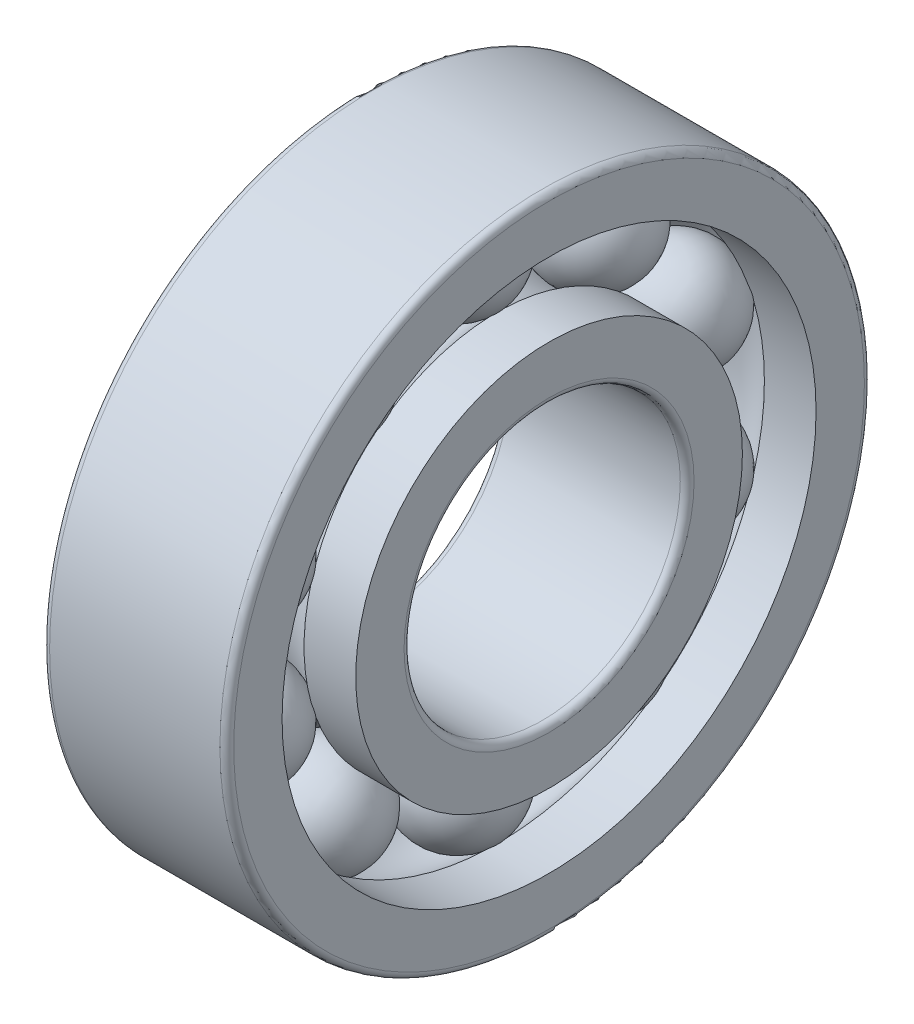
ISO-10303-21;
HEADER;
FILE_DESCRIPTION(('STEP AP214'),'2;1');
FILE_NAME('part.step','',(''),(''),'','','');
FILE_SCHEMA(('AUTOMOTIVE_DESIGN { 1 0 10303 214 1 1 1 1 }'));
ENDSEC;
DATA;
#1=APPLICATION_CONTEXT('core data for automotive mechanical design processes');
#2=APPLICATION_PROTOCOL_DEFINITION('international standard','automotive_design',2000,#1);
#3=PRODUCT_CONTEXT('',#1,'mechanical');
#4=PRODUCT('Part','Part','',(#3));
#5=PRODUCT_RELATED_PRODUCT_CATEGORY('part','',(#4));
#6=PRODUCT_DEFINITION_FORMATION('','',#4);
#7=PRODUCT_DEFINITION_CONTEXT('part definition',#1,'design');
#8=PRODUCT_DEFINITION('design','',#6,#7);
#9=PRODUCT_DEFINITION_SHAPE('','',#8);
#10=(LENGTH_UNIT() NAMED_UNIT(*) SI_UNIT(.MILLI.,.METRE.));
#11=(NAMED_UNIT(*) PLANE_ANGLE_UNIT() SI_UNIT($,.RADIAN.));
#12=(NAMED_UNIT(*) SI_UNIT($,.STERADIAN.) SOLID_ANGLE_UNIT());
#13=UNCERTAINTY_MEASURE_WITH_UNIT(LENGTH_MEASURE(1.E-05),#10,'distance_accuracy_value','');
#14=(GEOMETRIC_REPRESENTATION_CONTEXT(3) GLOBAL_UNCERTAINTY_ASSIGNED_CONTEXT((#13)) GLOBAL_UNIT_ASSIGNED_CONTEXT((#10,
#11,#12)) REPRESENTATION_CONTEXT('',''));
#15=CARTESIAN_POINT('',(0.,0.,0.));
#16=DIRECTION('',(0.,0.,1.));
#17=DIRECTION('',(1.,0.,0.));
#18=AXIS2_PLACEMENT_3D('',#15,#16,#17);
#19=CARTESIAN_POINT('',(0.,0.,0.));
#20=DIRECTION('',(1.,0.,0.));
#21=DIRECTION('',(0.,0.,-1.));
#22=AXIS2_PLACEMENT_3D('',#19,#20,#21);
#23=TOROIDAL_SURFACE('',#22,10.,2.375);
#24=CARTESIAN_POINT('',(1.75517093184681,0.,0.));
#25=DIRECTION('',(1.,0.,0.));
#26=DIRECTION('',(0.,0.,-1.));
#27=AXIS2_PLACEMENT_3D('',#24,#25,#26);
#28=CIRCLE('',#27,8.4);
#29=CARTESIAN_POINT('',(1.75517093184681,6.60481758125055,5.19002742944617));
#30=VERTEX_POINT('',#29);
#31=CARTESIAN_POINT('',(1.75517093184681,2.8950085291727,7.88536147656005));
#32=VERTEX_POINT('',#31);
#33=EDGE_CURVE('E481',#30,#32,#28,.T.);
#34=ORIENTED_EDGE('',*,*,#33,.F.);
#35=CARTESIAN_POINT('',(-1.75537093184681,6.60499266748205,5.19015975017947));
#36=CARTESIAN_POINT('',(-1.71036516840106,6.56558878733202,5.16038044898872));
#37=CARTESIAN_POINT('',(-1.66329614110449,6.52772182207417,5.13175747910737));
#38=CARTESIAN_POINT('',(-1.56533150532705,6.45528920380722,5.07699841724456));
#39=CARTESIAN_POINT('',(-1.51443607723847,6.42072339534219,5.05086220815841));
#40=CARTESIAN_POINT('',(-1.35663046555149,6.32242382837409,4.97652437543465));
#41=CARTESIAN_POINT('',(-1.24444760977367,6.26395394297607,4.93229227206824));
#42=CARTESIAN_POINT('',(-1.00936852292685,6.16287395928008,4.85581000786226));
#43=CARTESIAN_POINT('',(-0.886467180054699,6.12027147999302,4.82356560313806));
#44=CARTESIAN_POINT('',(-0.633439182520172,6.05212583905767,4.77198180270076));
#45=CARTESIAN_POINT('',(-0.503313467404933,6.02658046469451,4.75264073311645));
#46=CARTESIAN_POINT('',(-0.239542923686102,5.99327570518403,4.72742382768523));
#47=CARTESIAN_POINT('',(-0.105898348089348,5.98551504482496,4.72154702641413));
#48=CARTESIAN_POINT('',(0.161133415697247,5.98799129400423,4.72342208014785));
#49=CARTESIAN_POINT('',(0.294520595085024,5.99822880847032,4.73117439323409));
#50=CARTESIAN_POINT('',(0.557234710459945,6.03641414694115,4.76008594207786));
#51=CARTESIAN_POINT('',(0.686561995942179,6.06436044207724,4.78124402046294));
#52=CARTESIAN_POINT('',(0.937492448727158,6.13716752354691,4.8363537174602));
#53=CARTESIAN_POINT('',(1.05909564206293,6.18202825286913,4.87030529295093));
#54=CARTESIAN_POINT('',(1.28319554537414,6.28380460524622,4.94730923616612));
#55=CARTESIAN_POINT('',(1.38643054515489,6.33968331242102,4.9895783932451));
#56=CARTESIAN_POINT('',(1.53205365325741,6.43259712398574,5.05984036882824));
#57=CARTESIAN_POINT('',(1.57907631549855,6.46510171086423,5.08441718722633));
#58=CARTESIAN_POINT('',(1.66978671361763,6.53295810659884,5.13571546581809));
#59=CARTESIAN_POINT('',(1.71347414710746,6.56831017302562,5.16243712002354));
#60=CARTESIAN_POINT('',(1.75537093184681,6.60499266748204,5.19015975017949));
#61=B_SPLINE_CURVE_WITH_KNOTS('',3,(#35,#36,#37,#38,#39,#40,#41,#42,#43,#44,#45,#46,#47,#48,#49,
#50,#51,#52,#53,#54,#55,#56,#57,#58,#59,#60),.UNSPECIFIED.,.F.,.F.,(4,2,2,2,2,2,2,2,2,2,2,2,4),
(0.,0.200338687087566,0.400667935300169,0.800652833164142,1.20082954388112,1.60095433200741,
2.00105042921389,2.40115997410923,2.80123498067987,3.20130863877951,3.57396279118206,
3.76046464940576,3.94698339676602),.UNSPECIFIED.);
#62=CARTESIAN_POINT('',(-1.75517093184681,6.60481758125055,5.19002742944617));
#63=VERTEX_POINT('',#62);
#64=EDGE_CURVE('E301',#63,#30,#61,.T.);
#65=ORIENTED_EDGE('',*,*,#64,.F.);
#66=CARTESIAN_POINT('',(-1.75517093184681,0.,0.));
#67=DIRECTION('',(1.,0.,0.));
#68=DIRECTION('',(0.,0.,-1.));
#69=AXIS2_PLACEMENT_3D('',#66,#67,#68);
#70=CIRCLE('',#69,8.4);
#71=CARTESIAN_POINT('',(-1.75517093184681,2.8950085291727,7.88536147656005));
#72=VERTEX_POINT('',#71);
#73=EDGE_CURVE('E539',#63,#72,#70,.T.);
#74=ORIENTED_EDGE('',*,*,#73,.T.);
#75=CARTESIAN_POINT('',(1.75537093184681,2.89508026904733,7.88556888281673));
#76=CARTESIAN_POINT('',(1.71036516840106,2.87893493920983,7.83889125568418));
#77=CARTESIAN_POINT('',(1.66329614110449,2.86341441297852,7.79403264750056));
#78=CARTESIAN_POINT('',(1.56533150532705,2.83371836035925,7.70822365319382));
#79=CARTESIAN_POINT('',(1.51443607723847,2.81954277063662,7.66727308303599));
#80=CARTESIAN_POINT('',(1.35663046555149,2.77921952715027,7.55081298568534));
#81=CARTESIAN_POINT('',(1.24444760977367,2.75522048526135,7.48153634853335));
#82=CARTESIAN_POINT('',(1.00936852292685,2.71371696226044,7.36176925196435));
#83=CARTESIAN_POINT('',(0.886467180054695,2.69621560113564,7.31128781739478));
#84=CARTESIAN_POINT('',(0.633439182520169,2.66821465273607,7.23053719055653));
#85=CARTESIAN_POINT('',(0.50331346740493,2.65771415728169,7.20026537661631));
#86=CARTESIAN_POINT('',(0.239542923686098,2.64402319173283,7.16079821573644));
#87=CARTESIAN_POINT('',(0.105898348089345,2.64083219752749,7.15160135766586));
#88=CARTESIAN_POINT('',(-0.16113341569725,2.64185027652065,7.15453583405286));
#89=CARTESIAN_POINT('',(-0.294520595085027,2.64605959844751,7.16666788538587));
#90=CARTESIAN_POINT('',(-0.557234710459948,2.66175619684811,7.21191846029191));
#91=CARTESIAN_POINT('',(-0.686561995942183,2.67324284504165,7.2450351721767));
#92=CARTESIAN_POINT('',(-0.937492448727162,2.70315665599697,7.33130865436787));
#93=CARTESIAN_POINT('',(-1.05909564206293,2.72158379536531,7.38446535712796));
#94=CARTESIAN_POINT('',(-1.28319554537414,2.76336827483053,7.50505594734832));
#95=CARTESIAN_POINT('',(-1.38643054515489,2.78630116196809,7.57126164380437));
#96=CARTESIAN_POINT('',(-1.53205365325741,2.82441232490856,7.68134007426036));
#97=CARTESIAN_POINT('',(-1.57907631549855,2.83774179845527,7.71984842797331));
#98=CARTESIAN_POINT('',(-1.66978671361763,2.86556058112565,7.80023573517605));
#99=CARTESIAN_POINT('',(-1.71347414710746,2.88004999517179,7.84211499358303));
#100=CARTESIAN_POINT('',(-1.75537093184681,2.89508026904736,7.88556888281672));
#101=B_SPLINE_CURVE_WITH_KNOTS('',3,(#75,#76,#77,#78,#79,#80,#81,#82,#83,#84,#85,#86,#87,#88,
#89,#90,#91,#92,#93,#94,#95,#96,#97,#98,#99,#100),.UNSPECIFIED.,.F.,.F.,(4,2,2,2,2,2,2,2,2,2,2,
2,4),(0.,0.200338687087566,0.400667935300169,0.800652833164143,1.20082954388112,
1.60095433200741,2.00105042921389,2.40115997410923,2.80123498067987,3.20130863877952,
3.57396279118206,3.76046464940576,3.94698339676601),.UNSPECIFIED.);
#102=EDGE_CURVE('E484',#32,#72,#101,.T.);
#103=ORIENTED_EDGE('',*,*,#102,.F.);
#104=EDGE_LOOP('',(#34,#65,#74,#103));
#105=FACE_BOUND('',#104,.T.);
#106=ADVANCED_FACE('F32',(#105),#23,.F.);
#107=CARTESIAN_POINT('',(-1.75517093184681,8.39403125,0.316606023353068));
#108=VERTEX_POINT('',#107);
#109=CARTESIAN_POINT('',(-1.75517093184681,6.97701028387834,4.67774812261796));
#110=VERTEX_POINT('',#109);
#111=EDGE_CURVE('E319',#108,#110,#70,.T.);
#112=ORIENTED_EDGE('',*,*,#111,.T.);
#113=CARTESIAN_POINT('',(1.75537093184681,6.977190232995,4.67787375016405));
#114=CARTESIAN_POINT('',(1.71036516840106,6.93669196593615,4.64960074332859));
#115=CARTESIAN_POINT('',(1.66329614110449,6.89776836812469,4.62243210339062));
#116=CARTESIAN_POINT('',(1.56533150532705,6.82330649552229,4.57046607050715));
#117=CARTESIAN_POINT('',(1.51443607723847,6.78776806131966,4.54566856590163));
#118=CARTESIAN_POINT('',(1.35663046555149,6.68669234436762,4.47515177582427));
#119=CARTESIAN_POINT('',(1.24444760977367,6.62655692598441,4.43321208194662));
#120=CARTESIAN_POINT('',(1.00936852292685,6.5225825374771,4.36071362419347));
#121=CARTESIAN_POINT('',(0.886467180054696,6.47875139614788,4.33016032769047));
#122=CARTESIAN_POINT('',(0.633439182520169,6.40863412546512,4.28129024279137));
#123=CARTESIAN_POINT('',(0.50331346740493,6.38234572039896,4.26297186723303));
#124=CARTESIAN_POINT('',(0.239542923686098,6.34807128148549,4.23908961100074));
#125=CARTESIAN_POINT('',(0.105898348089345,6.34008393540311,4.23352481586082));
#126=CARTESIAN_POINT('',(-0.161133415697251,6.34263242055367,4.23530044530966));
#127=CARTESIAN_POINT('',(-0.294520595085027,6.35316887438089,4.24264130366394));
#128=CARTESIAN_POINT('',(-0.557234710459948,6.39246530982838,4.27002355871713));
#129=CARTESIAN_POINT('',(-0.686561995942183,6.42122371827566,4.2900638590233));
#130=CARTESIAN_POINT('',(-0.937492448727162,6.49613478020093,4.34227767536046));
#131=CARTESIAN_POINT('',(-1.05909564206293,6.5422873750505,4.37445115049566));
#132=CARTESIAN_POINT('',(-1.28319554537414,6.64697309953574,4.44745068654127));
#133=CARTESIAN_POINT('',(-1.38643054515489,6.70444092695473,4.48753260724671));
#134=CARTESIAN_POINT('',(-1.53205365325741,6.7999759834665,4.5541867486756));
#135=CARTESIAN_POINT('',(-1.57907631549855,6.8333943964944,4.57750579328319));
#136=CARTESIAN_POINT('',(-1.66978671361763,6.90315073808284,4.62618902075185));
#137=CARTESIAN_POINT('',(-1.71347414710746,6.93948893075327,4.65155338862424));
#138=CARTESIAN_POINT('',(-1.75537093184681,6.97719023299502,4.67787375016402));
#139=B_SPLINE_CURVE_WITH_KNOTS('',3,(#113,#114,#115,#116,#117,#118,#119,#120,#121,#122,#123,
#124,#125,#126,#127,#128,#129,#130,#131,#132,#133,#134,#135,#136,#137,#138),.UNSPECIFIED.,.F.,
.F.,(4,2,2,2,2,2,2,2,2,2,2,2,4),(0.,0.200338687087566,0.400667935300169,0.800652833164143,
1.20082954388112,1.60095433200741,2.00105042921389,2.40115997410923,2.80123498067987,
3.20130863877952,3.57396279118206,3.76046464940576,3.94698339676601),.UNSPECIFIED.);
#140=CARTESIAN_POINT('',(1.75517093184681,6.97701028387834,4.67774812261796));
#141=VERTEX_POINT('',#140);
#142=EDGE_CURVE('E52',#141,#110,#139,.T.);
#143=ORIENTED_EDGE('',*,*,#142,.F.);
#144=CARTESIAN_POINT('',(1.75517093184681,8.39403125,0.316606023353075));
#145=VERTEX_POINT('',#144);
#146=EDGE_CURVE('E430',#145,#141,#28,.T.);
#147=ORIENTED_EDGE('',*,*,#146,.F.);
#148=CARTESIAN_POINT('',(-1.75537093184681,8.39425067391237,0.31661015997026));
#149=CARTESIAN_POINT('',(-1.71036516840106,8.34486843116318,0.315679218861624));
#150=CARTESIAN_POINT('',(-1.66329614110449,8.29740925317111,0.314780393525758));
#151=CARTESIAN_POINT('',(-1.56533150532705,8.20662346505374,0.313054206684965));
#152=CARTESIAN_POINT('',(-1.51443607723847,8.16329666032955,0.312226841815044));
#153=CARTESIAN_POINT('',(-1.35663046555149,8.04007595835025,0.3098653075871));
#154=CARTESIAN_POINT('',(-1.24444760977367,7.96677384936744,0.308448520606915));
#155=CARTESIAN_POINT('',(-1.00936852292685,7.84004327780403,0.305986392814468));
#156=CARTESIAN_POINT('',(-0.886467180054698,7.78662436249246,0.304941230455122));
#157=CARTESIAN_POINT('',(-0.633439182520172,7.70117318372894,0.303264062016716));
#158=CARTESIAN_POINT('',(-0.503313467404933,7.66913814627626,0.302632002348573));
#159=CARTESIAN_POINT('',(-0.239542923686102,7.62737190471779,0.301807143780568));
#160=CARTESIAN_POINT('',(-0.105898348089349,7.61763910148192,0.301614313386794));
#161=CARTESIAN_POINT('',(0.161133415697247,7.62074455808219,0.301675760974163));
#162=CARTESIAN_POINT('',(0.294520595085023,7.63358357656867,0.301930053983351));
#163=CARTESIAN_POINT('',(0.557234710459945,7.68146994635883,0.302875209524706));
#164=CARTESIAN_POINT('',(0.68656199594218,7.71651538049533,0.303566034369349));
#165=CARTESIAN_POINT('',(0.937492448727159,7.80781021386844,0.305355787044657));
#166=CARTESIAN_POINT('',(1.05909564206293,7.86405954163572,0.306454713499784));
#167=CARTESIAN_POINT('',(1.28319554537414,7.99166012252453,0.308929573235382));
#168=CARTESIAN_POINT('',(1.38643054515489,8.06171213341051,0.310281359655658));
#169=CARTESIAN_POINT('',(1.53205365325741,8.17817993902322,0.312511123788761));
#170=CARTESIAN_POINT('',(1.57907631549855,8.21892259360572,0.313288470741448));
#171=CARTESIAN_POINT('',(1.66978671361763,8.30397194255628,0.314904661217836));
#172=CARTESIAN_POINT('',(1.71347414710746,8.34827895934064,0.315743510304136));
#173=CARTESIAN_POINT('',(1.75537093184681,8.39425067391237,0.316610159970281));
#174=B_SPLINE_CURVE_WITH_KNOTS('',3,(#148,#149,#150,#151,#152,#153,#154,#155,#156,#157,#158,
#159,#160,#161,#162,#163,#164,#165,#166,#167,#168,#169,#170,#171,#172,#173),.UNSPECIFIED.,.F.,
.F.,(4,2,2,2,2,2,2,2,2,2,2,2,4),(0.,0.200338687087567,0.400667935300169,0.800652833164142,
1.20082954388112,1.6009543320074,2.00105042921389,2.40115997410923,2.80123498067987,
3.20130863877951,3.57396279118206,3.76046464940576,3.94698339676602),.UNSPECIFIED.);
#175=EDGE_CURVE('E429',#108,#145,#174,.T.);
#176=ORIENTED_EDGE('',*,*,#175,.F.);
#177=EDGE_LOOP('',(#112,#143,#147,#176));
#178=FACE_BOUND('',#177,.T.);
#179=ADVANCED_FACE('F450',(#178),#23,.F.);
#180=CARTESIAN_POINT('',(-20.6375,0.,0.));
#181=DIRECTION('',(1.,0.,0.));
#182=DIRECTION('',(0.,0.,-1.));
#183=AXIS2_PLACEMENT_3D('',#180,#181,#182);
#184=CYLINDRICAL_SURFACE('',#183,8.4);
#185=CARTESIAN_POINT('',(4.,0.,0.));
#186=DIRECTION('',(1.,0.,0.));
#187=DIRECTION('',(0.,0.,-1.));
#188=AXIS2_PLACEMENT_3D('',#185,#186,#187);
#189=CIRCLE('',#188,8.4);
#190=CARTESIAN_POINT('',(4.,0.,-8.4));
#191=VERTEX_POINT('',#190);
#192=EDGE_CURVE('E519',#191,#191,#189,.T.);
#193=ORIENTED_EDGE('',*,*,#192,.F.);
#194=EDGE_LOOP('',(#193));
#195=FACE_BOUND('',#194,.T.);
#196=ORIENTED_EDGE('',*,*,#146,.T.);
#197=CARTESIAN_POINT('',(1.75497093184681,6.60424297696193,5.19075858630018));
#198=CARTESIAN_POINT('',(1.76384428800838,6.62970308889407,5.15836673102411));
#199=CARTESIAN_POINT('',(1.77099935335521,6.65513892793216,5.12551142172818));
#200=CARTESIAN_POINT('',(1.781813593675,6.70579396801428,5.05905887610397));
#201=CARTESIAN_POINT('',(1.78547221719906,6.7310131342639,5.02546152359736));
#202=CARTESIAN_POINT('',(1.79104031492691,6.80513986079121,4.92512391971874));
#203=CARTESIAN_POINT('',(1.78787795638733,6.85348740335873,4.85760449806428));
#204=CARTESIAN_POINT('',(1.77241115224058,6.92658213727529,4.75233142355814));
#205=CARTESIAN_POINT('',(1.76474118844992,6.95235382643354,4.71455192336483));
#206=CARTESIAN_POINT('',(1.75497093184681,6.97752809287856,4.67697570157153));
#207=B_SPLINE_CURVE_WITH_KNOTS('',3,(#197,#198,#199,#200,#201,#202,#203,#204,#205,#206),
.UNSPECIFIED.,.F.,.F.,(4,2,2,2,4),(0.,0.126355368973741,0.252730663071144,0.50072643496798,
0.639609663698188),.UNSPECIFIED.);
#208=EDGE_CURVE('E1339',#30,#141,#207,.T.);
#209=ORIENTED_EDGE('',*,*,#208,.F.);
#210=ORIENTED_EDGE('',*,*,#33,.T.);
#211=CARTESIAN_POINT('',(1.75497093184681,2.2918934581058,8.08128853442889));
#212=CARTESIAN_POINT('',(1.76384428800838,2.33153057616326,8.07004805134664));
#213=CARTESIAN_POINT('',(1.77099935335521,2.37142046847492,8.05841835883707));
#214=CARTESIAN_POINT('',(1.781813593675,2.4514610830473,8.03443140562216));
#215=CARTESIAN_POINT('',(1.78547221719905,2.49161184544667,8.02207403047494));
#216=CARTESIAN_POINT('',(1.79104031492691,2.61055859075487,7.98446980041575));
#217=CARTESIAN_POINT('',(1.78787795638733,2.68935949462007,7.9582634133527));
#218=CARTESIAN_POINT('',(1.77241115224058,2.81037233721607,7.91605971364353));
#219=CARTESIAN_POINT('',(1.76474118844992,2.85342830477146,7.90064367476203));
#220=CARTESIAN_POINT('',(1.75497093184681,2.89588146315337,7.88504093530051));
#221=B_SPLINE_CURVE_WITH_KNOTS('',3,(#211,#212,#213,#214,#215,#216,#217,#218,#219,#220),
.UNSPECIFIED.,.F.,.F.,(4,2,2,2,4),(0.,0.126355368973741,0.252730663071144,0.500726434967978,
0.639609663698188),.UNSPECIFIED.);
#222=CARTESIAN_POINT('',(1.75517093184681,2.29278808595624,8.0810347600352));
#223=VERTEX_POINT('',#222);
#224=EDGE_CURVE('E676',#223,#32,#221,.T.);
#225=ORIENTED_EDGE('',*,*,#224,.F.);
#226=CARTESIAN_POINT('',(1.75517093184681,-2.29278808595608,8.08103476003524));
#227=VERTEX_POINT('',#226);
#228=EDGE_CURVE('E489',#223,#227,#28,.T.);
#229=ORIENTED_EDGE('',*,*,#228,.T.);
#230=CARTESIAN_POINT('',(1.75497093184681,-2.89588146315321,7.88504093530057));
#231=CARTESIAN_POINT('',(1.76384428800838,-2.85720737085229,7.89924530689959));
#232=CARTESIAN_POINT('',(1.77099935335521,-2.81810000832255,7.91328337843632));
#233=CARTESIAN_POINT('',(1.781813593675,-2.73924661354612,7.94092421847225));
#234=CARTESIAN_POINT('',(1.78547221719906,-2.69950048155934,7.95452691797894));
#235=CARTESIAN_POINT('',(1.79104031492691,-2.58116733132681,7.99401959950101));
#236=CARTESIAN_POINT('',(1.78787795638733,-2.50201233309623,8.01913619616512));
#237=CARTESIAN_POINT('',(1.77241115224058,-2.37930417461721,8.05612225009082));
#238=CARTESIAN_POINT('',(1.76474118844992,-2.33540984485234,8.06895807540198));
#239=CARTESIAN_POINT('',(1.75497093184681,-2.29189345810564,8.08128853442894));
#240=B_SPLINE_CURVE_WITH_KNOTS('',3,(#230,#231,#232,#233,#234,#235,#236,#237,#238,#239),
.UNSPECIFIED.,.F.,.F.,(4,2,2,2,4),(0.,0.126355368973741,0.252730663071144,0.500726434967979,
0.639609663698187),.UNSPECIFIED.);
#241=CARTESIAN_POINT('',(1.75517093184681,-2.89500852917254,7.88536147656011));
#242=VERTEX_POINT('',#241);
#243=EDGE_CURVE('E772',#242,#227,#240,.T.);
#244=ORIENTED_EDGE('',*,*,#243,.F.);
#245=CARTESIAN_POINT('',(1.75517093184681,-6.60481758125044,5.19002742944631));
#246=VERTEX_POINT('',#245);
#247=EDGE_CURVE('E492',#242,#246,#28,.T.);
#248=ORIENTED_EDGE('',*,*,#247,.T.);
#249=CARTESIAN_POINT('',(1.75497093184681,-6.97752809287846,4.67697570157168));
#250=CARTESIAN_POINT('',(1.76384428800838,-6.95458921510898,4.71119934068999));
#251=CARTESIAN_POINT('',(1.77099935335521,-6.93120206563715,4.74554311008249));
#252=CARTESIAN_POINT('',(1.781813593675,-6.88365520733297,4.81425388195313));
#253=CARTESIAN_POINT('',(1.78547221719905,-6.85949537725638,4.84862088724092));
#254=CARTESIAN_POINT('',(1.79104031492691,-6.7869750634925,4.9501256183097));
#255=CARTESIAN_POINT('',(1.78787795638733,-6.73770048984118,5.016971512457));
#256=CARTESIAN_POINT('',(1.77241115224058,-6.66016736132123,5.1190199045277));
#257=CARTESIAN_POINT('',(1.76474118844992,-6.63220081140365,5.15520474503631));
#258=CARTESIAN_POINT('',(1.75497093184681,-6.60424297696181,5.19075858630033));
#259=B_SPLINE_CURVE_WITH_KNOTS('',3,(#249,#250,#251,#252,#253,#254,#255,#256,#257,#258),
.UNSPECIFIED.,.F.,.F.,(4,2,2,2,4),(0.,0.126355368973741,0.252730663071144,0.500726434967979,
0.639609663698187),.UNSPECIFIED.);
#260=CARTESIAN_POINT('',(1.75517093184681,-6.97701028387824,4.6777481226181));
#261=VERTEX_POINT('',#260);
#262=EDGE_CURVE('E829',#261,#246,#259,.T.);
#263=ORIENTED_EDGE('',*,*,#262,.F.);
#264=CARTESIAN_POINT('',(1.75517093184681,-8.39403125,0.316606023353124));
#265=VERTEX_POINT('',#264);
#266=EDGE_CURVE('E496',#261,#265,#28,.T.);
#267=ORIENTED_EDGE('',*,*,#266,.T.);
#268=CARTESIAN_POINT('',(1.75497093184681,-8.39399614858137,-0.317535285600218));
#269=CARTESIAN_POINT('',(1.76384428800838,-8.39555435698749,-0.276364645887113));
#270=CARTESIAN_POINT('',(1.77099935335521,-8.39682051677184,-0.234833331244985));
#271=CARTESIAN_POINT('',(1.781813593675,-8.39874147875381,-0.151297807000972));
#272=CARTESIAN_POINT('',(1.78547221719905,-8.39939618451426,-0.109293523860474));
#273=CARTESIAN_POINT('',(1.79104031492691,-8.40038900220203,0.0154518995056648));
#274=CARTESIAN_POINT('',(1.78787795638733,-8.39981606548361,0.0984942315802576));
#275=CARTESIAN_POINT('',(1.77241115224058,-8.39707298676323,0.226625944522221));
#276=CARTESIAN_POINT('',(1.76474118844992,-8.39571648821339,0.27233842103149));
#277=CARTESIAN_POINT('',(1.75497093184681,-8.39399614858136,0.317535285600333));
#278=B_SPLINE_CURVE_WITH_KNOTS('',3,(#268,#269,#270,#271,#272,#273,#274,#275,#276,#277),
.UNSPECIFIED.,.F.,.F.,(4,2,2,2,4),(0.,0.126355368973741,0.252730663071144,0.500726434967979,
0.639609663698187),.UNSPECIFIED.);
#279=CARTESIAN_POINT('',(1.75517093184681,-8.39403125,-0.316606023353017));
#280=VERTEX_POINT('',#279);
#281=EDGE_CURVE('E886',#280,#265,#278,.T.);
#282=ORIENTED_EDGE('',*,*,#281,.F.);
#283=CARTESIAN_POINT('',(1.75517093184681,-6.97701028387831,-4.67774812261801));
#284=VERTEX_POINT('',#283);
#285=EDGE_CURVE('E500',#280,#284,#28,.T.);
#286=ORIENTED_EDGE('',*,*,#285,.T.);
#287=CARTESIAN_POINT('',(1.75497093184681,-6.60424297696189,-5.19075858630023));
#288=CARTESIAN_POINT('',(1.76384428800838,-6.62970308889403,-5.15836673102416));
#289=CARTESIAN_POINT('',(1.77099935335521,-6.65513892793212,-5.12551142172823));
#290=CARTESIAN_POINT('',(1.781813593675,-6.70579396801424,-5.05905887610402));
#291=CARTESIAN_POINT('',(1.78547221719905,-6.73101313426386,-5.02546152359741));
#292=CARTESIAN_POINT('',(1.79104031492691,-6.80513986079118,-4.92512391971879));
#293=CARTESIAN_POINT('',(1.78787795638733,-6.8534874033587,-4.85760449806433));
#294=CARTESIAN_POINT('',(1.77241115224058,-6.92658213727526,-4.75233142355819));
#295=CARTESIAN_POINT('',(1.76474118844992,-6.95235382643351,-4.71455192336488));
#296=CARTESIAN_POINT('',(1.75497093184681,-6.97752809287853,-4.67697570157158));
#297=B_SPLINE_CURVE_WITH_KNOTS('',3,(#287,#288,#289,#290,#291,#292,#293,#294,#295,#296),
.UNSPECIFIED.,.F.,.F.,(4,2,2,2,4),(0.,0.126355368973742,0.252730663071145,0.500726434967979,
0.639609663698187),.UNSPECIFIED.);
#298=CARTESIAN_POINT('',(1.75517093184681,-6.60481758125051,-5.19002742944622));
#299=VERTEX_POINT('',#298);
#300=EDGE_CURVE('E943',#299,#284,#297,.T.);
#301=ORIENTED_EDGE('',*,*,#300,.F.);
#302=CARTESIAN_POINT('',(1.75517093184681,-2.89500852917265,-7.88536147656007));
#303=VERTEX_POINT('',#302);
#304=EDGE_CURVE('E504',#299,#303,#28,.T.);
#305=ORIENTED_EDGE('',*,*,#304,.T.);
#306=CARTESIAN_POINT('',(1.75497093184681,-2.29189345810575,-8.08128853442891));
#307=CARTESIAN_POINT('',(1.76384428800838,-2.33153057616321,-8.07004805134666));
#308=CARTESIAN_POINT('',(1.77099935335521,-2.37142046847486,-8.05841835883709));
#309=CARTESIAN_POINT('',(1.781813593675,-2.45146108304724,-8.03443140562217));
#310=CARTESIAN_POINT('',(1.78547221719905,-2.49161184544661,-8.02207403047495));
#311=CARTESIAN_POINT('',(1.79104031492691,-2.61055859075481,-7.98446980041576));
#312=CARTESIAN_POINT('',(1.78787795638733,-2.68935949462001,-7.95826341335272));
#313=CARTESIAN_POINT('',(1.77241115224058,-2.81037233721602,-7.91605971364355));
#314=CARTESIAN_POINT('',(1.76474118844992,-2.8534283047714,-7.90064367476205));
#315=CARTESIAN_POINT('',(1.75497093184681,-2.89588146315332,-7.88504093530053));
#316=B_SPLINE_CURVE_WITH_KNOTS('',3,(#306,#307,#308,#309,#310,#311,#312,#313,#314,#315),
.UNSPECIFIED.,.F.,.F.,(4,2,2,2,4),(0.,0.126355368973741,0.252730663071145,0.500726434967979,
0.639609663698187),.UNSPECIFIED.);
#317=CARTESIAN_POINT('',(1.75517093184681,-2.29278808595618,-8.08103476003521));
#318=VERTEX_POINT('',#317);
#319=EDGE_CURVE('E1000',#318,#303,#316,.T.);
#320=ORIENTED_EDGE('',*,*,#319,.F.);
#321=CARTESIAN_POINT('',(1.75517093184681,2.29278808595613,-8.08103476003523));
#322=VERTEX_POINT('',#321);
#323=EDGE_CURVE('E508',#318,#322,#28,.T.);
#324=ORIENTED_EDGE('',*,*,#323,.T.);
#325=CARTESIAN_POINT('',(1.75497093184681,2.89588146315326,-7.88504093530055));
#326=CARTESIAN_POINT('',(1.76384428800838,2.85720737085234,-7.89924530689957));
#327=CARTESIAN_POINT('',(1.77099935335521,2.8181000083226,-7.9132833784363));
#328=CARTESIAN_POINT('',(1.781813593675,2.73924661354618,-7.94092421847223));
#329=CARTESIAN_POINT('',(1.78547221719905,2.6995004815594,-7.95452691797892));
#330=CARTESIAN_POINT('',(1.79104031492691,2.58116733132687,-7.994019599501));
#331=CARTESIAN_POINT('',(1.78787795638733,2.50201233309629,-8.0191361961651));
#332=CARTESIAN_POINT('',(1.77241115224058,2.37930417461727,-8.05612225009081));
#333=CARTESIAN_POINT('',(1.76474118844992,2.33540984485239,-8.06895807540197));
#334=CARTESIAN_POINT('',(1.75497093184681,2.29189345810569,-8.08128853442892));
#335=B_SPLINE_CURVE_WITH_KNOTS('',3,(#325,#326,#327,#328,#329,#330,#331,#332,#333,#334),
.UNSPECIFIED.,.F.,.F.,(4,2,2,2,4),(0.,0.12635536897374,0.252730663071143,0.500726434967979,
0.639609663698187),.UNSPECIFIED.);
#336=CARTESIAN_POINT('',(1.75517093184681,2.8950085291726,-7.88536147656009));
#337=VERTEX_POINT('',#336);
#338=EDGE_CURVE('E1056',#337,#322,#335,.T.);
#339=ORIENTED_EDGE('',*,*,#338,.F.);
#340=CARTESIAN_POINT('',(1.75517093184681,6.60481758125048,-5.19002742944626));
#341=VERTEX_POINT('',#340);
#342=EDGE_CURVE('E512',#337,#341,#28,.T.);
#343=ORIENTED_EDGE('',*,*,#342,.T.);
#344=CARTESIAN_POINT('',(1.75497093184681,6.9775280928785,-4.67697570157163));
#345=CARTESIAN_POINT('',(1.76384428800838,6.95458921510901,-4.71119934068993));
#346=CARTESIAN_POINT('',(1.77099935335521,6.93120206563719,-4.74554311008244));
#347=CARTESIAN_POINT('',(1.781813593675,6.883655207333,-4.81425388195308));
#348=CARTESIAN_POINT('',(1.78547221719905,6.85949537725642,-4.84862088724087));
#349=CARTESIAN_POINT('',(1.79104031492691,6.78697506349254,-4.95012561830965));
#350=CARTESIAN_POINT('',(1.78787795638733,6.73770048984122,-5.01697151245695));
#351=CARTESIAN_POINT('',(1.77241115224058,6.66016736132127,-5.11901990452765));
#352=CARTESIAN_POINT('',(1.76474118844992,6.63220081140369,-5.15520474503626));
#353=CARTESIAN_POINT('',(1.75497093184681,6.60424297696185,-5.19075858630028));
#354=B_SPLINE_CURVE_WITH_KNOTS('',3,(#344,#345,#346,#347,#348,#349,#350,#351,#352,#353),
.UNSPECIFIED.,.F.,.F.,(4,2,2,2,4),(0.,0.126355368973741,0.252730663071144,0.500726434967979,
0.639609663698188),.UNSPECIFIED.);
#355=CARTESIAN_POINT('',(1.75517093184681,6.97701028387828,-4.67774812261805));
#356=VERTEX_POINT('',#355);
#357=EDGE_CURVE('E588',#356,#341,#354,.T.);
#358=ORIENTED_EDGE('',*,*,#357,.F.);
#359=CARTESIAN_POINT('',(1.75517093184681,8.39403125,-0.316606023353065));
#360=VERTEX_POINT('',#359);
#361=EDGE_CURVE('E491',#356,#360,#28,.T.);
#362=ORIENTED_EDGE('',*,*,#361,.T.);
#363=CARTESIAN_POINT('',(1.75497093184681,8.39399614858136,0.317535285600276));
#364=CARTESIAN_POINT('',(1.76384428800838,8.39555435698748,0.276364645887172));
#365=CARTESIAN_POINT('',(1.77099935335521,8.39682051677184,0.234833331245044));
#366=CARTESIAN_POINT('',(1.781813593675,8.39874147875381,0.15129780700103));
#367=CARTESIAN_POINT('',(1.78547221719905,8.39939618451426,0.109293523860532));
#368=CARTESIAN_POINT('',(1.79104031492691,8.40038900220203,-0.0154518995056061));
#369=CARTESIAN_POINT('',(1.78787795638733,8.39981606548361,-0.0984942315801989));
#370=CARTESIAN_POINT('',(1.77241115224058,8.39707298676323,-0.226625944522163));
#371=CARTESIAN_POINT('',(1.76474118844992,8.39571648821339,-0.272338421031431));
#372=CARTESIAN_POINT('',(1.75497093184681,8.39399614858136,-0.317535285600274));
#373=B_SPLINE_CURVE_WITH_KNOTS('',3,(#363,#364,#365,#366,#367,#368,#369,#370,#371,#372),
.UNSPECIFIED.,.F.,.F.,(4,2,2,2,4),(0.,0.126355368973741,0.252730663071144,0.500726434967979,
0.639609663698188),.UNSPECIFIED.);
#374=EDGE_CURVE('E391',#145,#360,#373,.T.);
#375=ORIENTED_EDGE('',*,*,#374,.F.);
#376=EDGE_LOOP('',(#196,#209,#210,#225,#229,#244,#248,#263,#267,#282,#286,#301,#305,#320,#324,
#339,#343,#358,#362,#375));
#377=FACE_BOUND('',#376,.T.);
#378=ADVANCED_FACE('F417',(#195,#377),#184,.T.);
#379=CARTESIAN_POINT('',(-20.6375,0.,0.));
#380=DIRECTION('',(1.,0.,0.));
#381=DIRECTION('',(0.,0.,-1.));
#382=AXIS2_PLACEMENT_3D('',#379,#380,#381);
#383=CYLINDRICAL_SURFACE('',#382,8.4);
#384=CARTESIAN_POINT('',(-4.,0.,0.));
#385=DIRECTION('',(1.,0.,0.));
#386=DIRECTION('',(0.,0.,-1.));
#387=AXIS2_PLACEMENT_3D('',#384,#385,#386);
#388=CIRCLE('',#387,8.4);
#389=CARTESIAN_POINT('',(-4.,0.,-8.4));
#390=VERTEX_POINT('',#389);
#391=EDGE_CURVE('E536',#390,#390,#388,.T.);
#392=ORIENTED_EDGE('',*,*,#391,.T.);
#393=EDGE_LOOP('',(#392));
#394=FACE_BOUND('',#393,.T.);
#395=ORIENTED_EDGE('',*,*,#73,.F.);
#396=CARTESIAN_POINT('',(-1.75497093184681,6.97752809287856,4.67697570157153));
#397=CARTESIAN_POINT('',(-1.76384428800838,6.95458921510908,4.71119934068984));
#398=CARTESIAN_POINT('',(-1.77099935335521,6.93120206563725,4.74554311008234));
#399=CARTESIAN_POINT('',(-1.781813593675,6.88365520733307,4.81425388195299));
#400=CARTESIAN_POINT('',(-1.78547221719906,6.85949537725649,4.84862088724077));
#401=CARTESIAN_POINT('',(-1.79104031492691,6.78697506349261,4.95012561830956));
#402=CARTESIAN_POINT('',(-1.78787795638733,6.73770048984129,5.01697151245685));
#403=CARTESIAN_POINT('',(-1.77241115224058,6.66016736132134,5.11901990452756));
#404=CARTESIAN_POINT('',(-1.76474118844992,6.63220081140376,5.15520474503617));
#405=CARTESIAN_POINT('',(-1.75497093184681,6.60424297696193,5.19075858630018));
#406=B_SPLINE_CURVE_WITH_KNOTS('',3,(#396,#397,#398,#399,#400,#401,#402,#403,#404,#405),
.UNSPECIFIED.,.F.,.F.,(4,2,2,2,4),(0.,0.126355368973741,0.252730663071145,0.500726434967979,
0.639609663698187),.UNSPECIFIED.);
#407=EDGE_CURVE('E679',#110,#63,#406,.T.);
#408=ORIENTED_EDGE('',*,*,#407,.F.);
#409=ORIENTED_EDGE('',*,*,#111,.F.);
#410=CARTESIAN_POINT('',(-1.75497093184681,8.39399614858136,-0.317535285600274));
#411=CARTESIAN_POINT('',(-1.76384428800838,8.39555435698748,-0.276364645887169));
#412=CARTESIAN_POINT('',(-1.77099935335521,8.39682051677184,-0.234833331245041));
#413=CARTESIAN_POINT('',(-1.781813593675,8.39874147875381,-0.151297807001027));
#414=CARTESIAN_POINT('',(-1.78547221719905,8.39939618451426,-0.10929352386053));
#415=CARTESIAN_POINT('',(-1.79104031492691,8.40038900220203,0.0154518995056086));
#416=CARTESIAN_POINT('',(-1.78787795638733,8.39981606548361,0.0984942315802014));
#417=CARTESIAN_POINT('',(-1.77241115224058,8.39707298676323,0.226625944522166));
#418=CARTESIAN_POINT('',(-1.76474118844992,8.39571648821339,0.272338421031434));
#419=CARTESIAN_POINT('',(-1.75497093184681,8.39399614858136,0.317535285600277));
#420=B_SPLINE_CURVE_WITH_KNOTS('',3,(#410,#411,#412,#413,#414,#415,#416,#417,#418,#419),
.UNSPECIFIED.,.F.,.F.,(4,2,2,2,4),(0.,0.126355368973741,0.252730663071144,0.500726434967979,
0.639609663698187),.UNSPECIFIED.);
#421=CARTESIAN_POINT('',(-1.75517093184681,8.39403125,-0.316606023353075));
#422=VERTEX_POINT('',#421);
#423=EDGE_CURVE('E422',#422,#108,#420,.T.);
#424=ORIENTED_EDGE('',*,*,#423,.F.);
#425=CARTESIAN_POINT('',(-1.75517093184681,6.97701028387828,-4.67774812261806));
#426=VERTEX_POINT('',#425);
#427=EDGE_CURVE('E314',#426,#422,#70,.T.);
#428=ORIENTED_EDGE('',*,*,#427,.F.);
#429=CARTESIAN_POINT('',(-1.75497093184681,6.60424297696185,-5.19075858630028));
#430=CARTESIAN_POINT('',(-1.76384428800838,6.62970308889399,-5.1583667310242));
#431=CARTESIAN_POINT('',(-1.77099935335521,6.65513892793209,-5.12551142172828));
#432=CARTESIAN_POINT('',(-1.781813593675,6.7057939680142,-5.05905887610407));
#433=CARTESIAN_POINT('',(-1.78547221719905,6.73101313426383,-5.02546152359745));
#434=CARTESIAN_POINT('',(-1.79104031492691,6.80513986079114,-4.92512391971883));
#435=CARTESIAN_POINT('',(-1.78787795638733,6.85348740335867,-4.85760449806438));
#436=CARTESIAN_POINT('',(-1.77241115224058,6.92658213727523,-4.75233142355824));
#437=CARTESIAN_POINT('',(-1.76474118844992,6.95235382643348,-4.71455192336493));
#438=CARTESIAN_POINT('',(-1.75497093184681,6.9775280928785,-4.67697570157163));
#439=B_SPLINE_CURVE_WITH_KNOTS('',3,(#429,#430,#431,#432,#433,#434,#435,#436,#437,#438),
.UNSPECIFIED.,.F.,.F.,(4,2,2,2,4),(0.,0.12635536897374,0.252730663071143,0.500726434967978,
0.639609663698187),.UNSPECIFIED.);
#440=CARTESIAN_POINT('',(-1.75517093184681,6.60481758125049,-5.19002742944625));
#441=VERTEX_POINT('',#440);
#442=EDGE_CURVE('E352',#441,#426,#439,.T.);
#443=ORIENTED_EDGE('',*,*,#442,.F.);
#444=CARTESIAN_POINT('',(-1.75517093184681,2.89500852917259,-7.8853614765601));
#445=VERTEX_POINT('',#444);
#446=EDGE_CURVE('E317',#445,#441,#70,.T.);
#447=ORIENTED_EDGE('',*,*,#446,.F.);
#448=CARTESIAN_POINT('',(-1.75497093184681,2.29189345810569,-8.08128853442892));
#449=CARTESIAN_POINT('',(-1.76384428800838,2.33153057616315,-8.07004805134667));
#450=CARTESIAN_POINT('',(-1.77099935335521,2.37142046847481,-8.0584183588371));
#451=CARTESIAN_POINT('',(-1.781813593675,2.45146108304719,-8.03443140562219));
#452=CARTESIAN_POINT('',(-1.78547221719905,2.49161184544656,-8.02207403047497));
#453=CARTESIAN_POINT('',(-1.79104031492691,2.61055859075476,-7.98446980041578));
#454=CARTESIAN_POINT('',(-1.78787795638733,2.68935949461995,-7.95826341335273));
#455=CARTESIAN_POINT('',(-1.77241115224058,2.81037233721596,-7.91605971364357));
#456=CARTESIAN_POINT('',(-1.76474118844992,2.85342830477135,-7.90064367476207));
#457=CARTESIAN_POINT('',(-1.75497093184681,2.89588146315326,-7.88504093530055));
#458=B_SPLINE_CURVE_WITH_KNOTS('',3,(#448,#449,#450,#451,#452,#453,#454,#455,#456,#457),
.UNSPECIFIED.,.F.,.F.,(4,2,2,2,4),(0.,0.12635536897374,0.252730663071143,0.500726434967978,
0.639609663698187),.UNSPECIFIED.);
#459=CARTESIAN_POINT('',(-1.75517093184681,2.29278808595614,-8.08103476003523));
#460=VERTEX_POINT('',#459);
#461=EDGE_CURVE('E600',#460,#445,#458,.T.);
#462=ORIENTED_EDGE('',*,*,#461,.F.);
#463=CARTESIAN_POINT('',(-1.75517093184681,-2.29278808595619,-8.08103476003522));
#464=VERTEX_POINT('',#463);
#465=EDGE_CURVE('E566',#464,#460,#70,.T.);
#466=ORIENTED_EDGE('',*,*,#465,.F.);
#467=CARTESIAN_POINT('',(-1.75497093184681,-2.89588146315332,-7.88504093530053));
#468=CARTESIAN_POINT('',(-1.76384428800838,-2.8572073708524,-7.89924530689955));
#469=CARTESIAN_POINT('',(-1.77099935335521,-2.81810000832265,-7.91328337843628));
#470=CARTESIAN_POINT('',(-1.781813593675,-2.73924661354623,-7.94092421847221));
#471=CARTESIAN_POINT('',(-1.78547221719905,-2.69950048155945,-7.9545269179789));
#472=CARTESIAN_POINT('',(-1.79104031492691,-2.58116733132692,-7.99401959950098));
#473=CARTESIAN_POINT('',(-1.78787795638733,-2.50201233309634,-8.01913619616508));
#474=CARTESIAN_POINT('',(-1.77241115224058,-2.37930417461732,-8.05612225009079));
#475=CARTESIAN_POINT('',(-1.76474118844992,-2.33540984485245,-8.06895807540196));
#476=CARTESIAN_POINT('',(-1.75497093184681,-2.29189345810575,-8.08128853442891));
#477=B_SPLINE_CURVE_WITH_KNOTS('',3,(#467,#468,#469,#470,#471,#472,#473,#474,#475,#476),
.UNSPECIFIED.,.F.,.F.,(4,2,2,2,4),(0.,0.126355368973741,0.252730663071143,0.500726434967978,
0.639609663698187),.UNSPECIFIED.);
#478=CARTESIAN_POINT('',(-1.75517093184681,-2.89500852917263,-7.88536147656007));
#479=VERTEX_POINT('',#478);
#480=EDGE_CURVE('E1016',#479,#464,#477,.T.);
#481=ORIENTED_EDGE('',*,*,#480,.F.);
#482=CARTESIAN_POINT('',(-1.75517093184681,-6.60481758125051,-5.19002742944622));
#483=VERTEX_POINT('',#482);
#484=EDGE_CURVE('E560',#483,#479,#70,.T.);
#485=ORIENTED_EDGE('',*,*,#484,.F.);
#486=CARTESIAN_POINT('',(-1.75497093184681,-6.97752809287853,-4.67697570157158));
#487=CARTESIAN_POINT('',(-1.76384428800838,-6.95458921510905,-4.71119934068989));
#488=CARTESIAN_POINT('',(-1.77099935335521,-6.93120206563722,-4.74554311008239));
#489=CARTESIAN_POINT('',(-1.781813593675,-6.88365520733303,-4.81425388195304));
#490=CARTESIAN_POINT('',(-1.78547221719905,-6.85949537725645,-4.84862088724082));
#491=CARTESIAN_POINT('',(-1.79104031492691,-6.78697506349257,-4.95012561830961));
#492=CARTESIAN_POINT('',(-1.78787795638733,-6.73770048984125,-5.0169715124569));
#493=CARTESIAN_POINT('',(-1.77241115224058,-6.6601673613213,-5.11901990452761));
#494=CARTESIAN_POINT('',(-1.76474118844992,-6.63220081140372,-5.15520474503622));
#495=CARTESIAN_POINT('',(-1.75497093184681,-6.60424297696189,-5.19075858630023));
#496=B_SPLINE_CURVE_WITH_KNOTS('',3,(#486,#487,#488,#489,#490,#491,#492,#493,#494,#495),
.UNSPECIFIED.,.F.,.F.,(4,2,2,2,4),(0.,0.12635536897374,0.252730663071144,0.500726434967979,
0.639609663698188),.UNSPECIFIED.);
#497=CARTESIAN_POINT('',(-1.75517093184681,-6.9770102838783,-4.67774812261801));
#498=VERTEX_POINT('',#497);
#499=EDGE_CURVE('E959',#498,#483,#496,.T.);
#500=ORIENTED_EDGE('',*,*,#499,.F.);
#501=CARTESIAN_POINT('',(-1.75517093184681,-8.39403125,-0.31660602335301));
#502=VERTEX_POINT('',#501);
#503=EDGE_CURVE('E554',#502,#498,#70,.T.);
#504=ORIENTED_EDGE('',*,*,#503,.F.);
#505=CARTESIAN_POINT('',(-1.75497093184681,-8.39399614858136,0.317535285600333));
#506=CARTESIAN_POINT('',(-1.76384428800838,-8.39555435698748,0.276364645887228));
#507=CARTESIAN_POINT('',(-1.77099935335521,-8.39682051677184,0.2348333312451));
#508=CARTESIAN_POINT('',(-1.781813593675,-8.39874147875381,0.151297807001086));
#509=CARTESIAN_POINT('',(-1.78547221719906,-8.39939618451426,0.109293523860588));
#510=CARTESIAN_POINT('',(-1.79104031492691,-8.40038900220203,-0.0154518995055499));
#511=CARTESIAN_POINT('',(-1.78787795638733,-8.39981606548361,-0.0984942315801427));
#512=CARTESIAN_POINT('',(-1.77241115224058,-8.39707298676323,-0.226625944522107));
#513=CARTESIAN_POINT('',(-1.76474118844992,-8.39571648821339,-0.272338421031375));
#514=CARTESIAN_POINT('',(-1.75497093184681,-8.39399614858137,-0.317535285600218));
#515=B_SPLINE_CURVE_WITH_KNOTS('',3,(#505,#506,#507,#508,#509,#510,#511,#512,#513,#514),
.UNSPECIFIED.,.F.,.F.,(4,2,2,2,4),(0.,0.126355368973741,0.252730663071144,0.500726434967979,
0.639609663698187),.UNSPECIFIED.);
#516=CARTESIAN_POINT('',(-1.75517093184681,-8.39403125,0.316606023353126));
#517=VERTEX_POINT('',#516);
#518=EDGE_CURVE('E902',#517,#502,#515,.T.);
#519=ORIENTED_EDGE('',*,*,#518,.F.);
#520=CARTESIAN_POINT('',(-1.75517093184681,-6.97701028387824,4.67774812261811));
#521=VERTEX_POINT('',#520);
#522=EDGE_CURVE('E548',#521,#517,#70,.T.);
#523=ORIENTED_EDGE('',*,*,#522,.F.);
#524=CARTESIAN_POINT('',(-1.75497093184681,-6.60424297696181,5.19075858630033));
#525=CARTESIAN_POINT('',(-1.76384428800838,-6.62970308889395,5.15836673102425));
#526=CARTESIAN_POINT('',(-1.77099935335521,-6.65513892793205,5.12551142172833));
#527=CARTESIAN_POINT('',(-1.781813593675,-6.70579396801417,5.05905887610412));
#528=CARTESIAN_POINT('',(-1.78547221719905,-6.73101313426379,5.0254615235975));
#529=CARTESIAN_POINT('',(-1.79104031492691,-6.80513986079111,4.92512391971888));
#530=CARTESIAN_POINT('',(-1.78787795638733,-6.85348740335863,4.85760449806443));
#531=CARTESIAN_POINT('',(-1.77241115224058,-6.92658213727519,4.75233142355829));
#532=CARTESIAN_POINT('',(-1.76474118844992,-6.95235382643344,4.71455192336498));
#533=CARTESIAN_POINT('',(-1.75497093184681,-6.97752809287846,4.67697570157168));
#534=B_SPLINE_CURVE_WITH_KNOTS('',3,(#524,#525,#526,#527,#528,#529,#530,#531,#532,#533),
.UNSPECIFIED.,.F.,.F.,(4,2,2,2,4),(0.,0.12635536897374,0.252730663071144,0.500726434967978,
0.639609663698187),.UNSPECIFIED.);
#535=CARTESIAN_POINT('',(-1.75517093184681,-6.60481758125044,5.19002742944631));
#536=VERTEX_POINT('',#535);
#537=EDGE_CURVE('E845',#536,#521,#534,.T.);
#538=ORIENTED_EDGE('',*,*,#537,.F.);
#539=CARTESIAN_POINT('',(-1.75517093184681,-2.89500852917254,7.88536147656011));
#540=VERTEX_POINT('',#539);
#541=EDGE_CURVE('E542',#540,#536,#70,.T.);
#542=ORIENTED_EDGE('',*,*,#541,.F.);
#543=CARTESIAN_POINT('',(-1.75497093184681,-2.29189345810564,8.08128853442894));
#544=CARTESIAN_POINT('',(-1.76384428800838,-2.3315305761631,8.07004805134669));
#545=CARTESIAN_POINT('',(-1.77099935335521,-2.37142046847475,8.05841835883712));
#546=CARTESIAN_POINT('',(-1.781813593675,-2.45146108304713,8.03443140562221));
#547=CARTESIAN_POINT('',(-1.78547221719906,-2.4916118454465,8.02207403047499));
#548=CARTESIAN_POINT('',(-1.79104031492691,-2.6105585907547,7.9844698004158));
#549=CARTESIAN_POINT('',(-1.78787795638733,-2.6893594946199,7.95826341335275));
#550=CARTESIAN_POINT('',(-1.77241115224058,-2.81037233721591,7.91605971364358));
#551=CARTESIAN_POINT('',(-1.76474118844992,-2.85342830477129,7.90064367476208));
#552=CARTESIAN_POINT('',(-1.75497093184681,-2.89588146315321,7.88504093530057));
#553=B_SPLINE_CURVE_WITH_KNOTS('',3,(#543,#544,#545,#546,#547,#548,#549,#550,#551,#552),
.UNSPECIFIED.,.F.,.F.,(4,2,2,2,4),(0.,0.126355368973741,0.252730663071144,0.500726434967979,
0.639609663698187),.UNSPECIFIED.);
#554=CARTESIAN_POINT('',(-1.75517093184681,-2.29278808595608,8.08103476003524));
#555=VERTEX_POINT('',#554);
#556=EDGE_CURVE('E788',#555,#540,#553,.T.);
#557=ORIENTED_EDGE('',*,*,#556,.F.);
#558=CARTESIAN_POINT('',(-1.75517093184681,2.29278808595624,8.0810347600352));
#559=VERTEX_POINT('',#558);
#560=EDGE_CURVE('E541',#559,#555,#70,.T.);
#561=ORIENTED_EDGE('',*,*,#560,.F.);
#562=CARTESIAN_POINT('',(-1.75497093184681,2.89588146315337,7.88504093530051));
#563=CARTESIAN_POINT('',(-1.76384428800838,2.85720737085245,7.89924530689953));
#564=CARTESIAN_POINT('',(-1.77099935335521,2.81810000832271,7.91328337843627));
#565=CARTESIAN_POINT('',(-1.781813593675,2.73924661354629,7.9409242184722));
#566=CARTESIAN_POINT('',(-1.78547221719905,2.69950048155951,7.95452691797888));
#567=CARTESIAN_POINT('',(-1.79104031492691,2.58116733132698,7.99401959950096));
#568=CARTESIAN_POINT('',(-1.78787795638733,2.5020123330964,8.01913619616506));
#569=CARTESIAN_POINT('',(-1.77241115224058,2.37930417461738,8.05612225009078));
#570=CARTESIAN_POINT('',(-1.76474118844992,2.33540984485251,8.06895807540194));
#571=CARTESIAN_POINT('',(-1.75497093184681,2.2918934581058,8.08128853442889));
#572=B_SPLINE_CURVE_WITH_KNOTS('',3,(#562,#563,#564,#565,#566,#567,#568,#569,#570,#571),
.UNSPECIFIED.,.F.,.F.,(4,2,2,2,4),(0.,0.12635536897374,0.252730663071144,0.500726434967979,
0.639609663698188),.UNSPECIFIED.);
#573=EDGE_CURVE('E732',#72,#559,#572,.T.);
#574=ORIENTED_EDGE('',*,*,#573,.F.);
#575=EDGE_LOOP('',(#395,#408,#409,#424,#428,#443,#447,#462,#466,#481,#485,#500,#504,#519,#523,
#538,#542,#557,#561,#574));
#576=FACE_BOUND('',#575,.T.);
#577=ADVANCED_FACE('F409',(#394,#576),#383,.T.);
#578=CARTESIAN_POINT('',(0.,0.,0.));
#579=DIRECTION('',(1.,0.,0.));
#580=DIRECTION('',(0.,0.,-1.));
#581=AXIS2_PLACEMENT_3D('',#578,#579,#580);
#582=TOROIDAL_SURFACE('',#581,10.,2.375);
#583=CARTESIAN_POINT('',(1.75517093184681,0.,0.));
#584=DIRECTION('',(1.,0.,0.));
#585=DIRECTION('',(0.,0.,-1.));
#586=AXIS2_PLACEMENT_3D('',#583,#584,#585);
#587=CIRCLE('',#586,11.6);
#588=CARTESIAN_POINT('',(1.75517093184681,11.59403125,0.372074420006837));
#589=VERTEX_POINT('',#588);
#590=CARTESIAN_POINT('',(1.75517093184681,9.5984681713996,6.51378605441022));
#591=VERTEX_POINT('',#590);
#592=EDGE_CURVE('E308',#589,#591,#587,.T.);
#593=ORIENTED_EDGE('',*,*,#592,.T.);
#594=CARTESIAN_POINT('',(-1.75537093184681,9.5982885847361,6.51365992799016));
#595=CARTESIAN_POINT('',(-1.71036435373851,9.63870602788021,6.54204570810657));
#596=CARTESIAN_POINT('',(-1.66329446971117,9.67754797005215,6.56932807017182));
#597=CARTESIAN_POINT('',(-1.56532814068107,9.7518471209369,6.62152028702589));
#598=CARTESIAN_POINT('',(-1.51443187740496,9.78730449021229,6.6464302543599));
#599=CARTESIAN_POINT('',(-1.35662419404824,9.88814138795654,6.7172773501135));
#600=CARTESIAN_POINT('',(-1.24444027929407,9.94812336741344,6.7594283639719));
#601=CARTESIAN_POINT('',(-1.00936024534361,10.0518205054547,6.83230735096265));
#602=CARTESIAN_POINT('',(-0.886459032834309,10.0955278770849,6.86302985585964));
#603=CARTESIAN_POINT('',(-0.63343223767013,10.1654422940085,6.9121768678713));
#604=CARTESIAN_POINT('',(-0.503307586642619,10.1916515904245,6.93060295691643));
#605=CARTESIAN_POINT('',(-0.239533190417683,10.2258230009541,6.95462717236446));
#606=CARTESIAN_POINT('',(-0.105883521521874,10.2337855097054,6.96022557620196));
#607=CARTESIAN_POINT('',(0.161158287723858,10.2312428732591,6.9584379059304));
#608=CARTESIAN_POINT('',(0.294550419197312,10.2207371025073,6.95105139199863));
#609=CARTESIAN_POINT('',(0.557279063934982,10.1815529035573,6.92350327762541));
#610=CARTESIAN_POINT('',(0.686615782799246,10.1528753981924,6.90334232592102));
#611=CARTESIAN_POINT('',(0.937564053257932,10.0781661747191,6.850826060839));
#612=CARTESIAN_POINT('',(1.05917563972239,10.032134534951,6.81847080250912));
#613=CARTESIAN_POINT('',(1.28326507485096,9.92771828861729,6.74508914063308));
#614=CARTESIAN_POINT('',(1.38648356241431,9.87040051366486,6.70481180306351));
#615=CARTESIAN_POINT('',(1.53208465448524,9.77510011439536,6.63785623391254));
#616=CARTESIAN_POINT('',(1.57910044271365,9.74176154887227,6.61443527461));
#617=CARTESIAN_POINT('',(1.66979805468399,9.67216616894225,6.56554793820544));
#618=CARTESIAN_POINT('',(1.71347957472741,9.63590908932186,6.54008137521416));
#619=CARTESIAN_POINT('',(1.75537093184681,9.59828858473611,6.51365992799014));
#620=B_SPLINE_CURVE_WITH_KNOTS('',3,(#594,#595,#596,#597,#598,#599,#600,#601,#602,#603,#604,
#605,#606,#607,#608,#609,#610,#611,#612,#613,#614,#615,#616,#617,#618,#619),.UNSPECIFIED.,.F.,
.F.,(4,2,2,2,2,2,2,2,2,2,2,2,4),(0.,0.200336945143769,0.400664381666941,0.800644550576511,
1.20081585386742,1.60093566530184,2.00104682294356,2.40117153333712,2.80127592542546,
3.20137851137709,3.57397417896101,3.76044684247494,3.94693647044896),.UNSPECIFIED.);
#621=CARTESIAN_POINT('',(-1.75517093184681,9.5984681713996,6.51378605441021));
#622=VERTEX_POINT('',#621);
#623=EDGE_CURVE('E292',#622,#591,#620,.T.);
#624=ORIENTED_EDGE('',*,*,#623,.F.);
#625=CARTESIAN_POINT('',(-1.75517093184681,0.,0.));
#626=DIRECTION('',(1.,0.,0.));
#627=DIRECTION('',(0.,0.,-1.));
#628=AXIS2_PLACEMENT_3D('',#625,#626,#627);
#629=CIRCLE('',#628,11.6);
#630=CARTESIAN_POINT('',(-1.75517093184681,11.59403125,0.372074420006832));
#631=VERTEX_POINT('',#630);
#632=EDGE_CURVE('E348',#631,#622,#629,.T.);
#633=ORIENTED_EDGE('',*,*,#632,.F.);
#634=CARTESIAN_POINT('',(1.75537093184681,11.5938118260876,0.372070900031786));
#635=CARTESIAN_POINT('',(1.71036435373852,11.6431949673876,0.37286309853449));
#636=CARTESIAN_POINT('',(1.66329446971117,11.6906549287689,0.373621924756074));
#637=CARTESIAN_POINT('',(1.56532814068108,11.7814420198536,0.375069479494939));
#638=CARTESIAN_POINT('',(1.51443187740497,11.8247693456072,0.375758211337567));
#639=CARTESIAN_POINT('',(1.35662419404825,11.9479909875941,0.377712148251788));
#640=CARTESIAN_POINT('',(1.24444027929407,12.0212931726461,0.378867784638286));
#641=CARTESIAN_POINT('',(1.00936024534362,12.1480231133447,0.380859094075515));
#642=CARTESIAN_POINT('',(0.886459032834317,12.201441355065,0.381694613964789));
#643=CARTESIAN_POINT('',(0.633432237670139,12.2868911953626,0.383028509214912));
#644=CARTESIAN_POINT('',(0.503307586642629,12.318925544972,0.383526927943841));
#645=CARTESIAN_POINT('',(0.239533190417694,12.3606918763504,0.384176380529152));
#646=CARTESIAN_POINT('',(0.105883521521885,12.3704243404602,0.384327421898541));
#647=CARTESIAN_POINT('',(-0.161158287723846,12.367316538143,0.384279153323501));
#648=CARTESIAN_POINT('',(-0.2945504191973,12.3544755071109,0.384079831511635));
#649=CARTESIAN_POINT('',(-0.557279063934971,12.3065824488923,0.383334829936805));
#650=CARTESIAN_POINT('',(-0.686615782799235,12.2715315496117,0.382789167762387));
#651=CARTESIAN_POINT('',(-0.937564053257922,12.1802222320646,0.381362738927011));
#652=CARTESIAN_POINT('',(-1.05917563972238,12.1239639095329,0.380481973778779));
#653=CARTESIAN_POINT('',(-1.28326507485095,11.9963567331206,0.378474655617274));
#654=CARTESIAN_POINT('',(-1.38648356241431,11.9263112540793,0.377369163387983));
#655=CARTESIAN_POINT('',(-1.53208465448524,11.8098561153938,0.375521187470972));
#656=CARTESIAN_POINT('',(-1.57910044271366,11.769118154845,0.374873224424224));
#657=CARTESIAN_POINT('',(-1.66979805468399,11.6840790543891,0.373516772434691));
#658=CARTESIAN_POINT('',(-1.71347957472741,11.639777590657,0.37280827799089));
#659=CARTESIAN_POINT('',(-1.75537093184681,11.5938118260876,0.372070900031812));
#660=B_SPLINE_CURVE_WITH_KNOTS('',3,(#634,#635,#636,#637,#638,#639,#640,#641,#642,#643,#644,
#645,#646,#647,#648,#649,#650,#651,#652,#653,#654,#655,#656,#657,#658,#659),.UNSPECIFIED.,.F.,
.F.,(4,2,2,2,2,2,2,2,2,2,2,2,4),(0.,0.200336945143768,0.400664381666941,0.800644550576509,
1.20081585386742,1.60093566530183,2.00104682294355,2.40117153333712,2.80127592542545,
3.20137851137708,3.57397417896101,3.76044684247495,3.94693647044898),.UNSPECIFIED.);
#661=EDGE_CURVE('E45',#589,#631,#660,.T.);
#662=ORIENTED_EDGE('',*,*,#661,.F.);
#663=EDGE_LOOP('',(#593,#624,#633,#662));
#664=FACE_BOUND('',#663,.T.);
#665=ADVANCED_FACE('F312',(#664),#582,.F.);
#666=CARTESIAN_POINT('',(-1.75517093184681,9.16106845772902,7.11581511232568));
#667=VERTEX_POINT('',#666);
#668=CARTESIAN_POINT('',(-1.75517093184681,3.93661649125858,10.9116016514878));
#669=VERTEX_POINT('',#668);
#670=EDGE_CURVE('E350',#667,#669,#629,.T.);
#671=ORIENTED_EDGE('',*,*,#670,.F.);
#672=CARTESIAN_POINT('',(1.75537093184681,9.16089300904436,7.11568329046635));
#673=CARTESIAN_POINT('',(1.71036435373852,9.20037916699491,7.14535087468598));
#674=CARTESIAN_POINT('',(1.66329446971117,9.23832905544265,7.17386104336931));
#675=CARTESIAN_POINT('',(1.56532814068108,9.31092650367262,7.22839545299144));
#676=CARTESIAN_POINT('',(1.51443187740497,9.34557422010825,7.25441981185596));
#677=CARTESIAN_POINT('',(1.35662419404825,9.44411412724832,7.32842844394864));
#678=CARTESIAN_POINT('',(1.24444027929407,9.50273757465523,7.37244931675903));
#679=CARTESIAN_POINT('',(1.00936024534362,9.60409378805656,7.44855031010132));
#680=CARTESIAN_POINT('',(0.886459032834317,9.64681894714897,7.48062471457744));
#681=CARTESIAN_POINT('',(0.633432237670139,9.71516527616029,7.53193001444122));
#682=CARTESIAN_POINT('',(0.503307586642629,9.74078864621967,7.5511625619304));
#683=CARTESIAN_POINT('',(0.239533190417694,9.77419657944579,7.57623761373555));
#684=CARTESIAN_POINT('',(0.105883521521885,9.78198152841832,7.58208040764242));
#685=CARTESIAN_POINT('',(-0.161158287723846,9.77949563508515,7.58021463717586));
#686=CARTESIAN_POINT('',(-0.294550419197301,9.76922418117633,7.57250561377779));
#687=CARTESIAN_POINT('',(-0.55727906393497,9.73091578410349,7.54375206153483));
#688=CARTESIAN_POINT('',(-0.686615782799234,9.70287974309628,7.52270820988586));
#689=CARTESIAN_POINT('',(-0.937564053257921,9.62984738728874,7.46788393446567));
#690=CARTESIAN_POINT('',(-1.05917563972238,9.58485114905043,7.43410356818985));
#691=CARTESIAN_POINT('',(-1.28326507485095,9.48279464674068,7.35747399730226));
#692=CARTESIAN_POINT('',(-1.38648356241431,9.42677645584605,7.3154079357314));
#693=CARTESIAN_POINT('',(-1.53208465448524,9.33364848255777,7.2454622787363));
#694=CARTESIAN_POINT('',(-1.57910044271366,9.3010716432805,7.22099289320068));
#695=CARTESIAN_POINT('',(-1.669798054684,9.23307086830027,7.16991077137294));
#696=CARTESIAN_POINT('',(-1.71347957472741,9.19764667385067,7.14329784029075));
#697=CARTESIAN_POINT('',(-1.75537093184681,9.16089300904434,7.11568329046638));
#698=B_SPLINE_CURVE_WITH_KNOTS('',3,(#672,#673,#674,#675,#676,#677,#678,#679,#680,#681,#682,
#683,#684,#685,#686,#687,#688,#689,#690,#691,#692,#693,#694,#695,#696,#697),.UNSPECIFIED.,.F.,
.F.,(4,2,2,2,2,2,2,2,2,2,2,2,4),(0.,0.200336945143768,0.40066438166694,0.800644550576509,
1.20081585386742,1.60093566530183,2.00104682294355,2.40117153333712,2.80127592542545,
3.20137851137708,3.57397417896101,3.76044684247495,3.94693647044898),.UNSPECIFIED.);
#699=CARTESIAN_POINT('',(1.75517093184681,9.16106845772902,7.11581511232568));
#700=VERTEX_POINT('',#699);
#701=EDGE_CURVE('E60',#700,#667,#698,.T.);
#702=ORIENTED_EDGE('',*,*,#701,.F.);
#703=CARTESIAN_POINT('',(1.75517093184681,3.93661649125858,10.9116016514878));
#704=VERTEX_POINT('',#703);
#705=EDGE_CURVE('E310',#700,#704,#587,.T.);
#706=ORIENTED_EDGE('',*,*,#705,.T.);
#707=CARTESIAN_POINT('',(-1.75537093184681,3.93654533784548,10.9113940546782));
#708=CARTESIAN_POINT('',(-1.71036435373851,3.952558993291,10.9581154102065));
#709=CARTESIAN_POINT('',(-1.66329446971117,3.96794661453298,11.003018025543));
#710=CARTESIAN_POINT('',(-1.56532814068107,3.9973780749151,11.0889143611));
#711=CARTESIAN_POINT('',(-1.51443187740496,4.0114219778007,11.1299082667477));
#712=CARTESIAN_POINT('',(-1.35662419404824,4.05135786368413,11.2464952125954));
#713=CARTESIAN_POINT('',(-1.24444027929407,4.07510856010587,11.3158526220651));
#714=CARTESIAN_POINT('',(-1.00936024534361,4.11616411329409,11.435764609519));
#715=CARTESIAN_POINT('',(-0.886459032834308,4.13346588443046,11.4863101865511));
#716=CARTESIAN_POINT('',(-0.63343223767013,4.16113994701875,11.5671656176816));
#717=CARTESIAN_POINT('',(-0.503307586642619,4.17151312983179,11.5974780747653));
#718=CARTESIAN_POINT('',(-0.239533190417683,4.1850373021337,11.6369995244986));
#719=CARTESIAN_POINT('',(-0.105883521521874,4.18818844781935,11.6462089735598));
#720=CARTESIAN_POINT('',(0.161158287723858,4.18718217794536,11.6432681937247));
#721=CARTESIAN_POINT('',(0.294550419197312,4.18302451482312,11.6311172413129));
#722=CARTESIAN_POINT('',(0.557279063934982,4.16751620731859,11.5857984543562));
#723=CARTESIAN_POINT('',(0.686615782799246,4.15616592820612,11.5526316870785));
#724=CARTESIAN_POINT('',(0.937564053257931,4.12659318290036,11.4662321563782));
#725=CARTESIAN_POINT('',(1.05917563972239,4.10837074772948,11.4129994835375));
#726=CARTESIAN_POINT('',(1.28326507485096,4.0670288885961,11.2922581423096));
#727=CARTESIAN_POINT('',(1.38648356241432,4.04433225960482,11.2259825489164));
#728=CARTESIAN_POINT('',(1.53208465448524,4.00658811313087,11.115798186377));
#729=CARTESIAN_POINT('',(1.57910044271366,3.99338314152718,11.0772543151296));
#730=CARTESIAN_POINT('',(1.66979805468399,3.96581455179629,10.996796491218));
#731=CARTESIAN_POINT('',(1.71347957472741,3.95145082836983,10.9548822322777));
#732=CARTESIAN_POINT('',(1.75537093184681,3.9365453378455,10.9113940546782));
#733=B_SPLINE_CURVE_WITH_KNOTS('',3,(#707,#708,#709,#710,#711,#712,#713,#714,#715,#716,#717,
#718,#719,#720,#721,#722,#723,#724,#725,#726,#727,#728,#729,#730,#731,#732),.UNSPECIFIED.,.F.,
.F.,(4,2,2,2,2,2,2,2,2,2,2,2,4),(0.,0.200336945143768,0.40066438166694,0.80064455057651,
1.20081585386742,1.60093566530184,2.00104682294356,2.40117153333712,2.80127592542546,
3.20137851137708,3.57397417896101,3.76044684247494,3.94693647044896),.UNSPECIFIED.);
#734=EDGE_CURVE('E673',#669,#704,#733,.T.);
#735=ORIENTED_EDGE('',*,*,#734,.F.);
#736=EDGE_LOOP('',(#671,#702,#706,#735));
#737=FACE_BOUND('',#736,.T.);
#738=ADVANCED_FACE('F408',(#737),#582,.F.);
#739=CARTESIAN_POINT('',(-20.6375,0.,0.));
#740=DIRECTION('',(1.,0.,0.));
#741=DIRECTION('',(0.,0.,-1.));
#742=AXIS2_PLACEMENT_3D('',#739,#740,#741);
#743=CYLINDRICAL_SURFACE('',#742,11.6);
#744=CARTESIAN_POINT('',(4.,0.,0.));
#745=DIRECTION('',(1.,0.,0.));
#746=DIRECTION('',(0.,0.,-1.));
#747=AXIS2_PLACEMENT_3D('',#744,#745,#746);
#748=CIRCLE('',#747,11.6);
#749=CARTESIAN_POINT('',(4.,0.,-11.6));
#750=VERTEX_POINT('',#749);
#751=EDGE_CURVE('E323',#750,#750,#748,.T.);
#752=ORIENTED_EDGE('',*,*,#751,.T.);
#753=EDGE_LOOP('',(#752));
#754=FACE_BOUND('',#753,.T.);
#755=ORIENTED_EDGE('',*,*,#705,.F.);
#756=CARTESIAN_POINT('',(1.75497093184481,9.59908173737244,6.5128818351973));
#757=CARTESIAN_POINT('',(1.76630010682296,9.56439872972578,6.56400964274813));
#758=CARTESIAN_POINT('',(1.77479473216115,9.52900825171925,6.6152813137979));
#759=CARTESIAN_POINT('',(1.78604813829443,9.45740733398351,6.71723622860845));
#760=CARTESIAN_POINT('',(1.78885438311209,9.42120624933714,6.7679208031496));
#761=CARTESIAN_POINT('',(1.78885438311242,9.34798802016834,6.86869705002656));
#762=CARTESIAN_POINT('',(1.78604813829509,9.31097087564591,6.91878872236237));
#763=CARTESIAN_POINT('',(1.77479473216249,9.23613188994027,7.01839104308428));
#764=CARTESIAN_POINT('',(1.76630010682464,9.19830589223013,7.06789320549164));
#765=CARTESIAN_POINT('',(1.75497093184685,9.16039809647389,7.11667806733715));
#766=B_SPLINE_CURVE_WITH_KNOTS('',3,(#756,#757,#758,#759,#760,#761,#762,#763,#764,#765),
.UNSPECIFIED.,.F.,.F.,(4,2,2,2,4),(0.,0.188362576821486,0.375146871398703,0.561931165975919,
0.7502937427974),.UNSPECIFIED.);
#767=EDGE_CURVE('E295',#591,#700,#766,.T.);
#768=ORIENTED_EDGE('',*,*,#767,.F.);
#769=ORIENTED_EDGE('',*,*,#592,.F.);
#770=CARTESIAN_POINT('',(1.75497093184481,11.593996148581,-0.37316659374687));
#771=CARTESIAN_POINT('',(1.76630010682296,11.5959891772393,-0.311417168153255));
#772=CARTESIAN_POINT('',(1.77479473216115,11.5974944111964,-0.249135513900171));
#773=CARTESIAN_POINT('',(1.78604813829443,11.5994956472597,-0.124566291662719));
#774=CARTESIAN_POINT('',(1.78885438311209,11.6,-0.0622831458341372));
#775=CARTESIAN_POINT('',(1.78885438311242,11.6,0.0622831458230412));
#776=CARTESIAN_POINT('',(1.78604813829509,11.5994956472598,0.124566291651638));
#777=CARTESIAN_POINT('',(1.77479473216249,11.5974944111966,0.249135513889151));
#778=CARTESIAN_POINT('',(1.76630010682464,11.5959891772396,0.311417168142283));
#779=CARTESIAN_POINT('',(1.75497093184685,11.5939961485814,0.373166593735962));
#780=B_SPLINE_CURVE_WITH_KNOTS('',3,(#770,#771,#772,#773,#774,#775,#776,#777,#778,#779),
.UNSPECIFIED.,.F.,.F.,(4,2,2,2,4),(0.,0.188362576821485,0.375146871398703,0.561931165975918,
0.7502937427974),.UNSPECIFIED.);
#781=CARTESIAN_POINT('',(1.75517093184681,11.59403125,-0.372074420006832));
#782=VERTEX_POINT('',#781);
#783=EDGE_CURVE('E11',#782,#589,#780,.T.);
#784=ORIENTED_EDGE('',*,*,#783,.F.);
#785=CARTESIAN_POINT('',(1.75517093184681,9.59846817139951,-6.51378605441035));
#786=VERTEX_POINT('',#785);
#787=EDGE_CURVE('E316',#786,#782,#587,.T.);
#788=ORIENTED_EDGE('',*,*,#787,.F.);
#789=CARTESIAN_POINT('',(1.75497093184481,9.16039809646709,-7.1166780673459));
#790=CARTESIAN_POINT('',(1.76630010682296,9.19830589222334,-7.06789320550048));
#791=CARTESIAN_POINT('',(1.77479473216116,9.2361318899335,-7.01839104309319));
#792=CARTESIAN_POINT('',(1.78604813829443,9.3109708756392,-6.9187887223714));
#793=CARTESIAN_POINT('',(1.78885438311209,9.34798802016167,-6.86869705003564));
#794=CARTESIAN_POINT('',(1.78885438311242,9.42120624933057,-6.76792080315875));
#795=CARTESIAN_POINT('',(1.78604813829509,9.457407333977,-6.71723622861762));
#796=CARTESIAN_POINT('',(1.77479473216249,9.52900825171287,-6.6152813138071));
#797=CARTESIAN_POINT('',(1.76630010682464,9.56439872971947,-6.56400964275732));
#798=CARTESIAN_POINT('',(1.75497093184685,9.59908173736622,-6.51288183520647));
#799=B_SPLINE_CURVE_WITH_KNOTS('',3,(#789,#790,#791,#792,#793,#794,#795,#796,#797,#798),
.UNSPECIFIED.,.F.,.F.,(4,2,2,2,4),(0.,0.188362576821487,0.375146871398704,0.561931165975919,
0.750293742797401),.UNSPECIFIED.);
#800=CARTESIAN_POINT('',(1.75517093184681,9.16106845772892,-7.11581511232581));
#801=VERTEX_POINT('',#800);
#802=EDGE_CURVE('E594',#801,#786,#799,.T.);
#803=ORIENTED_EDGE('',*,*,#802,.F.);
#804=CARTESIAN_POINT('',(1.75517093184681,3.93661649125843,-10.9116016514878));
#805=VERTEX_POINT('',#804);
#806=EDGE_CURVE('E322',#805,#801,#587,.T.);
#807=ORIENTED_EDGE('',*,*,#806,.F.);
#808=CARTESIAN_POINT('',(1.75497093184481,3.22783932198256,-11.1418604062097));
#809=CARTESIAN_POINT('',(1.76630010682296,3.28718239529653,-11.124674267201));
#810=CARTESIAN_POINT('',(1.77479473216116,3.34688091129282,-11.1068597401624));
#811=CARTESIAN_POINT('',(1.78604813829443,3.46597169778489,-11.0702690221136));
#812=CARTESIAN_POINT('',(1.78885438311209,3.52536234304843,-11.0515021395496));
#813=CARTESIAN_POINT('',(1.78885438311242,3.64383192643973,-11.0130090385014));
#814=CARTESIAN_POINT('',(1.78604813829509,3.70291086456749,-10.9932828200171));
#815=CARTESIAN_POINT('',(1.77479473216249,3.82076481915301,-10.9528855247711));
#816=CARTESIAN_POINT('',(1.76630010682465,3.87953304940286,-10.9322078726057));
#817=CARTESIAN_POINT('',(1.75497093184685,3.93764436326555,-10.9112307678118));
#818=B_SPLINE_CURVE_WITH_KNOTS('',3,(#808,#809,#810,#811,#812,#813,#814,#815,#816,#817),
.UNSPECIFIED.,.F.,.F.,(4,2,2,2,4),(0.,0.188362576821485,0.375146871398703,0.561931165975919,
0.750293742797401),.UNSPECIFIED.);
#819=CARTESIAN_POINT('',(1.75517093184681,3.22888888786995,-11.1415562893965));
#820=VERTEX_POINT('',#819);
#821=EDGE_CURVE('E1047',#820,#805,#818,.T.);
#822=ORIENTED_EDGE('',*,*,#821,.F.);
#823=CARTESIAN_POINT('',(1.75517093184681,-3.22888888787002,-11.1415562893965));
#824=VERTEX_POINT('',#823);
#825=EDGE_CURVE('E328',#824,#820,#587,.T.);
#826=ORIENTED_EDGE('',*,*,#825,.F.);
#827=CARTESIAN_POINT('',(1.75497093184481,-3.9376443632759,-10.9112307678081));
#828=CARTESIAN_POINT('',(1.76630010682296,-3.87953304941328,-10.932207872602));
#829=CARTESIAN_POINT('',(1.77479473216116,-3.8207648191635,-10.9528855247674));
#830=CARTESIAN_POINT('',(1.78604813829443,-3.70291086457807,-10.9932828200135));
#831=CARTESIAN_POINT('',(1.78885438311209,-3.64383192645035,-11.0130090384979));
#832=CARTESIAN_POINT('',(1.78885438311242,-3.52536234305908,-11.0515021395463));
#833=CARTESIAN_POINT('',(1.78604813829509,-3.46597169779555,-11.0702690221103));
#834=CARTESIAN_POINT('',(1.77479473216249,-3.34688091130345,-11.1068597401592));
#835=CARTESIAN_POINT('',(1.76630010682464,-3.28718239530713,-11.1246742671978));
#836=CARTESIAN_POINT('',(1.75497093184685,-3.22783932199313,-11.1418604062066));
#837=B_SPLINE_CURVE_WITH_KNOTS('',3,(#827,#828,#829,#830,#831,#832,#833,#834,#835,#836),
.UNSPECIFIED.,.F.,.F.,(4,2,2,2,4),(0.,0.188362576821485,0.375146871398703,0.561931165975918,
0.7502937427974),.UNSPECIFIED.);
#838=CARTESIAN_POINT('',(1.75517093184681,-3.9366164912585,-10.9116016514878));
#839=VERTEX_POINT('',#838);
#840=EDGE_CURVE('E991',#839,#824,#837,.T.);
#841=ORIENTED_EDGE('',*,*,#840,.F.);
#842=CARTESIAN_POINT('',(1.75517093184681,-9.16106845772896,-7.11581511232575));
#843=VERTEX_POINT('',#842);
#844=EDGE_CURVE('E1089',#843,#839,#587,.T.);
#845=ORIENTED_EDGE('',*,*,#844,.F.);
#846=CARTESIAN_POINT('',(1.75497093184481,-9.59908173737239,-6.51288183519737));
#847=CARTESIAN_POINT('',(1.76630010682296,-9.56439872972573,-6.5640096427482));
#848=CARTESIAN_POINT('',(1.77479473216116,-9.5290082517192,-6.61528131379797));
#849=CARTESIAN_POINT('',(1.78604813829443,-9.45740733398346,-6.71723622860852));
#850=CARTESIAN_POINT('',(1.78885438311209,-9.4212062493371,-6.76792080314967));
#851=CARTESIAN_POINT('',(1.78885438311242,-9.34798802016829,-6.86869705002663));
#852=CARTESIAN_POINT('',(1.78604813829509,-9.31097087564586,-6.91878872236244));
#853=CARTESIAN_POINT('',(1.77479473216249,-9.23613188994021,-7.01839104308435));
#854=CARTESIAN_POINT('',(1.76630010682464,-9.19830589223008,-7.06789320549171));
#855=CARTESIAN_POINT('',(1.75497093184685,-9.16039809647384,-7.11667806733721));
#856=B_SPLINE_CURVE_WITH_KNOTS('',3,(#846,#847,#848,#849,#850,#851,#852,#853,#854,#855),
.UNSPECIFIED.,.F.,.F.,(4,2,2,2,4),(0.,0.188362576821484,0.375146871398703,0.56193116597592,
0.750293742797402),.UNSPECIFIED.);
#857=CARTESIAN_POINT('',(1.75517093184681,-9.59846817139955,-6.51378605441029));
#858=VERTEX_POINT('',#857);
#859=EDGE_CURVE('E934',#858,#843,#856,.T.);
#860=ORIENTED_EDGE('',*,*,#859,.F.);
#861=CARTESIAN_POINT('',(1.75517093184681,-11.59403125,-0.372074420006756));
#862=VERTEX_POINT('',#861);
#863=EDGE_CURVE('E1092',#862,#858,#587,.T.);
#864=ORIENTED_EDGE('',*,*,#863,.F.);
#865=CARTESIAN_POINT('',(1.75497093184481,-11.593996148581,0.373166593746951));
#866=CARTESIAN_POINT('',(1.76630010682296,-11.5959891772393,0.311417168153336));
#867=CARTESIAN_POINT('',(1.77479473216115,-11.5974944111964,0.249135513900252));
#868=CARTESIAN_POINT('',(1.78604813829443,-11.5994956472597,0.1245662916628));
#869=CARTESIAN_POINT('',(1.78885438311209,-11.6,0.0622831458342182));
#870=CARTESIAN_POINT('',(1.78885438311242,-11.6,-0.0622831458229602));
#871=CARTESIAN_POINT('',(1.78604813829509,-11.5994956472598,-0.124566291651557));
#872=CARTESIAN_POINT('',(1.77479473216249,-11.5974944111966,-0.24913551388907));
#873=CARTESIAN_POINT('',(1.76630010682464,-11.5959891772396,-0.311417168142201));
#874=CARTESIAN_POINT('',(1.75497093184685,-11.5939961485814,-0.373166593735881));
#875=B_SPLINE_CURVE_WITH_KNOTS('',3,(#865,#866,#867,#868,#869,#870,#871,#872,#873,#874),
.UNSPECIFIED.,.F.,.F.,(4,2,2,2,4),(0.,0.188362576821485,0.375146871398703,0.561931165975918,
0.7502937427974),.UNSPECIFIED.);
#876=CARTESIAN_POINT('',(1.75517093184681,-11.59403125,0.372074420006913));
#877=VERTEX_POINT('',#876);
#878=EDGE_CURVE('E877',#877,#862,#875,.T.);
#879=ORIENTED_EDGE('',*,*,#878,.F.);
#880=CARTESIAN_POINT('',(1.75517093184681,-9.59846817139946,6.51378605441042));
#881=VERTEX_POINT('',#880);
#882=EDGE_CURVE('E1093',#881,#877,#587,.T.);
#883=ORIENTED_EDGE('',*,*,#882,.F.);
#884=CARTESIAN_POINT('',(1.75497093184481,-9.16039809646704,7.11667806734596));
#885=CARTESIAN_POINT('',(1.76630010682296,-9.19830589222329,7.06789320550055));
#886=CARTESIAN_POINT('',(1.77479473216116,-9.23613188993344,7.01839104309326));
#887=CARTESIAN_POINT('',(1.78604813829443,-9.31097087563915,6.91878872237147));
#888=CARTESIAN_POINT('',(1.78885438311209,-9.34798802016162,6.86869705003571));
#889=CARTESIAN_POINT('',(1.78885438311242,-9.42120624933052,6.76792080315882));
#890=CARTESIAN_POINT('',(1.78604813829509,-9.45740733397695,6.71723622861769));
#891=CARTESIAN_POINT('',(1.77479473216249,-9.52900825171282,6.61528131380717));
#892=CARTESIAN_POINT('',(1.76630010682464,-9.56439872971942,6.56400964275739));
#893=CARTESIAN_POINT('',(1.75497093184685,-9.59908173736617,6.51288183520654));
#894=B_SPLINE_CURVE_WITH_KNOTS('',3,(#884,#885,#886,#887,#888,#889,#890,#891,#892,#893),
.UNSPECIFIED.,.F.,.F.,(4,2,2,2,4),(0.,0.188362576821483,0.375146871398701,0.561931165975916,
0.750293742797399),.UNSPECIFIED.);
#895=CARTESIAN_POINT('',(1.75517093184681,-9.16106845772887,7.11581511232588));
#896=VERTEX_POINT('',#895);
#897=EDGE_CURVE('E820',#896,#881,#894,.T.);
#898=ORIENTED_EDGE('',*,*,#897,.F.);
#899=CARTESIAN_POINT('',(1.75517093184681,-3.93661649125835,10.9116016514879));
#900=VERTEX_POINT('',#899);
#901=EDGE_CURVE('E1494',#900,#896,#587,.T.);
#902=ORIENTED_EDGE('',*,*,#901,.F.);
#903=CARTESIAN_POINT('',(1.75497093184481,-3.22783932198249,11.1418604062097));
#904=CARTESIAN_POINT('',(1.76630010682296,-3.28718239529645,11.124674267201));
#905=CARTESIAN_POINT('',(1.77479473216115,-3.34688091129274,11.1068597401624));
#906=CARTESIAN_POINT('',(1.78604813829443,-3.46597169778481,11.0702690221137));
#907=CARTESIAN_POINT('',(1.78885438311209,-3.52536234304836,11.0515021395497));
#908=CARTESIAN_POINT('',(1.78885438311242,-3.64383192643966,11.0130090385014));
#909=CARTESIAN_POINT('',(1.78604813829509,-3.70291086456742,10.9932828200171));
#910=CARTESIAN_POINT('',(1.77479473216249,-3.82076481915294,10.9528855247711));
#911=CARTESIAN_POINT('',(1.76630010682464,-3.87953304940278,10.9322078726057));
#912=CARTESIAN_POINT('',(1.75497093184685,-3.93764436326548,10.9112307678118));
#913=B_SPLINE_CURVE_WITH_KNOTS('',3,(#903,#904,#905,#906,#907,#908,#909,#910,#911,#912),
.UNSPECIFIED.,.F.,.F.,(4,2,2,2,4),(0.,0.188362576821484,0.375146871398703,0.561931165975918,
0.7502937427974),.UNSPECIFIED.);
#914=CARTESIAN_POINT('',(1.75517093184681,-3.22888888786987,11.1415562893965));
#915=VERTEX_POINT('',#914);
#916=EDGE_CURVE('E763',#915,#900,#913,.T.);
#917=ORIENTED_EDGE('',*,*,#916,.F.);
#918=CARTESIAN_POINT('',(1.75517093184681,3.2288888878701,11.1415562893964));
#919=VERTEX_POINT('',#918);
#920=EDGE_CURVE('E320',#919,#915,#587,.T.);
#921=ORIENTED_EDGE('',*,*,#920,.F.);
#922=CARTESIAN_POINT('',(1.75497093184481,3.93764436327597,10.911230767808));
#923=CARTESIAN_POINT('',(1.76630010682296,3.87953304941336,10.9322078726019));
#924=CARTESIAN_POINT('',(1.77479473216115,3.82076481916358,10.9528855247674));
#925=CARTESIAN_POINT('',(1.78604813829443,3.70291086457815,10.9932828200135));
#926=CARTESIAN_POINT('',(1.78885438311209,3.64383192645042,11.0130090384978));
#927=CARTESIAN_POINT('',(1.78885438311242,3.52536234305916,11.0515021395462));
#928=CARTESIAN_POINT('',(1.78604813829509,3.46597169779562,11.0702690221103));
#929=CARTESIAN_POINT('',(1.77479473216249,3.34688091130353,11.1068597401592));
#930=CARTESIAN_POINT('',(1.76630010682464,3.28718239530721,11.1246742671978));
#931=CARTESIAN_POINT('',(1.75497093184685,3.2278393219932,11.1418604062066));
#932=B_SPLINE_CURVE_WITH_KNOTS('',3,(#922,#923,#924,#925,#926,#927,#928,#929,#930,#931),
.UNSPECIFIED.,.F.,.F.,(4,2,2,2,4),(0.,0.188362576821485,0.375146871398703,0.561931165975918,
0.750293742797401),.UNSPECIFIED.);
#933=EDGE_CURVE('E681',#704,#919,#932,.T.);
#934=ORIENTED_EDGE('',*,*,#933,.F.);
#935=EDGE_LOOP('',(#755,#768,#769,#784,#788,#803,#807,#822,#826,#841,#845,#860,#864,#879,#883,
#898,#902,#917,#921,#934));
#936=FACE_BOUND('',#935,.T.);
#937=ADVANCED_FACE('F306',(#754,#936),#743,.F.);
#938=CARTESIAN_POINT('',(-20.6375,0.,0.));
#939=DIRECTION('',(1.,0.,0.));
#940=DIRECTION('',(0.,0.,-1.));
#941=AXIS2_PLACEMENT_3D('',#938,#939,#940);
#942=CYLINDRICAL_SURFACE('',#941,11.6);
#943=CARTESIAN_POINT('',(-4.,0.,0.));
#944=DIRECTION('',(1.,0.,0.));
#945=DIRECTION('',(0.,0.,-1.));
#946=AXIS2_PLACEMENT_3D('',#943,#944,#945);
#947=CIRCLE('',#946,11.6);
#948=CARTESIAN_POINT('',(-4.,0.,-11.6));
#949=VERTEX_POINT('',#948);
#950=EDGE_CURVE('E345',#949,#949,#947,.T.);
#951=ORIENTED_EDGE('',*,*,#950,.F.);
#952=EDGE_LOOP('',(#951));
#953=FACE_BOUND('',#952,.T.);
#954=ORIENTED_EDGE('',*,*,#632,.T.);
#955=CARTESIAN_POINT('',(-1.75497093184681,9.16039809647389,7.11667806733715));
#956=CARTESIAN_POINT('',(-1.76630010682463,9.19830589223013,7.06789320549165));
#957=CARTESIAN_POINT('',(-1.77479473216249,9.23613188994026,7.01839104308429));
#958=CARTESIAN_POINT('',(-1.78604813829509,9.3109708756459,6.91878872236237));
#959=CARTESIAN_POINT('',(-1.78885438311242,9.34798802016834,6.86869705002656));
#960=CARTESIAN_POINT('',(-1.78885438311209,9.42120624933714,6.7679208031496));
#961=CARTESIAN_POINT('',(-1.78604813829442,9.45740733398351,6.71723622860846));
#962=CARTESIAN_POINT('',(-1.77479473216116,9.52900825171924,6.61528131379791));
#963=CARTESIAN_POINT('',(-1.76630010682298,9.56439872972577,6.56400964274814));
#964=CARTESIAN_POINT('',(-1.75497093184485,9.59908173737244,6.5128818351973));
#965=B_SPLINE_CURVE_WITH_KNOTS('',3,(#955,#956,#957,#958,#959,#960,#961,#962,#963,#964),
.UNSPECIFIED.,.F.,.F.,(4,2,2,2,4),(0.,0.188362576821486,0.375146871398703,0.561931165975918,
0.750293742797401),.UNSPECIFIED.);
#966=EDGE_CURVE('E296',#667,#622,#965,.T.);
#967=ORIENTED_EDGE('',*,*,#966,.F.);
#968=ORIENTED_EDGE('',*,*,#670,.T.);
#969=CARTESIAN_POINT('',(-1.75497093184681,3.2278393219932,11.1418604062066));
#970=CARTESIAN_POINT('',(-1.76630010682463,3.2871823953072,11.1246742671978));
#971=CARTESIAN_POINT('',(-1.77479473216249,3.34688091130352,11.1068597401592));
#972=CARTESIAN_POINT('',(-1.78604813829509,3.46597169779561,11.0702690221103));
#973=CARTESIAN_POINT('',(-1.78885438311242,3.52536234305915,11.0515021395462));
#974=CARTESIAN_POINT('',(-1.78885438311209,3.64383192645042,11.0130090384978));
#975=CARTESIAN_POINT('',(-1.78604813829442,3.70291086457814,10.9932828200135));
#976=CARTESIAN_POINT('',(-1.77479473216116,3.82076481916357,10.9528855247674));
#977=CARTESIAN_POINT('',(-1.76630010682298,3.87953304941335,10.932207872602));
#978=CARTESIAN_POINT('',(-1.75497093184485,3.93764436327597,10.9112307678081));
#979=B_SPLINE_CURVE_WITH_KNOTS('',3,(#969,#970,#971,#972,#973,#974,#975,#976,#977,#978),
.UNSPECIFIED.,.F.,.F.,(4,2,2,2,4),(0.,0.188362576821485,0.375146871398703,0.561931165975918,
0.750293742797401),.UNSPECIFIED.);
#980=CARTESIAN_POINT('',(-1.75517093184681,3.2288888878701,11.1415562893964));
#981=VERTEX_POINT('',#980);
#982=EDGE_CURVE('E666',#981,#669,#979,.T.);
#983=ORIENTED_EDGE('',*,*,#982,.F.);
#984=CARTESIAN_POINT('',(-1.75517093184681,-3.22888888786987,11.1415562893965));
#985=VERTEX_POINT('',#984);
#986=EDGE_CURVE('E657',#981,#985,#629,.T.);
#987=ORIENTED_EDGE('',*,*,#986,.T.);
#988=CARTESIAN_POINT('',(-1.75497093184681,-3.93764436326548,10.9112307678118));
#989=CARTESIAN_POINT('',(-1.76630010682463,-3.87953304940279,10.9322078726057));
#990=CARTESIAN_POINT('',(-1.77479473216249,-3.82076481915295,10.9528855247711));
#991=CARTESIAN_POINT('',(-1.78604813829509,-3.70291086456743,10.9932828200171));
#992=CARTESIAN_POINT('',(-1.78885438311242,-3.64383192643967,11.0130090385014));
#993=CARTESIAN_POINT('',(-1.78885438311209,-3.52536234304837,11.0515021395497));
#994=CARTESIAN_POINT('',(-1.78604813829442,-3.46597169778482,11.0702690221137));
#995=CARTESIAN_POINT('',(-1.77479473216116,-3.34688091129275,11.1068597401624));
#996=CARTESIAN_POINT('',(-1.76630010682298,-3.28718239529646,11.124674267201));
#997=CARTESIAN_POINT('',(-1.75497093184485,-3.22783932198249,11.1418604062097));
#998=B_SPLINE_CURVE_WITH_KNOTS('',3,(#988,#989,#990,#991,#992,#993,#994,#995,#996,#997),
.UNSPECIFIED.,.F.,.F.,(4,2,2,2,4),(0.,0.188362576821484,0.375146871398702,0.561931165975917,
0.7502937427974),.UNSPECIFIED.);
#999=CARTESIAN_POINT('',(-1.75517093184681,-3.93661649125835,10.9116016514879));
#1000=VERTEX_POINT('',#999);
#1001=EDGE_CURVE('E762',#1000,#985,#998,.T.);
#1002=ORIENTED_EDGE('',*,*,#1001,.F.);
#1003=CARTESIAN_POINT('',(-1.75517093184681,-9.16106845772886,7.11581511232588));
#1004=VERTEX_POINT('',#1003);
#1005=EDGE_CURVE('E653',#1000,#1004,#629,.T.);
#1006=ORIENTED_EDGE('',*,*,#1005,.T.);
#1007=CARTESIAN_POINT('',(-1.75497093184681,-9.59908173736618,6.51288183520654));
#1008=CARTESIAN_POINT('',(-1.76630010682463,-9.56439872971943,6.56400964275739));
#1009=CARTESIAN_POINT('',(-1.77479473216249,-9.52900825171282,6.61528131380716));
#1010=CARTESIAN_POINT('',(-1.78604813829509,-9.45740733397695,6.71723622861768));
#1011=CARTESIAN_POINT('',(-1.78885438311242,-9.42120624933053,6.76792080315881));
#1012=CARTESIAN_POINT('',(-1.78885438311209,-9.34798802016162,6.8686970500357));
#1013=CARTESIAN_POINT('',(-1.78604813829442,-9.31097087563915,6.91878872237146));
#1014=CARTESIAN_POINT('',(-1.77479473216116,-9.23613188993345,7.01839104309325));
#1015=CARTESIAN_POINT('',(-1.76630010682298,-9.1983058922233,7.06789320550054));
#1016=CARTESIAN_POINT('',(-1.75497093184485,-9.16039809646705,7.11667806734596));
#1017=B_SPLINE_CURVE_WITH_KNOTS('',3,(#1007,#1008,#1009,#1010,#1011,#1012,#1013,#1014,#1015,
#1016),.UNSPECIFIED.,.F.,.F.,(4,2,2,2,4),(0.,0.188362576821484,0.375146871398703,
0.561931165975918,0.750293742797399),.UNSPECIFIED.);
#1018=CARTESIAN_POINT('',(-1.75517093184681,-9.59846817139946,6.51378605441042));
#1019=VERTEX_POINT('',#1018);
#1020=EDGE_CURVE('E819',#1019,#1004,#1017,.T.);
#1021=ORIENTED_EDGE('',*,*,#1020,.F.);
#1022=CARTESIAN_POINT('',(-1.75517093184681,-11.59403125,0.372074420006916));
#1023=VERTEX_POINT('',#1022);
#1024=EDGE_CURVE('E649',#1019,#1023,#629,.T.);
#1025=ORIENTED_EDGE('',*,*,#1024,.T.);
#1026=CARTESIAN_POINT('',(-1.75497093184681,-11.5939961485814,-0.373166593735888));
#1027=CARTESIAN_POINT('',(-1.76630010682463,-11.5959891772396,-0.311417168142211));
#1028=CARTESIAN_POINT('',(-1.77479473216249,-11.5974944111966,-0.249135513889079));
#1029=CARTESIAN_POINT('',(-1.78604813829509,-11.5994956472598,-0.124566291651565));
#1030=CARTESIAN_POINT('',(-1.78885438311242,-11.6,-0.0622831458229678));
#1031=CARTESIAN_POINT('',(-1.78885438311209,-11.6,0.0622831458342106));
#1032=CARTESIAN_POINT('',(-1.78604813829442,-11.5994956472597,0.124566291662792));
#1033=CARTESIAN_POINT('',(-1.77479473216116,-11.5974944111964,0.249135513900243));
#1034=CARTESIAN_POINT('',(-1.76630010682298,-11.5959891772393,0.311417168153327));
#1035=CARTESIAN_POINT('',(-1.75497093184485,-11.593996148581,0.373166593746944));
#1036=B_SPLINE_CURVE_WITH_KNOTS('',3,(#1026,#1027,#1028,#1029,#1030,#1031,#1032,#1033,#1034,
#1035),.UNSPECIFIED.,.F.,.F.,(4,2,2,2,4),(0.,0.188362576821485,0.375146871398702,
0.561931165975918,0.7502937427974),.UNSPECIFIED.);
#1037=CARTESIAN_POINT('',(-1.75517093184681,-11.59403125,-0.372074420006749));
#1038=VERTEX_POINT('',#1037);
#1039=EDGE_CURVE('E876',#1038,#1023,#1036,.T.);
#1040=ORIENTED_EDGE('',*,*,#1039,.F.);
#1041=CARTESIAN_POINT('',(-1.75517093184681,-9.59846817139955,-6.51378605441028));
#1042=VERTEX_POINT('',#1041);
#1043=EDGE_CURVE('E645',#1038,#1042,#629,.T.);
#1044=ORIENTED_EDGE('',*,*,#1043,.T.);
#1045=CARTESIAN_POINT('',(-1.75497093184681,-9.16039809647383,-7.11667806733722));
#1046=CARTESIAN_POINT('',(-1.76630010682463,-9.19830589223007,-7.06789320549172));
#1047=CARTESIAN_POINT('',(-1.77479473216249,-9.23613188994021,-7.01839104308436));
#1048=CARTESIAN_POINT('',(-1.78604813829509,-9.31097087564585,-6.91878872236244));
#1049=CARTESIAN_POINT('',(-1.78885438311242,-9.34798802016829,-6.86869705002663));
#1050=CARTESIAN_POINT('',(-1.78885438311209,-9.42120624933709,-6.76792080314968));
#1051=CARTESIAN_POINT('',(-1.78604813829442,-9.45740733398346,-6.71723622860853));
#1052=CARTESIAN_POINT('',(-1.77479473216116,-9.52900825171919,-6.61528131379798));
#1053=CARTESIAN_POINT('',(-1.76630010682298,-9.56439872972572,-6.56400964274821));
#1054=CARTESIAN_POINT('',(-1.75497093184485,-9.59908173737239,-6.51288183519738));
#1055=B_SPLINE_CURVE_WITH_KNOTS('',3,(#1045,#1046,#1047,#1048,#1049,#1050,#1051,#1052,#1053,
#1054),.UNSPECIFIED.,.F.,.F.,(4,2,2,2,4),(0.,0.188362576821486,0.375146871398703,
0.561931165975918,0.750293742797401),.UNSPECIFIED.);
#1056=CARTESIAN_POINT('',(-1.75517093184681,-9.16106845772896,-7.11581511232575));
#1057=VERTEX_POINT('',#1056);
#1058=EDGE_CURVE('E933',#1057,#1042,#1055,.T.);
#1059=ORIENTED_EDGE('',*,*,#1058,.F.);
#1060=CARTESIAN_POINT('',(-1.75517093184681,-3.9366164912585,-10.9116016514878));
#1061=VERTEX_POINT('',#1060);
#1062=EDGE_CURVE('E641',#1057,#1061,#629,.T.);
#1063=ORIENTED_EDGE('',*,*,#1062,.T.);
#1064=CARTESIAN_POINT('',(-1.75497093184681,-3.22783932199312,-11.1418604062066));
#1065=CARTESIAN_POINT('',(-1.76630010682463,-3.28718239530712,-11.1246742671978));
#1066=CARTESIAN_POINT('',(-1.77479473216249,-3.34688091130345,-11.1068597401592));
#1067=CARTESIAN_POINT('',(-1.78604813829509,-3.46597169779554,-11.0702690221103));
#1068=CARTESIAN_POINT('',(-1.78885438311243,-3.52536234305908,-11.0515021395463));
#1069=CARTESIAN_POINT('',(-1.78885438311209,-3.64383192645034,-11.0130090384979));
#1070=CARTESIAN_POINT('',(-1.78604813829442,-3.70291086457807,-10.9932828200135));
#1071=CARTESIAN_POINT('',(-1.77479473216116,-3.82076481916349,-10.9528855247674));
#1072=CARTESIAN_POINT('',(-1.76630010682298,-3.87953304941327,-10.932207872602));
#1073=CARTESIAN_POINT('',(-1.75497093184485,-3.93764436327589,-10.9112307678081));
#1074=B_SPLINE_CURVE_WITH_KNOTS('',3,(#1064,#1065,#1066,#1067,#1068,#1069,#1070,#1071,#1072,
#1073),.UNSPECIFIED.,.F.,.F.,(4,2,2,2,4),(0.,0.188362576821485,0.375146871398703,
0.561931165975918,0.7502937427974),.UNSPECIFIED.);
#1075=CARTESIAN_POINT('',(-1.75517093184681,-3.22888888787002,-11.1415562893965));
#1076=VERTEX_POINT('',#1075);
#1077=EDGE_CURVE('E990',#1076,#1061,#1074,.T.);
#1078=ORIENTED_EDGE('',*,*,#1077,.F.);
#1079=CARTESIAN_POINT('',(-1.75517093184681,3.22888888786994,-11.1415562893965));
#1080=VERTEX_POINT('',#1079);
#1081=EDGE_CURVE('E640',#1076,#1080,#629,.T.);
#1082=ORIENTED_EDGE('',*,*,#1081,.T.);
#1083=CARTESIAN_POINT('',(-1.75497093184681,3.93764436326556,-10.9112307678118));
#1084=CARTESIAN_POINT('',(-1.76630010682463,3.87953304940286,-10.9322078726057));
#1085=CARTESIAN_POINT('',(-1.77479473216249,3.82076481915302,-10.9528855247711));
#1086=CARTESIAN_POINT('',(-1.78604813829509,3.7029108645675,-10.9932828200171));
#1087=CARTESIAN_POINT('',(-1.78885438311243,3.64383192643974,-11.0130090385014));
#1088=CARTESIAN_POINT('',(-1.78885438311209,3.52536234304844,-11.0515021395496));
#1089=CARTESIAN_POINT('',(-1.78604813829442,3.4659716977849,-11.0702690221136));
#1090=CARTESIAN_POINT('',(-1.77479473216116,3.34688091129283,-11.1068597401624));
#1091=CARTESIAN_POINT('',(-1.76630010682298,3.28718239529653,-11.124674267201));
#1092=CARTESIAN_POINT('',(-1.75497093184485,3.22783932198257,-11.1418604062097));
#1093=B_SPLINE_CURVE_WITH_KNOTS('',3,(#1083,#1084,#1085,#1086,#1087,#1088,#1089,#1090,#1091,
#1092),.UNSPECIFIED.,.F.,.F.,(4,2,2,2,4),(0.,0.188362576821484,0.375146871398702,
0.561931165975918,0.750293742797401),.UNSPECIFIED.);
#1094=CARTESIAN_POINT('',(-1.75517093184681,3.93661649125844,-10.9116016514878));
#1095=VERTEX_POINT('',#1094);
#1096=EDGE_CURVE('E1046',#1095,#1080,#1093,.T.);
#1097=ORIENTED_EDGE('',*,*,#1096,.F.);
#1098=CARTESIAN_POINT('',(-1.75517093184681,9.16106845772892,-7.11581511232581));
#1099=VERTEX_POINT('',#1098);
#1100=EDGE_CURVE('E639',#1095,#1099,#629,.T.);
#1101=ORIENTED_EDGE('',*,*,#1100,.T.);
#1102=CARTESIAN_POINT('',(-1.75497093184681,9.59908173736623,-6.51288183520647));
#1103=CARTESIAN_POINT('',(-1.76630010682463,9.56439872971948,-6.56400964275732));
#1104=CARTESIAN_POINT('',(-1.77479473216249,9.52900825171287,-6.61528131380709));
#1105=CARTESIAN_POINT('',(-1.78604813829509,9.457407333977,-6.71723622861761));
#1106=CARTESIAN_POINT('',(-1.78885438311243,9.42120624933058,-6.76792080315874));
#1107=CARTESIAN_POINT('',(-1.78885438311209,9.34798802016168,-6.86869705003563));
#1108=CARTESIAN_POINT('',(-1.78604813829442,9.3109708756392,-6.91878872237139));
#1109=CARTESIAN_POINT('',(-1.77479473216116,9.2361318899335,-7.01839104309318));
#1110=CARTESIAN_POINT('',(-1.76630010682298,9.19830589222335,-7.06789320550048));
#1111=CARTESIAN_POINT('',(-1.75497093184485,9.1603980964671,-7.11667806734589));
#1112=B_SPLINE_CURVE_WITH_KNOTS('',3,(#1102,#1103,#1104,#1105,#1106,#1107,#1108,#1109,#1110,
#1111),.UNSPECIFIED.,.F.,.F.,(4,2,2,2,4),(0.,0.188362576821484,0.375146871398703,
0.561931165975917,0.750293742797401),.UNSPECIFIED.);
#1113=CARTESIAN_POINT('',(-1.75517093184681,9.59846817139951,-6.51378605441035));
#1114=VERTEX_POINT('',#1113);
#1115=EDGE_CURVE('E620',#1114,#1099,#1112,.T.);
#1116=ORIENTED_EDGE('',*,*,#1115,.F.);
#1117=CARTESIAN_POINT('',(-1.75517093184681,11.59403125,-0.372074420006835));
#1118=VERTEX_POINT('',#1117);
#1119=EDGE_CURVE('E351',#1114,#1118,#629,.T.);
#1120=ORIENTED_EDGE('',*,*,#1119,.T.);
#1121=CARTESIAN_POINT('',(-1.75497093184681,11.5939961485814,0.373166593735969));
#1122=CARTESIAN_POINT('',(-1.76630010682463,11.5959891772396,0.311417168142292));
#1123=CARTESIAN_POINT('',(-1.77479473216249,11.5974944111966,0.24913551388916));
#1124=CARTESIAN_POINT('',(-1.78604813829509,11.5994956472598,0.124566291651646));
#1125=CARTESIAN_POINT('',(-1.78885438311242,11.6,0.0622831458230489));
#1126=CARTESIAN_POINT('',(-1.78885438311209,11.6,-0.0622831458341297));
#1127=CARTESIAN_POINT('',(-1.78604813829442,11.5994956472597,-0.124566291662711));
#1128=CARTESIAN_POINT('',(-1.77479473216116,11.5974944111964,-0.249135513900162));
#1129=CARTESIAN_POINT('',(-1.76630010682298,11.5959891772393,-0.311417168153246));
#1130=CARTESIAN_POINT('',(-1.75497093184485,11.593996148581,-0.373166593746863));
#1131=B_SPLINE_CURVE_WITH_KNOTS('',3,(#1121,#1122,#1123,#1124,#1125,#1126,#1127,#1128,#1129,
#1130),.UNSPECIFIED.,.F.,.F.,(4,2,2,2,4),(0.,0.188362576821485,0.375146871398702,
0.561931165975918,0.7502937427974),.UNSPECIFIED.);
#1132=EDGE_CURVE('E383',#631,#1118,#1131,.T.);
#1133=ORIENTED_EDGE('',*,*,#1132,.F.);
#1134=EDGE_LOOP('',(#954,#967,#968,#983,#987,#1002,#1006,#1021,#1025,#1040,#1044,#1059,#1063,
#1078,#1082,#1097,#1101,#1116,#1120,#1133));
#1135=FACE_BOUND('',#1134,.T.);
#1136=ADVANCED_FACE('F374',(#953,#1135),#942,.F.);
#1137=ORIENTED_EDGE('',*,*,#228,.F.);
#1138=CARTESIAN_POINT('',(-1.75537093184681,2.2928519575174,8.0812447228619));
#1139=CARTESIAN_POINT('',(-1.71036516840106,2.27847738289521,8.03399174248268));
#1140=CARTESIAN_POINT('',(-1.66329614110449,2.26466652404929,7.98857762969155));
#1141=CARTESIAN_POINT('',(-1.56533150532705,2.23825387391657,7.90170179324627));
#1142=CARTESIAN_POINT('',(-1.51443607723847,2.22565202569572,7.86023988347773));
#1143=CARTESIAN_POINT('',(-1.35663046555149,2.18982068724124,7.74232027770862));
#1144=CARTESIAN_POINT('',(-1.24444760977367,2.16851653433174,7.67216801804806));
#1145=CARTESIAN_POINT('',(-1.00936852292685,2.13169625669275,7.55087924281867));
#1146=CARTESIAN_POINT('',(-0.886467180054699,2.11618291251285,7.49975186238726));
#1147=CARTESIAN_POINT('',(-0.633439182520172,2.09137212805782,7.41796468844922));
#1148=CARTESIAN_POINT('',(-0.503313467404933,2.08207388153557,7.38730224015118));
#1149=CARTESIAN_POINT('',(-0.239542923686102,2.06995189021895,7.34732528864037));
#1150=CARTESIAN_POINT('',(-0.105898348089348,2.0671276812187,7.33800925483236));
#1151=CARTESIAN_POINT('',(0.161133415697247,2.06802887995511,7.34098170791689));
#1152=CARTESIAN_POINT('',(0.294520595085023,2.07175450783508,7.35327092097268));
#1153=CARTESIAN_POINT('',(0.557234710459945,2.08565331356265,7.39910563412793));
#1154=CARTESIAN_POINT('',(0.686561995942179,2.09582593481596,7.43264929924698));
#1155=CARTESIAN_POINT('',(0.937492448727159,2.12233543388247,7.52002890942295));
#1156=CARTESIAN_POINT('',(1.05909564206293,2.13867229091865,7.57386478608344));
#1157=CARTESIAN_POINT('',(1.28319554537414,2.17574930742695,7.69598492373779));
#1158=CARTESIAN_POINT('',(1.38643054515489,2.1961109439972,7.76302607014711));
#1159=CARTESIAN_POINT('',(1.53205365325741,2.22998084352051,7.87448257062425));
#1160=CARTESIAN_POINT('',(1.57907631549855,2.24183171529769,7.91347135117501));
#1161=CARTESIAN_POINT('',(1.66978671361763,2.2665763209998,7.99485751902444));
#1162=CARTESIAN_POINT('',(1.71347414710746,2.2794701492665,8.03725521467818));
#1163=CARTESIAN_POINT('',(1.75537093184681,2.29285195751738,8.08124472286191));
#1164=B_SPLINE_CURVE_WITH_KNOTS('',3,(#1138,#1139,#1140,#1141,#1142,#1143,#1144,#1145,#1146,
#1147,#1148,#1149,#1150,#1151,#1152,#1153,#1154,#1155,#1156,#1157,#1158,#1159,#1160,#1161,#1162,
#1163),.UNSPECIFIED.,.F.,.F.,(4,2,2,2,2,2,2,2,2,2,2,2,4),(0.,0.200338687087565,
0.400667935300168,0.800652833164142,1.20082954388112,1.6009543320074,2.00105042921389,
2.40115997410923,2.80123498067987,3.20130863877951,3.57396279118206,3.76046464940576,
3.94698339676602),.UNSPECIFIED.);
#1165=EDGE_CURVE('E678',#559,#223,#1164,.T.);
#1166=ORIENTED_EDGE('',*,*,#1165,.F.);
#1167=ORIENTED_EDGE('',*,*,#560,.T.);
#1168=CARTESIAN_POINT('',(1.75537093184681,-2.29285195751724,8.08124472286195));
#1169=CARTESIAN_POINT('',(1.71036516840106,-2.27847738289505,8.03399174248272));
#1170=CARTESIAN_POINT('',(1.66329614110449,-2.26466652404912,7.9885776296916));
#1171=CARTESIAN_POINT('',(1.56533150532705,-2.2382538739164,7.90170179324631));
#1172=CARTESIAN_POINT('',(1.51443607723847,-2.22565202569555,7.86023988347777));
#1173=CARTESIAN_POINT('',(1.35663046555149,-2.18982068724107,7.74232027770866));
#1174=CARTESIAN_POINT('',(1.24444760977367,-2.16851653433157,7.6721680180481));
#1175=CARTESIAN_POINT('',(1.00936852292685,-2.13169625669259,7.55087924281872));
#1176=CARTESIAN_POINT('',(0.886467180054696,-2.11618291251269,7.49975186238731));
#1177=CARTESIAN_POINT('',(0.633439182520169,-2.09137212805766,7.41796468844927));
#1178=CARTESIAN_POINT('',(0.50331346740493,-2.08207388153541,7.38730224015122));
#1179=CARTESIAN_POINT('',(0.239542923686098,-2.0699518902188,7.34732528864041));
#1180=CARTESIAN_POINT('',(0.105898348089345,-2.06712768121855,7.33800925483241));
#1181=CARTESIAN_POINT('',(-0.16113341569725,-2.06802887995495,7.34098170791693));
#1182=CARTESIAN_POINT('',(-0.294520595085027,-2.07175450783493,7.35327092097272));
#1183=CARTESIAN_POINT('',(-0.557234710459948,-2.08565331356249,7.39910563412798));
#1184=CARTESIAN_POINT('',(-0.686561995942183,-2.0958259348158,7.43264929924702));
#1185=CARTESIAN_POINT('',(-0.937492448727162,-2.12233543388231,7.520028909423));
#1186=CARTESIAN_POINT('',(-1.05909564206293,-2.13867229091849,7.57386478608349));
#1187=CARTESIAN_POINT('',(-1.28319554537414,-2.17574930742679,7.69598492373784));
#1188=CARTESIAN_POINT('',(-1.38643054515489,-2.19611094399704,7.76302607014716));
#1189=CARTESIAN_POINT('',(-1.53205365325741,-2.22998084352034,7.8744825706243));
#1190=CARTESIAN_POINT('',(-1.57907631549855,-2.24183171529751,7.91347135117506));
#1191=CARTESIAN_POINT('',(-1.66978671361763,-2.26657632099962,7.99485751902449));
#1192=CARTESIAN_POINT('',(-1.71347414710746,-2.27947014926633,8.03725521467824));
#1193=CARTESIAN_POINT('',(-1.75537093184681,-2.29285195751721,8.08124472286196));
#1194=B_SPLINE_CURVE_WITH_KNOTS('',3,(#1168,#1169,#1170,#1171,#1172,#1173,#1174,#1175,#1176,
#1177,#1178,#1179,#1180,#1181,#1182,#1183,#1184,#1185,#1186,#1187,#1188,#1189,#1190,#1191,#1192,
#1193),.UNSPECIFIED.,.F.,.F.,(4,2,2,2,2,2,2,2,2,2,2,2,4),(0.,0.200338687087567,0.40066793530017,
0.800652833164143,1.20082954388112,1.60095433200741,2.00105042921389,2.40115997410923,
2.80123498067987,3.20130863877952,3.57396279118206,3.76046464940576,3.94698339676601),.UNSPECIFIED.);
#1195=EDGE_CURVE('E794',#227,#555,#1194,.T.);
#1196=ORIENTED_EDGE('',*,*,#1195,.F.);
#1197=EDGE_LOOP('',(#1137,#1166,#1167,#1196));
#1198=FACE_BOUND('',#1197,.T.);
#1199=ADVANCED_FACE('F378',(#1198),#23,.F.);
#1200=ORIENTED_EDGE('',*,*,#986,.F.);
#1201=CARTESIAN_POINT('',(1.75537093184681,3.22882442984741,11.1413465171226));
#1202=CARTESIAN_POINT('',(1.71036435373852,3.24333123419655,11.1885574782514));
#1203=CARTESIAN_POINT('',(1.66329446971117,3.25727548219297,11.2339290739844));
#1204=CARTESIAN_POINT('',(1.56532814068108,3.2839535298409,11.3207200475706));
#1205=CARTESIAN_POINT('',(1.51443187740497,3.29668738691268,11.3621396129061));
#1206=CARTESIAN_POINT('',(1.35662419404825,3.3329066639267,11.4799341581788));
#1207=CARTESIAN_POINT('',(1.24444027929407,3.35445920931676,11.5500057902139));
#1208=CARTESIAN_POINT('',(1.00936024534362,3.39172706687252,11.6711484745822));
#1209=CARTESIAN_POINT('',(0.886459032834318,3.40743958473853,11.7222104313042));
#1210=CARTESIAN_POINT('',(0.633432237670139,3.43257642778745,11.8038902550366));
#1211=CARTESIAN_POINT('',(0.503307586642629,3.44200156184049,11.8345107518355));
#1212=CARTESIAN_POINT('',(0.239533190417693,3.45429040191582,11.8744335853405));
#1213=CARTESIAN_POINT('',(0.105883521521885,3.45715424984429,11.8837363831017));
#1214=CARTESIAN_POINT('',(-0.161158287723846,3.45623979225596,11.8807657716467));
#1215=CARTESIAN_POINT('',(-0.2945504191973,3.45246126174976,11.8684916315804));
#1216=CARTESIAN_POINT('',(-0.55727906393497,3.43837003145,11.8227124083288));
#1217=CARTESIAN_POINT('',(-0.686615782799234,3.42805766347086,11.789208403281));
#1218=CARTESIAN_POINT('',(-0.937564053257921,3.40119814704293,11.7019272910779));
#1219=CARTESIAN_POINT('',(-1.05917563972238,3.38465102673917,11.6481502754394));
#1220=CARTESIAN_POINT('',(-1.28326507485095,3.34712731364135,11.5261683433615));
#1221=CARTESIAN_POINT('',(-1.38648356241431,3.32653345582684,11.4592095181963));
#1222=CARTESIAN_POINT('',(-1.53208465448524,3.29230436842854,11.3478830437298));
#1223=CARTESIAN_POINT('',(-1.57910044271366,3.2803318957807,11.3089387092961));
#1224=CARTESIAN_POINT('',(-1.669798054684,3.25534343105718,11.2276425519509));
#1225=CARTESIAN_POINT('',(-1.71347957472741,3.2423273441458,11.1852904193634));
#1226=CARTESIAN_POINT('',(-1.75537093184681,3.22882442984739,11.1413465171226));
#1227=B_SPLINE_CURVE_WITH_KNOTS('',3,(#1201,#1202,#1203,#1204,#1205,#1206,#1207,#1208,#1209,
#1210,#1211,#1212,#1213,#1214,#1215,#1216,#1217,#1218,#1219,#1220,#1221,#1222,#1223,#1224,#1225,
#1226),.UNSPECIFIED.,.F.,.F.,(4,2,2,2,2,2,2,2,2,2,2,2,4),(0.,0.200336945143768,
0.400664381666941,0.800644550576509,1.20081585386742,1.60093566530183,2.00104682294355,
2.40117153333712,2.80127592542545,3.20137851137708,3.57397417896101,3.76044684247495,
3.94693647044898),.UNSPECIFIED.);
#1228=EDGE_CURVE('E675',#919,#981,#1227,.T.);
#1229=ORIENTED_EDGE('',*,*,#1228,.F.);
#1230=ORIENTED_EDGE('',*,*,#920,.T.);
#1231=CARTESIAN_POINT('',(-1.75537093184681,-3.22882442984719,11.1413465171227));
#1232=CARTESIAN_POINT('',(-1.71036435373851,-3.2433312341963,11.1885574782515));
#1233=CARTESIAN_POINT('',(-1.66329446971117,-3.25727548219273,11.2339290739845));
#1234=CARTESIAN_POINT('',(-1.56532814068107,-3.28395352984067,11.3207200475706));
#1235=CARTESIAN_POINT('',(-1.51443187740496,-3.29668738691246,11.3621396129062));
#1236=CARTESIAN_POINT('',(-1.35662419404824,-3.33290666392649,11.4799341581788));
#1237=CARTESIAN_POINT('',(-1.24444027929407,-3.35445920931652,11.550005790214));
#1238=CARTESIAN_POINT('',(-1.00936024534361,-3.39172706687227,11.6711484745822));
#1239=CARTESIAN_POINT('',(-0.886459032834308,-3.40743958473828,11.7222104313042));
#1240=CARTESIAN_POINT('',(-0.633432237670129,-3.4325764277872,11.8038902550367));
#1241=CARTESIAN_POINT('',(-0.503307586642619,-3.44200156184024,11.8345107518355));
#1242=CARTESIAN_POINT('',(-0.239533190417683,-3.45429040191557,11.8744335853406));
#1243=CARTESIAN_POINT('',(-0.105883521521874,-3.45715424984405,11.8837363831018));
#1244=CARTESIAN_POINT('',(0.161158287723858,-3.45623979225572,11.8807657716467));
#1245=CARTESIAN_POINT('',(0.294550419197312,-3.4524612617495,11.8684916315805));
#1246=CARTESIAN_POINT('',(0.557279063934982,-3.43837003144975,11.8227124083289));
#1247=CARTESIAN_POINT('',(0.686615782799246,-3.42805766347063,11.789208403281));
#1248=CARTESIAN_POINT('',(0.937564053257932,-3.40119814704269,11.701927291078));
#1249=CARTESIAN_POINT('',(1.05917563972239,-3.38465102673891,11.6481502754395));
#1250=CARTESIAN_POINT('',(1.28326507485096,-3.34712731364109,11.5261683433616));
#1251=CARTESIAN_POINT('',(1.38648356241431,-3.32653345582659,11.4592095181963));
#1252=CARTESIAN_POINT('',(1.53208465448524,-3.2923043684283,11.3478830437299));
#1253=CARTESIAN_POINT('',(1.57910044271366,-3.28033189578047,11.3089387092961));
#1254=CARTESIAN_POINT('',(1.66979805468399,-3.25534343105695,11.2276425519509));
#1255=CARTESIAN_POINT('',(1.71347957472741,-3.24232734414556,11.1852904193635));
#1256=CARTESIAN_POINT('',(1.75537093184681,-3.22882442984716,11.1413465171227));
#1257=B_SPLINE_CURVE_WITH_KNOTS('',3,(#1231,#1232,#1233,#1234,#1235,#1236,#1237,#1238,#1239,
#1240,#1241,#1242,#1243,#1244,#1245,#1246,#1247,#1248,#1249,#1250,#1251,#1252,#1253,#1254,#1255,
#1256),.UNSPECIFIED.,.F.,.F.,(4,2,2,2,2,2,2,2,2,2,2,2,4),(0.,0.200336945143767,0.40066438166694,
0.80064455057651,1.20081585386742,1.60093566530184,2.00104682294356,2.40117153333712,
2.80127592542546,3.20137851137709,3.57397417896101,3.76044684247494,3.94693647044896),.UNSPECIFIED.);
#1258=EDGE_CURVE('E737',#985,#915,#1257,.T.);
#1259=ORIENTED_EDGE('',*,*,#1258,.F.);
#1260=EDGE_LOOP('',(#1200,#1229,#1230,#1259));
#1261=FACE_BOUND('',#1260,.T.);
#1262=ADVANCED_FACE('F1134',(#1261),#582,.F.);
#1263=ORIENTED_EDGE('',*,*,#247,.F.);
#1264=CARTESIAN_POINT('',(-1.75537093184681,-2.89508026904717,7.88556888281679));
#1265=CARTESIAN_POINT('',(-1.71036516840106,-2.87893493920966,7.83889125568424));
#1266=CARTESIAN_POINT('',(-1.66329614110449,-2.86341441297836,7.79403264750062));
#1267=CARTESIAN_POINT('',(-1.56533150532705,-2.83371836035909,7.70822365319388));
#1268=CARTESIAN_POINT('',(-1.51443607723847,-2.81954277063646,7.66727308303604));
#1269=CARTESIAN_POINT('',(-1.35663046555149,-2.77921952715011,7.5508129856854));
#1270=CARTESIAN_POINT('',(-1.24444760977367,-2.75522048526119,7.48153634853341));
#1271=CARTESIAN_POINT('',(-1.00936852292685,-2.71371696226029,7.36176925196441));
#1272=CARTESIAN_POINT('',(-0.886467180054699,-2.69621560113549,7.31128781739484));
#1273=CARTESIAN_POINT('',(-0.633439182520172,-2.66821465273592,7.23053719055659));
#1274=CARTESIAN_POINT('',(-0.503313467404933,-2.65771415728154,7.20026537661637));
#1275=CARTESIAN_POINT('',(-0.239542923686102,-2.64402319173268,7.1607982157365));
#1276=CARTESIAN_POINT('',(-0.105898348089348,-2.64083219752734,7.15160135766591));
#1277=CARTESIAN_POINT('',(0.161133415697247,-2.6418502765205,7.15453583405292));
#1278=CARTESIAN_POINT('',(0.294520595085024,-2.64605959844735,7.16666788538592));
#1279=CARTESIAN_POINT('',(0.557234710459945,-2.66175619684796,7.21191846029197));
#1280=CARTESIAN_POINT('',(0.68656199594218,-2.6732428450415,7.24503517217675));
#1281=CARTESIAN_POINT('',(0.937492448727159,-2.70315665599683,7.33130865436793));
#1282=CARTESIAN_POINT('',(1.05909564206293,-2.72158379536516,7.38446535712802));
#1283=CARTESIAN_POINT('',(1.28319554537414,-2.76336827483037,7.50505594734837));
#1284=CARTESIAN_POINT('',(1.38643054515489,-2.78630116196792,7.57126164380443));
#1285=CARTESIAN_POINT('',(1.53205365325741,-2.82441232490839,7.68134007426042));
#1286=CARTESIAN_POINT('',(1.57907631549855,-2.83774179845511,7.71984842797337));
#1287=CARTESIAN_POINT('',(1.66978671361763,-2.8655605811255,7.8002357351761));
#1288=CARTESIAN_POINT('',(1.71347414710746,-2.88004999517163,7.84211499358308));
#1289=CARTESIAN_POINT('',(1.75537093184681,-2.89508026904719,7.88556888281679));
#1290=B_SPLINE_CURVE_WITH_KNOTS('',3,(#1264,#1265,#1266,#1267,#1268,#1269,#1270,#1271,#1272,
#1273,#1274,#1275,#1276,#1277,#1278,#1279,#1280,#1281,#1282,#1283,#1284,#1285,#1286,#1287,#1288,
#1289),.UNSPECIFIED.,.F.,.F.,(4,2,2,2,2,2,2,2,2,2,2,2,4),(0.,0.200338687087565,
0.400667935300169,0.800652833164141,1.20082954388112,1.6009543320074,2.00105042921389,
2.40115997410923,2.80123498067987,3.20130863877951,3.57396279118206,3.76046464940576,
3.94698339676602),.UNSPECIFIED.);
#1291=EDGE_CURVE('E746',#540,#242,#1290,.T.);
#1292=ORIENTED_EDGE('',*,*,#1291,.F.);
#1293=ORIENTED_EDGE('',*,*,#541,.T.);
#1294=CARTESIAN_POINT('',(1.75537093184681,-6.60499266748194,5.19015975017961));
#1295=CARTESIAN_POINT('',(1.71036516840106,-6.5655887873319,5.16038044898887));
#1296=CARTESIAN_POINT('',(1.66329614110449,-6.52772182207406,5.13175747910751));
#1297=CARTESIAN_POINT('',(1.56533150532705,-6.45528920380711,5.0769984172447));
#1298=CARTESIAN_POINT('',(1.51443607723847,-6.42072339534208,5.05086220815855));
#1299=CARTESIAN_POINT('',(1.35663046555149,-6.32242382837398,4.97652437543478));
#1300=CARTESIAN_POINT('',(1.24444760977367,-6.26395394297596,4.93229227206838));
#1301=CARTESIAN_POINT('',(1.00936852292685,-6.16287395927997,4.8558100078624));
#1302=CARTESIAN_POINT('',(0.886467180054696,-6.12027147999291,4.82356560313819));
#1303=CARTESIAN_POINT('',(0.63343918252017,-6.05212583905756,4.77198180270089));
#1304=CARTESIAN_POINT('',(0.50331346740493,-6.0265804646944,4.75264073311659));
#1305=CARTESIAN_POINT('',(0.239542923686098,-5.99327570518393,4.72742382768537));
#1306=CARTESIAN_POINT('',(0.105898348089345,-5.98551504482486,4.72154702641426));
#1307=CARTESIAN_POINT('',(-0.161133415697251,-5.98799129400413,4.72342208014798));
#1308=CARTESIAN_POINT('',(-0.294520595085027,-5.99822880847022,4.73117439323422));
#1309=CARTESIAN_POINT('',(-0.557234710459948,-6.03641414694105,4.76008594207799));
#1310=CARTESIAN_POINT('',(-0.686561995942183,-6.06436044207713,4.78124402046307));
#1311=CARTESIAN_POINT('',(-0.937492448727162,-6.13716752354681,4.83635371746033));
#1312=CARTESIAN_POINT('',(-1.05909564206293,-6.18202825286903,4.87030529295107));
#1313=CARTESIAN_POINT('',(-1.28319554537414,-6.28380460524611,4.94730923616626));
#1314=CARTESIAN_POINT('',(-1.38643054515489,-6.33968331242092,4.98957839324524));
#1315=CARTESIAN_POINT('',(-1.53205365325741,-6.43259712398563,5.05984036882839));
#1316=CARTESIAN_POINT('',(-1.57907631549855,-6.46510171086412,5.08441718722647));
#1317=CARTESIAN_POINT('',(-1.66978671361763,-6.53295810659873,5.13571546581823));
#1318=CARTESIAN_POINT('',(-1.71347414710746,-6.5683101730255,5.16243712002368));
#1319=CARTESIAN_POINT('',(-1.75537093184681,-6.60499266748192,5.19015975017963));
#1320=B_SPLINE_CURVE_WITH_KNOTS('',3,(#1294,#1295,#1296,#1297,#1298,#1299,#1300,#1301,#1302,
#1303,#1304,#1305,#1306,#1307,#1308,#1309,#1310,#1311,#1312,#1313,#1314,#1315,#1316,#1317,#1318,
#1319),.UNSPECIFIED.,.F.,.F.,(4,2,2,2,2,2,2,2,2,2,2,2,4),(0.,0.200338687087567,0.40066793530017,
0.800652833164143,1.20082954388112,1.60095433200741,2.00105042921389,2.40115997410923,
2.80123498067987,3.20130863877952,3.57396279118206,3.76046464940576,3.94698339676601),.UNSPECIFIED.);
#1321=EDGE_CURVE('E851',#246,#536,#1320,.T.);
#1322=ORIENTED_EDGE('',*,*,#1321,.F.);
#1323=EDGE_LOOP('',(#1263,#1292,#1293,#1322));
#1324=FACE_BOUND('',#1323,.T.);
#1325=ADVANCED_FACE('F1131',(#1324),#23,.F.);
#1326=ORIENTED_EDGE('',*,*,#1005,.F.);
#1327=CARTESIAN_POINT('',(1.75537093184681,-3.93654533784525,10.9113940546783));
#1328=CARTESIAN_POINT('',(1.71036435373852,-3.95255899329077,10.9581154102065));
#1329=CARTESIAN_POINT('',(1.66329446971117,-3.96794661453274,11.0030180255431));
#1330=CARTESIAN_POINT('',(1.56532814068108,-3.99737807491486,11.0889143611));
#1331=CARTESIAN_POINT('',(1.51443187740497,-4.01142197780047,11.1299082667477));
#1332=CARTESIAN_POINT('',(1.35662419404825,-4.05135786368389,11.2464952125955));
#1333=CARTESIAN_POINT('',(1.24444027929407,-4.07510856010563,11.3158526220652));
#1334=CARTESIAN_POINT('',(1.00936024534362,-4.11616411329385,11.4357646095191));
#1335=CARTESIAN_POINT('',(0.886459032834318,-4.13346588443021,11.4863101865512));
#1336=CARTESIAN_POINT('',(0.63343223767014,-4.1611399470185,11.5671656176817));
#1337=CARTESIAN_POINT('',(0.50330758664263,-4.17151312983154,11.5974780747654));
#1338=CARTESIAN_POINT('',(0.239533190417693,-4.18503730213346,11.6369995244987));
#1339=CARTESIAN_POINT('',(0.105883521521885,-4.18818844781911,11.6462089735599));
#1340=CARTESIAN_POINT('',(-0.161158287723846,-4.18718217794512,11.6432681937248));
#1341=CARTESIAN_POINT('',(-0.2945504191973,-4.18302451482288,11.6311172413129));
#1342=CARTESIAN_POINT('',(-0.557279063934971,-4.16751620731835,11.5857984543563));
#1343=CARTESIAN_POINT('',(-0.686615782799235,-4.15616592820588,11.5526316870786));
#1344=CARTESIAN_POINT('',(-0.937564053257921,-4.12659318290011,11.4662321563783));
#1345=CARTESIAN_POINT('',(-1.05917563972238,-4.10837074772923,11.4129994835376));
#1346=CARTESIAN_POINT('',(-1.28326507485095,-4.06702888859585,11.2922581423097));
#1347=CARTESIAN_POINT('',(-1.38648356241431,-4.0443322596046,11.2259825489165));
#1348=CARTESIAN_POINT('',(-1.53208465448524,-4.00658811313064,11.1157981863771));
#1349=CARTESIAN_POINT('',(-1.57910044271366,-3.99338314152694,11.0772543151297));
#1350=CARTESIAN_POINT('',(-1.669798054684,-3.96581455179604,10.9967964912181));
#1351=CARTESIAN_POINT('',(-1.71347957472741,-3.95145082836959,10.9548822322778));
#1352=CARTESIAN_POINT('',(-1.75537093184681,-3.93654533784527,10.9113940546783));
#1353=B_SPLINE_CURVE_WITH_KNOTS('',3,(#1327,#1328,#1329,#1330,#1331,#1332,#1333,#1334,#1335,
#1336,#1337,#1338,#1339,#1340,#1341,#1342,#1343,#1344,#1345,#1346,#1347,#1348,#1349,#1350,#1351,
#1352),.UNSPECIFIED.,.F.,.F.,(4,2,2,2,2,2,2,2,2,2,2,2,4),(0.,0.200336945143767,0.40066438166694,
0.800644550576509,1.20081585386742,1.60093566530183,2.00104682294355,2.40117153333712,
2.80127592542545,3.20137851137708,3.57397417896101,3.76044684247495,3.94693647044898),.UNSPECIFIED.);
#1354=EDGE_CURVE('E757',#900,#1000,#1353,.T.);
#1355=ORIENTED_EDGE('',*,*,#1354,.F.);
#1356=ORIENTED_EDGE('',*,*,#901,.T.);
#1357=CARTESIAN_POINT('',(-1.75537093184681,-9.16089300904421,7.11568329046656));
#1358=CARTESIAN_POINT('',(-1.71036435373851,-9.20037916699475,7.14535087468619));
#1359=CARTESIAN_POINT('',(-1.66329446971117,-9.23832905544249,7.17386104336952));
#1360=CARTESIAN_POINT('',(-1.56532814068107,-9.31092650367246,7.22839545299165));
#1361=CARTESIAN_POINT('',(-1.51443187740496,-9.3455742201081,7.25441981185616));
#1362=CARTESIAN_POINT('',(-1.35662419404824,-9.44411412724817,7.32842844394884));
#1363=CARTESIAN_POINT('',(-1.24444027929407,-9.50273757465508,7.37244931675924));
#1364=CARTESIAN_POINT('',(-1.00936024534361,-9.6040937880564,7.44855031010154));
#1365=CARTESIAN_POINT('',(-0.886459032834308,-9.6468189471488,7.48062471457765));
#1366=CARTESIAN_POINT('',(-0.633432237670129,-9.71516527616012,7.53193001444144));
#1367=CARTESIAN_POINT('',(-0.503307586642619,-9.7407886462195,7.55116256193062));
#1368=CARTESIAN_POINT('',(-0.239533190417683,-9.77419657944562,7.57623761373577));
#1369=CARTESIAN_POINT('',(-0.105883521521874,-9.78198152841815,7.58208040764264));
#1370=CARTESIAN_POINT('',(0.161158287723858,-9.77949563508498,7.58021463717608));
#1371=CARTESIAN_POINT('',(0.294550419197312,-9.76922418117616,7.57250561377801));
#1372=CARTESIAN_POINT('',(0.557279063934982,-9.73091578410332,7.54375206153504));
#1373=CARTESIAN_POINT('',(0.686615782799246,-9.70287974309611,7.52270820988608));
#1374=CARTESIAN_POINT('',(0.937564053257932,-9.62984738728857,7.46788393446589));
#1375=CARTESIAN_POINT('',(1.05917563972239,-9.58485114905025,7.43410356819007));
#1376=CARTESIAN_POINT('',(1.28326507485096,-9.48279464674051,7.35747399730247));
#1377=CARTESIAN_POINT('',(1.38648356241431,-9.42677645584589,7.3154079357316));
#1378=CARTESIAN_POINT('',(1.53208465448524,-9.33364848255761,7.24546227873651));
#1379=CARTESIAN_POINT('',(1.57910044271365,-9.30107164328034,7.22099289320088));
#1380=CARTESIAN_POINT('',(1.66979805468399,-9.23307086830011,7.16991077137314));
#1381=CARTESIAN_POINT('',(1.71347957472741,-9.19764667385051,7.14329784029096));
#1382=CARTESIAN_POINT('',(1.75537093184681,-9.1608930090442,7.11568329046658));
#1383=B_SPLINE_CURVE_WITH_KNOTS('',3,(#1357,#1358,#1359,#1360,#1361,#1362,#1363,#1364,#1365,
#1366,#1367,#1368,#1369,#1370,#1371,#1372,#1373,#1374,#1375,#1376,#1377,#1378,#1379,#1380,#1381,
#1382),.UNSPECIFIED.,.F.,.F.,(4,2,2,2,2,2,2,2,2,2,2,2,4),(0.,0.200336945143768,0.40066438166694,
0.800644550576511,1.20081585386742,1.60093566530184,2.00104682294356,2.40117153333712,
2.80127592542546,3.20137851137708,3.57397417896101,3.76044684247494,3.94693647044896),.UNSPECIFIED.);
#1384=EDGE_CURVE('E793',#1004,#896,#1383,.T.);
#1385=ORIENTED_EDGE('',*,*,#1384,.F.);
#1386=EDGE_LOOP('',(#1326,#1355,#1356,#1385));
#1387=FACE_BOUND('',#1386,.T.);
#1388=ADVANCED_FACE('F1127',(#1387),#582,.F.);
#1389=ORIENTED_EDGE('',*,*,#266,.F.);
#1390=CARTESIAN_POINT('',(-1.75537093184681,-6.9771902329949,4.6778737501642));
#1391=CARTESIAN_POINT('',(-1.71036516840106,-6.93669196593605,4.64960074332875));
#1392=CARTESIAN_POINT('',(-1.66329614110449,-6.89776836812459,4.62243210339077));
#1393=CARTESIAN_POINT('',(-1.56533150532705,-6.82330649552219,4.57046607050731));
#1394=CARTESIAN_POINT('',(-1.51443607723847,-6.78776806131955,4.54566856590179));
#1395=CARTESIAN_POINT('',(-1.3566304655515,-6.68669234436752,4.47515177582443));
#1396=CARTESIAN_POINT('',(-1.24444760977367,-6.62655692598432,4.43321208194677));
#1397=CARTESIAN_POINT('',(-1.00936852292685,-6.52258253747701,4.36071362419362));
#1398=CARTESIAN_POINT('',(-0.886467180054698,-6.47875139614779,4.33016032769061));
#1399=CARTESIAN_POINT('',(-0.633439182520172,-6.40863412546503,4.28129024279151));
#1400=CARTESIAN_POINT('',(-0.503313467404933,-6.38234572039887,4.26297186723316));
#1401=CARTESIAN_POINT('',(-0.239542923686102,-6.3480712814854,4.23908961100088));
#1402=CARTESIAN_POINT('',(-0.105898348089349,-6.34008393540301,4.23352481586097));
#1403=CARTESIAN_POINT('',(0.161133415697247,-6.34263242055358,4.2353004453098));
#1404=CARTESIAN_POINT('',(0.294520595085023,-6.35316887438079,4.24264130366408));
#1405=CARTESIAN_POINT('',(0.557234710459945,-6.39246530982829,4.27002355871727));
#1406=CARTESIAN_POINT('',(0.68656199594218,-6.42122371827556,4.29006385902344));
#1407=CARTESIAN_POINT('',(0.937492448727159,-6.49613478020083,4.34227767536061));
#1408=CARTESIAN_POINT('',(1.05909564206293,-6.5422873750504,4.37445115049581));
#1409=CARTESIAN_POINT('',(1.28319554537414,-6.64697309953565,4.44745068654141));
#1410=CARTESIAN_POINT('',(1.38643054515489,-6.70444092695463,4.48753260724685));
#1411=CARTESIAN_POINT('',(1.53205365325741,-6.79997598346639,4.55418674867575));
#1412=CARTESIAN_POINT('',(1.57907631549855,-6.83339439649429,4.57750579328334));
#1413=CARTESIAN_POINT('',(1.66978671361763,-6.90315073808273,4.62618902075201));
#1414=CARTESIAN_POINT('',(1.71347414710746,-6.93948893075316,4.6515533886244));
#1415=CARTESIAN_POINT('',(1.75537093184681,-6.97719023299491,4.67787375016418));
#1416=B_SPLINE_CURVE_WITH_KNOTS('',3,(#1390,#1391,#1392,#1393,#1394,#1395,#1396,#1397,#1398,
#1399,#1400,#1401,#1402,#1403,#1404,#1405,#1406,#1407,#1408,#1409,#1410,#1411,#1412,#1413,#1414,
#1415),.UNSPECIFIED.,.F.,.F.,(4,2,2,2,2,2,2,2,2,2,2,2,4),(0.,0.200338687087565,
0.400667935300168,0.800652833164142,1.20082954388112,1.6009543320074,2.00105042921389,
2.40115997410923,2.80123498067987,3.20130863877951,3.57396279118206,3.76046464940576,
3.94698339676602),.UNSPECIFIED.);
#1417=EDGE_CURVE('E803',#521,#261,#1416,.T.);
#1418=ORIENTED_EDGE('',*,*,#1417,.F.);
#1419=ORIENTED_EDGE('',*,*,#522,.T.);
#1420=CARTESIAN_POINT('',(1.75537093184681,-8.39425067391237,0.316610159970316));
#1421=CARTESIAN_POINT('',(1.71036516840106,-8.34486843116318,0.315679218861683));
#1422=CARTESIAN_POINT('',(1.66329614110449,-8.29740925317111,0.314780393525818));
#1423=CARTESIAN_POINT('',(1.56533150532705,-8.20662346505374,0.313054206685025));
#1424=CARTESIAN_POINT('',(1.51443607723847,-8.16329666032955,0.312226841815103));
#1425=CARTESIAN_POINT('',(1.35663046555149,-8.04007595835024,0.309865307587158));
#1426=CARTESIAN_POINT('',(1.24444760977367,-7.96677384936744,0.308448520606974));
#1427=CARTESIAN_POINT('',(1.00936852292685,-7.84004327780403,0.305986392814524));
#1428=CARTESIAN_POINT('',(0.886467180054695,-7.78662436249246,0.304941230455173));
#1429=CARTESIAN_POINT('',(0.633439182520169,-7.70117318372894,0.303264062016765));
#1430=CARTESIAN_POINT('',(0.50331346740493,-7.66913814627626,0.302632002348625));
#1431=CARTESIAN_POINT('',(0.239542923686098,-7.62737190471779,0.301807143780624));
#1432=CARTESIAN_POINT('',(0.105898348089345,-7.61763910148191,0.30161431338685));
#1433=CARTESIAN_POINT('',(-0.16113341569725,-7.62074455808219,0.301675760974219));
#1434=CARTESIAN_POINT('',(-0.294520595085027,-7.63358357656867,0.301930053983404));
#1435=CARTESIAN_POINT('',(-0.557234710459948,-7.68146994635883,0.30287520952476));
#1436=CARTESIAN_POINT('',(-0.686561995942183,-7.71651538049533,0.303566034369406));
#1437=CARTESIAN_POINT('',(-0.937492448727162,-7.80781021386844,0.305355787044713));
#1438=CARTESIAN_POINT('',(-1.05909564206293,-7.86405954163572,0.306454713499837));
#1439=CARTESIAN_POINT('',(-1.28319554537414,-7.99166012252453,0.30892957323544));
#1440=CARTESIAN_POINT('',(-1.38643054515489,-8.06171213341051,0.310281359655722));
#1441=CARTESIAN_POINT('',(-1.53205365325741,-8.17817993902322,0.312511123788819));
#1442=CARTESIAN_POINT('',(-1.57907631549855,-8.21892259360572,0.313288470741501));
#1443=CARTESIAN_POINT('',(-1.66978671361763,-8.30397194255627,0.314904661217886));
#1444=CARTESIAN_POINT('',(-1.71347414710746,-8.34827895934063,0.315743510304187));
#1445=CARTESIAN_POINT('',(-1.75537093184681,-8.39425067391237,0.316610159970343));
#1446=B_SPLINE_CURVE_WITH_KNOTS('',3,(#1420,#1421,#1422,#1423,#1424,#1425,#1426,#1427,#1428,
#1429,#1430,#1431,#1432,#1433,#1434,#1435,#1436,#1437,#1438,#1439,#1440,#1441,#1442,#1443,#1444,
#1445),.UNSPECIFIED.,.F.,.F.,(4,2,2,2,2,2,2,2,2,2,2,2,4),(0.,0.200338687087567,0.40066793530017,
0.800652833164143,1.20082954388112,1.60095433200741,2.00105042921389,2.40115997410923,
2.80123498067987,3.20130863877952,3.57396279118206,3.76046464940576,3.94698339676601),.UNSPECIFIED.);
#1447=EDGE_CURVE('E908',#265,#517,#1446,.T.);
#1448=ORIENTED_EDGE('',*,*,#1447,.F.);
#1449=EDGE_LOOP('',(#1389,#1418,#1419,#1448));
#1450=FACE_BOUND('',#1449,.T.);
#1451=ADVANCED_FACE('F1124',(#1450),#23,.F.);
#1452=ORIENTED_EDGE('',*,*,#1024,.F.);
#1453=CARTESIAN_POINT('',(1.75537093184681,-9.59828858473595,6.51365992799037));
#1454=CARTESIAN_POINT('',(1.71036435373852,-9.63870602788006,6.54204570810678));
#1455=CARTESIAN_POINT('',(1.66329446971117,-9.677547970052,6.56932807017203));
#1456=CARTESIAN_POINT('',(1.56532814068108,-9.75184712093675,6.6215202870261));
#1457=CARTESIAN_POINT('',(1.51443187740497,-9.78730449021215,6.64643025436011));
#1458=CARTESIAN_POINT('',(1.35662419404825,-9.88814138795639,6.71727735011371));
#1459=CARTESIAN_POINT('',(1.24444027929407,-9.94812336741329,6.75942836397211));
#1460=CARTESIAN_POINT('',(1.00936024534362,-10.0518205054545,6.83230735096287));
#1461=CARTESIAN_POINT('',(0.886459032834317,-10.0955278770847,6.86302985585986));
#1462=CARTESIAN_POINT('',(0.633432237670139,-10.1654422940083,6.91217686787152));
#1463=CARTESIAN_POINT('',(0.503307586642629,-10.1916515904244,6.93060295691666));
#1464=CARTESIAN_POINT('',(0.239533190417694,-10.2258230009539,6.95462717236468));
#1465=CARTESIAN_POINT('',(0.105883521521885,-10.2337855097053,6.96022557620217));
#1466=CARTESIAN_POINT('',(-0.161158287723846,-10.231242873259,6.95843790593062));
#1467=CARTESIAN_POINT('',(-0.294550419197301,-10.2207371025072,6.95105139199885));
#1468=CARTESIAN_POINT('',(-0.55727906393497,-10.1815529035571,6.92350327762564));
#1469=CARTESIAN_POINT('',(-0.686615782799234,-10.1528753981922,6.90334232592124));
#1470=CARTESIAN_POINT('',(-0.937564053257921,-10.0781661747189,6.85082606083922));
#1471=CARTESIAN_POINT('',(-1.05917563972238,-10.0321345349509,6.81847080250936));
#1472=CARTESIAN_POINT('',(-1.28326507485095,-9.92771828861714,6.7450891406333));
#1473=CARTESIAN_POINT('',(-1.38648356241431,-9.87040051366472,6.70481180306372));
#1474=CARTESIAN_POINT('',(-1.53208465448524,-9.77510011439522,6.63785623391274));
#1475=CARTESIAN_POINT('',(-1.57910044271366,-9.74176154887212,6.61443527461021));
#1476=CARTESIAN_POINT('',(-1.669798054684,-9.67216616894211,6.56554793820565));
#1477=CARTESIAN_POINT('',(-1.71347957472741,-9.63590908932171,6.54008137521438));
#1478=CARTESIAN_POINT('',(-1.75537093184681,-9.59828858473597,6.51365992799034));
#1479=B_SPLINE_CURVE_WITH_KNOTS('',3,(#1453,#1454,#1455,#1456,#1457,#1458,#1459,#1460,#1461,
#1462,#1463,#1464,#1465,#1466,#1467,#1468,#1469,#1470,#1471,#1472,#1473,#1474,#1475,#1476,#1477,
#1478),.UNSPECIFIED.,.F.,.F.,(4,2,2,2,2,2,2,2,2,2,2,2,4),(0.,0.200336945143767,0.40066438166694,
0.800644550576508,1.20081585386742,1.60093566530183,2.00104682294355,2.40117153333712,
2.80127592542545,3.20137851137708,3.57397417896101,3.76044684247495,3.94693647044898),.UNSPECIFIED.);
#1480=EDGE_CURVE('E814',#881,#1019,#1479,.T.);
#1481=ORIENTED_EDGE('',*,*,#1480,.F.);
#1482=ORIENTED_EDGE('',*,*,#882,.T.);
#1483=CARTESIAN_POINT('',(-1.75537093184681,-11.5938118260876,0.372070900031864));
#1484=CARTESIAN_POINT('',(-1.71036435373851,-11.6431949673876,0.372863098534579));
#1485=CARTESIAN_POINT('',(-1.66329446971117,-11.6906549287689,0.373621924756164));
#1486=CARTESIAN_POINT('',(-1.56532814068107,-11.7814420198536,0.375069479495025));
#1487=CARTESIAN_POINT('',(-1.51443187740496,-11.8247693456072,0.375758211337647));
#1488=CARTESIAN_POINT('',(-1.35662419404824,-11.9479909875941,0.377712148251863));
#1489=CARTESIAN_POINT('',(-1.24444027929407,-12.0212931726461,0.378867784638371));
#1490=CARTESIAN_POINT('',(-1.00936024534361,-12.1480231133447,0.3808590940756));
#1491=CARTESIAN_POINT('',(-0.886459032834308,-12.201441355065,0.381694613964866));
#1492=CARTESIAN_POINT('',(-0.63343223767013,-12.2868911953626,0.383028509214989));
#1493=CARTESIAN_POINT('',(-0.503307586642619,-12.318925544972,0.383526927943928));
#1494=CARTESIAN_POINT('',(-0.239533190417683,-12.3606918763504,0.384176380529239));
#1495=CARTESIAN_POINT('',(-0.105883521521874,-12.3704243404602,0.384327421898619));
#1496=CARTESIAN_POINT('',(0.161158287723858,-12.367316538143,0.384279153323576));
#1497=CARTESIAN_POINT('',(0.294550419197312,-12.3544755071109,0.384079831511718));
#1498=CARTESIAN_POINT('',(0.557279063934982,-12.3065824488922,0.383334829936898));
#1499=CARTESIAN_POINT('',(0.686615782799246,-12.2715315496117,0.382789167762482));
#1500=CARTESIAN_POINT('',(0.937564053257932,-12.1802222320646,0.381362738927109));
#1501=CARTESIAN_POINT('',(1.05917563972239,-12.1239639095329,0.380481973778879));
#1502=CARTESIAN_POINT('',(1.28326507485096,-11.9963567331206,0.378474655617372));
#1503=CARTESIAN_POINT('',(1.38648356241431,-11.9263112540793,0.377369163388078));
#1504=CARTESIAN_POINT('',(1.53208465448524,-11.8098561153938,0.375521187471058));
#1505=CARTESIAN_POINT('',(1.57910044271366,-11.7691181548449,0.374873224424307));
#1506=CARTESIAN_POINT('',(1.66979805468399,-11.6840790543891,0.373516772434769));
#1507=CARTESIAN_POINT('',(1.71347957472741,-11.639777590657,0.372808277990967));
#1508=CARTESIAN_POINT('',(1.75537093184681,-11.5938118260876,0.372070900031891));
#1509=B_SPLINE_CURVE_WITH_KNOTS('',3,(#1483,#1484,#1485,#1486,#1487,#1488,#1489,#1490,#1491,
#1492,#1493,#1494,#1495,#1496,#1497,#1498,#1499,#1500,#1501,#1502,#1503,#1504,#1505,#1506,#1507,
#1508),.UNSPECIFIED.,.F.,.F.,(4,2,2,2,2,2,2,2,2,2,2,2,4),(0.,0.200336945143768,0.40066438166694,
0.80064455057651,1.20081585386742,1.60093566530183,2.00104682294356,2.40117153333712,
2.80127592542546,3.20137851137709,3.57397417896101,3.76044684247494,3.94693647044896),.UNSPECIFIED.);
#1510=EDGE_CURVE('E850',#1023,#877,#1509,.T.);
#1511=ORIENTED_EDGE('',*,*,#1510,.F.);
#1512=EDGE_LOOP('',(#1452,#1481,#1482,#1511));
#1513=FACE_BOUND('',#1512,.T.);
#1514=ADVANCED_FACE('F1120',(#1513),#582,.F.);
#1515=ORIENTED_EDGE('',*,*,#285,.F.);
#1516=CARTESIAN_POINT('',(-1.75537093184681,-8.39425067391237,-0.316610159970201));
#1517=CARTESIAN_POINT('',(-1.71036516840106,-8.34486843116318,-0.315679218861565));
#1518=CARTESIAN_POINT('',(-1.66329614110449,-8.29740925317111,-0.3147803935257));
#1519=CARTESIAN_POINT('',(-1.56533150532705,-8.20662346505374,-0.313054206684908));
#1520=CARTESIAN_POINT('',(-1.51443607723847,-8.16329666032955,-0.312226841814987));
#1521=CARTESIAN_POINT('',(-1.35663046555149,-8.04007595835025,-0.309865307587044));
#1522=CARTESIAN_POINT('',(-1.24444760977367,-7.96677384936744,-0.30844852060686));
#1523=CARTESIAN_POINT('',(-1.00936852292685,-7.84004327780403,-0.305986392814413));
#1524=CARTESIAN_POINT('',(-0.886467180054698,-7.78662436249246,-0.304941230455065));
#1525=CARTESIAN_POINT('',(-0.633439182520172,-7.70117318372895,-0.303264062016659));
#1526=CARTESIAN_POINT('',(-0.503313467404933,-7.66913814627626,-0.302632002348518));
#1527=CARTESIAN_POINT('',(-0.239542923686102,-7.62737190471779,-0.301807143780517));
#1528=CARTESIAN_POINT('',(-0.105898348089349,-7.61763910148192,-0.301614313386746));
#1529=CARTESIAN_POINT('',(0.161133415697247,-7.6207445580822,-0.301675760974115));
#1530=CARTESIAN_POINT('',(0.294520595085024,-7.63358357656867,-0.301930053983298));
#1531=CARTESIAN_POINT('',(0.557234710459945,-7.68146994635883,-0.302875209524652));
#1532=CARTESIAN_POINT('',(0.686561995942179,-7.71651538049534,-0.303566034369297));
#1533=CARTESIAN_POINT('',(0.937492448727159,-7.80781021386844,-0.305355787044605));
#1534=CARTESIAN_POINT('',(1.05909564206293,-7.86405954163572,-0.306454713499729));
#1535=CARTESIAN_POINT('',(1.28319554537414,-7.99166012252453,-0.308929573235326));
#1536=CARTESIAN_POINT('',(1.38643054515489,-8.06171213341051,-0.310281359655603));
#1537=CARTESIAN_POINT('',(1.53205365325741,-8.17817993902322,-0.312511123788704));
#1538=CARTESIAN_POINT('',(1.57907631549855,-8.21892259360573,-0.313288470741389));
#1539=CARTESIAN_POINT('',(1.66978671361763,-8.30397194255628,-0.314904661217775));
#1540=CARTESIAN_POINT('',(1.71347414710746,-8.34827895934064,-0.315743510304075));
#1541=CARTESIAN_POINT('',(1.75537093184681,-8.39425067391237,-0.316610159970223));
#1542=B_SPLINE_CURVE_WITH_KNOTS('',3,(#1516,#1517,#1518,#1519,#1520,#1521,#1522,#1523,#1524,
#1525,#1526,#1527,#1528,#1529,#1530,#1531,#1532,#1533,#1534,#1535,#1536,#1537,#1538,#1539,#1540,
#1541),.UNSPECIFIED.,.F.,.F.,(4,2,2,2,2,2,2,2,2,2,2,2,4),(0.,0.200338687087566,0.40066793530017,
0.800652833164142,1.20082954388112,1.6009543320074,2.00105042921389,2.40115997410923,
2.80123498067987,3.20130863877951,3.57396279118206,3.76046464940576,3.94698339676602),.UNSPECIFIED.);
#1543=EDGE_CURVE('E860',#502,#280,#1542,.T.);
#1544=ORIENTED_EDGE('',*,*,#1543,.F.);
#1545=ORIENTED_EDGE('',*,*,#503,.T.);
#1546=CARTESIAN_POINT('',(1.75537093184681,-6.97719023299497,-4.6778737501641));
#1547=CARTESIAN_POINT('',(1.71036516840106,-6.93669196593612,-4.64960074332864));
#1548=CARTESIAN_POINT('',(1.66329614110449,-6.89776836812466,-4.62243210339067));
#1549=CARTESIAN_POINT('',(1.56533150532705,-6.82330649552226,-4.5704660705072));
#1550=CARTESIAN_POINT('',(1.51443607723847,-6.78776806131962,-4.54566856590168));
#1551=CARTESIAN_POINT('',(1.35663046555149,-6.68669234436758,-4.47515177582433));
#1552=CARTESIAN_POINT('',(1.24444760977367,-6.62655692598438,-4.43321208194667));
#1553=CARTESIAN_POINT('',(1.00936852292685,-6.52258253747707,-4.36071362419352));
#1554=CARTESIAN_POINT('',(0.886467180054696,-6.47875139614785,-4.33016032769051));
#1555=CARTESIAN_POINT('',(0.633439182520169,-6.40863412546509,-4.28129024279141));
#1556=CARTESIAN_POINT('',(0.50331346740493,-6.38234572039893,-4.26297186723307));
#1557=CARTESIAN_POINT('',(0.239542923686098,-6.34807128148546,-4.23908961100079));
#1558=CARTESIAN_POINT('',(0.105898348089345,-6.34008393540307,-4.23352481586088));
#1559=CARTESIAN_POINT('',(-0.161133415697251,-6.34263242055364,-4.23530044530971));
#1560=CARTESIAN_POINT('',(-0.294520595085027,-6.35316887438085,-4.24264130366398));
#1561=CARTESIAN_POINT('',(-0.557234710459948,-6.39246530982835,-4.27002355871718));
#1562=CARTESIAN_POINT('',(-0.686561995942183,-6.42122371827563,-4.29006385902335));
#1563=CARTESIAN_POINT('',(-0.937492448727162,-6.4961347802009,-4.34227767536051));
#1564=CARTESIAN_POINT('',(-1.05909564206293,-6.54228737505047,-4.37445115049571));
#1565=CARTESIAN_POINT('',(-1.28319554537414,-6.64697309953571,-4.44745068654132));
#1566=CARTESIAN_POINT('',(-1.38643054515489,-6.70444092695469,-4.48753260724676));
#1567=CARTESIAN_POINT('',(-1.53205365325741,-6.79997598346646,-4.55418674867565));
#1568=CARTESIAN_POINT('',(-1.57907631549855,-6.83339439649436,-4.57750579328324));
#1569=CARTESIAN_POINT('',(-1.66978671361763,-6.9031507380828,-4.62618902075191));
#1570=CARTESIAN_POINT('',(-1.71347414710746,-6.93948893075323,-4.6515533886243));
#1571=CARTESIAN_POINT('',(-1.75537093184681,-6.97719023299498,-4.67787375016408));
#1572=B_SPLINE_CURVE_WITH_KNOTS('',3,(#1546,#1547,#1548,#1549,#1550,#1551,#1552,#1553,#1554,
#1555,#1556,#1557,#1558,#1559,#1560,#1561,#1562,#1563,#1564,#1565,#1566,#1567,#1568,#1569,#1570,
#1571),.UNSPECIFIED.,.F.,.F.,(4,2,2,2,2,2,2,2,2,2,2,2,4),(0.,0.200338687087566,
0.400667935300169,0.800652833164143,1.20082954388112,1.60095433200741,2.00105042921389,
2.40115997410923,2.80123498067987,3.20130863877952,3.57396279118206,3.76046464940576,
3.94698339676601),.UNSPECIFIED.);
#1573=EDGE_CURVE('E965',#284,#498,#1572,.T.);
#1574=ORIENTED_EDGE('',*,*,#1573,.F.);
#1575=EDGE_LOOP('',(#1515,#1544,#1545,#1574));
#1576=FACE_BOUND('',#1575,.T.);
#1577=ADVANCED_FACE('F1117',(#1576),#23,.F.);
#1578=ORIENTED_EDGE('',*,*,#1043,.F.);
#1579=CARTESIAN_POINT('',(1.75537093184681,-11.5938118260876,-0.372070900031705));
#1580=CARTESIAN_POINT('',(1.71036435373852,-11.6431949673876,-0.37286309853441));
#1581=CARTESIAN_POINT('',(1.66329446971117,-11.6906549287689,-0.373621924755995));
#1582=CARTESIAN_POINT('',(1.56532814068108,-11.7814420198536,-0.37506947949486));
#1583=CARTESIAN_POINT('',(1.51443187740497,-11.8247693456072,-0.375758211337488));
#1584=CARTESIAN_POINT('',(1.35662419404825,-11.9479909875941,-0.377712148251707));
#1585=CARTESIAN_POINT('',(1.24444027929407,-12.0212931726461,-0.378867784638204));
#1586=CARTESIAN_POINT('',(1.00936024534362,-12.1480231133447,-0.380859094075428));
#1587=CARTESIAN_POINT('',(0.886459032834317,-12.201441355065,-0.381694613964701));
#1588=CARTESIAN_POINT('',(0.633432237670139,-12.2868911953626,-0.383028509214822));
#1589=CARTESIAN_POINT('',(0.503307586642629,-12.318925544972,-0.383526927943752));
#1590=CARTESIAN_POINT('',(0.239533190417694,-12.3606918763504,-0.384176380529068));
#1591=CARTESIAN_POINT('',(0.105883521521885,-12.3704243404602,-0.384327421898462));
#1592=CARTESIAN_POINT('',(-0.161158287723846,-12.367316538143,-0.38427915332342));
#1593=CARTESIAN_POINT('',(-0.294550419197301,-12.3544755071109,-0.384079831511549));
#1594=CARTESIAN_POINT('',(-0.55727906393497,-12.3065824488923,-0.383334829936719));
#1595=CARTESIAN_POINT('',(-0.686615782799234,-12.2715315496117,-0.382789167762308));
#1596=CARTESIAN_POINT('',(-0.937564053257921,-12.1802222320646,-0.381362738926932));
#1597=CARTESIAN_POINT('',(-1.05917563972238,-12.1239639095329,-0.380481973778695));
#1598=CARTESIAN_POINT('',(-1.28326507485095,-11.9963567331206,-0.378474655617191));
#1599=CARTESIAN_POINT('',(-1.38648356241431,-11.9263112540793,-0.377369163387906));
#1600=CARTESIAN_POINT('',(-1.53208465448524,-11.8098561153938,-0.375521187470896));
#1601=CARTESIAN_POINT('',(-1.57910044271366,-11.769118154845,-0.374873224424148));
#1602=CARTESIAN_POINT('',(-1.669798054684,-11.6840790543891,-0.373516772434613));
#1603=CARTESIAN_POINT('',(-1.71347957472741,-11.639777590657,-0.37280827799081));
#1604=CARTESIAN_POINT('',(-1.75537093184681,-11.5938118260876,-0.372070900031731));
#1605=B_SPLINE_CURVE_WITH_KNOTS('',3,(#1579,#1580,#1581,#1582,#1583,#1584,#1585,#1586,#1587,
#1588,#1589,#1590,#1591,#1592,#1593,#1594,#1595,#1596,#1597,#1598,#1599,#1600,#1601,#1602,#1603,
#1604),.UNSPECIFIED.,.F.,.F.,(4,2,2,2,2,2,2,2,2,2,2,2,4),(0.,0.200336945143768,0.40066438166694,
0.80064455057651,1.20081585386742,1.60093566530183,2.00104682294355,2.40117153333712,
2.80127592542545,3.20137851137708,3.57397417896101,3.76044684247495,3.94693647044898),.UNSPECIFIED.);
#1606=EDGE_CURVE('E871',#862,#1038,#1605,.T.);
#1607=ORIENTED_EDGE('',*,*,#1606,.F.);
#1608=ORIENTED_EDGE('',*,*,#863,.T.);
#1609=CARTESIAN_POINT('',(-1.75537093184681,-9.59828858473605,-6.51365992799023));
#1610=CARTESIAN_POINT('',(-1.71036435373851,-9.63870602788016,-6.54204570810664));
#1611=CARTESIAN_POINT('',(-1.66329446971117,-9.6775479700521,-6.56932807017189));
#1612=CARTESIAN_POINT('',(-1.56532814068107,-9.75184712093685,-6.62152028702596));
#1613=CARTESIAN_POINT('',(-1.51443187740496,-9.78730449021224,-6.64643025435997));
#1614=CARTESIAN_POINT('',(-1.35662419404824,-9.88814138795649,-6.71727735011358));
#1615=CARTESIAN_POINT('',(-1.24444027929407,-9.94812336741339,-6.75942836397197));
#1616=CARTESIAN_POINT('',(-1.00936024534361,-10.0518205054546,-6.83230735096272));
#1617=CARTESIAN_POINT('',(-0.886459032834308,-10.0955278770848,-6.86302985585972));
#1618=CARTESIAN_POINT('',(-0.633432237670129,-10.1654422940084,-6.91217686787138));
#1619=CARTESIAN_POINT('',(-0.503307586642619,-10.1916515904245,-6.93060295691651));
#1620=CARTESIAN_POINT('',(-0.239533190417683,-10.225823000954,-6.95462717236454));
#1621=CARTESIAN_POINT('',(-0.105883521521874,-10.2337855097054,-6.96022557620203));
#1622=CARTESIAN_POINT('',(0.161158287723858,-10.2312428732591,-6.95843790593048));
#1623=CARTESIAN_POINT('',(0.294550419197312,-10.2207371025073,-6.95105139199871));
#1624=CARTESIAN_POINT('',(0.557279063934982,-10.1815529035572,-6.92350327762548));
#1625=CARTESIAN_POINT('',(0.686615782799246,-10.1528753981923,-6.90334232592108));
#1626=CARTESIAN_POINT('',(0.937564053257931,-10.078166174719,-6.85082606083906));
#1627=CARTESIAN_POINT('',(1.05917563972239,-10.032134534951,-6.81847080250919));
#1628=CARTESIAN_POINT('',(1.28326507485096,-9.92771828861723,-6.74508914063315));
#1629=CARTESIAN_POINT('',(1.38648356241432,-9.87040051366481,-6.70481180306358));
#1630=CARTESIAN_POINT('',(1.53208465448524,-9.77510011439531,-6.6378562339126));
#1631=CARTESIAN_POINT('',(1.57910044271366,-9.74176154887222,-6.61443527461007));
#1632=CARTESIAN_POINT('',(1.66979805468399,-9.67216616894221,-6.56554793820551));
#1633=CARTESIAN_POINT('',(1.71347957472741,-9.63590908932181,-6.54008137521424));
#1634=CARTESIAN_POINT('',(1.75537093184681,-9.59828858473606,-6.51365992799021));
#1635=B_SPLINE_CURVE_WITH_KNOTS('',3,(#1609,#1610,#1611,#1612,#1613,#1614,#1615,#1616,#1617,
#1618,#1619,#1620,#1621,#1622,#1623,#1624,#1625,#1626,#1627,#1628,#1629,#1630,#1631,#1632,#1633,
#1634),.UNSPECIFIED.,.F.,.F.,(4,2,2,2,2,2,2,2,2,2,2,2,4),(0.,0.200336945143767,0.40066438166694,
0.800644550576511,1.20081585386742,1.60093566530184,2.00104682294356,2.40117153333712,
2.80127592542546,3.20137851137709,3.57397417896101,3.76044684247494,3.94693647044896),.UNSPECIFIED.);
#1636=EDGE_CURVE('E907',#1042,#858,#1635,.T.);
#1637=ORIENTED_EDGE('',*,*,#1636,.F.);
#1638=EDGE_LOOP('',(#1578,#1607,#1608,#1637));
#1639=FACE_BOUND('',#1638,.T.);
#1640=ADVANCED_FACE('F1113',(#1639),#582,.F.);
#1641=ORIENTED_EDGE('',*,*,#304,.F.);
#1642=CARTESIAN_POINT('',(-1.75537093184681,-6.60499266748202,-5.19015975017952));
#1643=CARTESIAN_POINT('',(-1.71036516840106,-6.56558878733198,-5.16038044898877));
#1644=CARTESIAN_POINT('',(-1.66329614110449,-6.52772182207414,-5.13175747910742));
#1645=CARTESIAN_POINT('',(-1.56533150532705,-6.45528920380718,-5.07699841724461));
#1646=CARTESIAN_POINT('',(-1.51443607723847,-6.42072339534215,-5.05086220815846));
#1647=CARTESIAN_POINT('',(-1.35663046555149,-6.32242382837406,-4.97652437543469));
#1648=CARTESIAN_POINT('',(-1.24444760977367,-6.26395394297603,-4.93229227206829));
#1649=CARTESIAN_POINT('',(-1.00936852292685,-6.16287395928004,-4.85581000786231));
#1650=CARTESIAN_POINT('',(-0.886467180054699,-6.12027147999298,-4.82356560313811));
#1651=CARTESIAN_POINT('',(-0.633439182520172,-6.05212583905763,-4.77198180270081));
#1652=CARTESIAN_POINT('',(-0.503313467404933,-6.02658046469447,-4.7526407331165));
#1653=CARTESIAN_POINT('',(-0.239542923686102,-5.993275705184,-4.72742382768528));
#1654=CARTESIAN_POINT('',(-0.105898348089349,-5.98551504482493,-4.72154702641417));
#1655=CARTESIAN_POINT('',(0.161133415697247,-5.9879912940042,-4.72342208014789));
#1656=CARTESIAN_POINT('',(0.294520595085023,-5.99822880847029,-4.73117439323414));
#1657=CARTESIAN_POINT('',(0.557234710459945,-6.03641414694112,-4.7600859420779));
#1658=CARTESIAN_POINT('',(0.68656199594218,-6.0643604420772,-4.78124402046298));
#1659=CARTESIAN_POINT('',(0.937492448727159,-6.13716752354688,-4.83635371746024));
#1660=CARTESIAN_POINT('',(1.05909564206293,-6.1820282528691,-4.87030529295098));
#1661=CARTESIAN_POINT('',(1.28319554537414,-6.28380460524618,-4.94730923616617));
#1662=CARTESIAN_POINT('',(1.38643054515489,-6.33968331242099,-4.98957839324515));
#1663=CARTESIAN_POINT('',(1.53205365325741,-6.4325971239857,-5.05984036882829));
#1664=CARTESIAN_POINT('',(1.57907631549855,-6.4651017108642,-5.08441718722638));
#1665=CARTESIAN_POINT('',(1.66978671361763,-6.5329581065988,-5.13571546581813));
#1666=CARTESIAN_POINT('',(1.71347414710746,-6.56831017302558,-5.16243712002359));
#1667=CARTESIAN_POINT('',(1.75537093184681,-6.604992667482,-5.19015975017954));
#1668=B_SPLINE_CURVE_WITH_KNOTS('',3,(#1642,#1643,#1644,#1645,#1646,#1647,#1648,#1649,#1650,
#1651,#1652,#1653,#1654,#1655,#1656,#1657,#1658,#1659,#1660,#1661,#1662,#1663,#1664,#1665,#1666,
#1667),.UNSPECIFIED.,.F.,.F.,(4,2,2,2,2,2,2,2,2,2,2,2,4),(0.,0.200338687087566,
0.400667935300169,0.800652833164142,1.20082954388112,1.60095433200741,2.00105042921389,
2.40115997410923,2.80123498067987,3.20130863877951,3.57396279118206,3.76046464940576,
3.94698339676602),.UNSPECIFIED.);
#1669=EDGE_CURVE('E917',#483,#299,#1668,.T.);
#1670=ORIENTED_EDGE('',*,*,#1669,.F.);
#1671=ORIENTED_EDGE('',*,*,#484,.T.);
#1672=CARTESIAN_POINT('',(1.75537093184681,-2.89508026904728,-7.88556888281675));
#1673=CARTESIAN_POINT('',(1.71036516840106,-2.87893493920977,-7.83889125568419));
#1674=CARTESIAN_POINT('',(1.66329614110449,-2.86341441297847,-7.79403264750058));
#1675=CARTESIAN_POINT('',(1.56533150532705,-2.8337183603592,-7.70822365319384));
#1676=CARTESIAN_POINT('',(1.51443607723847,-2.81954277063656,-7.66727308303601));
#1677=CARTESIAN_POINT('',(1.35663046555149,-2.77921952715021,-7.55081298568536));
#1678=CARTESIAN_POINT('',(1.24444760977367,-2.7552204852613,-7.48153634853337));
#1679=CARTESIAN_POINT('',(1.00936852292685,-2.71371696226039,-7.36176925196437));
#1680=CARTESIAN_POINT('',(0.886467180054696,-2.69621560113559,-7.3112878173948));
#1681=CARTESIAN_POINT('',(0.633439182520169,-2.66821465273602,-7.23053719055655));
#1682=CARTESIAN_POINT('',(0.50331346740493,-2.65771415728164,-7.20026537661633));
#1683=CARTESIAN_POINT('',(0.239542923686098,-2.64402319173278,-7.16079821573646));
#1684=CARTESIAN_POINT('',(0.105898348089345,-2.64083219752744,-7.15160135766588));
#1685=CARTESIAN_POINT('',(-0.161133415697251,-2.6418502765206,-7.15453583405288));
#1686=CARTESIAN_POINT('',(-0.294520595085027,-2.64605959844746,-7.16666788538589));
#1687=CARTESIAN_POINT('',(-0.557234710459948,-2.66175619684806,-7.21191846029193));
#1688=CARTESIAN_POINT('',(-0.686561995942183,-2.6732428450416,-7.24503517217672));
#1689=CARTESIAN_POINT('',(-0.937492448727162,-2.70315665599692,-7.33130865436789));
#1690=CARTESIAN_POINT('',(-1.05909564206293,-2.72158379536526,-7.38446535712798));
#1691=CARTESIAN_POINT('',(-1.28319554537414,-2.76336827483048,-7.50505594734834));
#1692=CARTESIAN_POINT('',(-1.38643054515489,-2.78630116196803,-7.5712616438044));
#1693=CARTESIAN_POINT('',(-1.53205365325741,-2.8244123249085,-7.68134007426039));
#1694=CARTESIAN_POINT('',(-1.57907631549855,-2.83774179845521,-7.71984842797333));
#1695=CARTESIAN_POINT('',(-1.66978671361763,-2.8655605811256,-7.80023573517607));
#1696=CARTESIAN_POINT('',(-1.71347414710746,-2.88004999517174,-7.84211499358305));
#1697=CARTESIAN_POINT('',(-1.75537093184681,-2.8950802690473,-7.88556888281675));
#1698=B_SPLINE_CURVE_WITH_KNOTS('',3,(#1672,#1673,#1674,#1675,#1676,#1677,#1678,#1679,#1680,
#1681,#1682,#1683,#1684,#1685,#1686,#1687,#1688,#1689,#1690,#1691,#1692,#1693,#1694,#1695,#1696,
#1697),.UNSPECIFIED.,.F.,.F.,(4,2,2,2,2,2,2,2,2,2,2,2,4),(0.,0.200338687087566,
0.400667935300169,0.800652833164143,1.20082954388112,1.60095433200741,2.00105042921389,
2.40115997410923,2.80123498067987,3.20130863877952,3.57396279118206,3.76046464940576,
3.94698339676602),.UNSPECIFIED.);
#1699=EDGE_CURVE('E1022',#303,#479,#1698,.T.);
#1700=ORIENTED_EDGE('',*,*,#1699,.F.);
#1701=EDGE_LOOP('',(#1641,#1670,#1671,#1700));
#1702=FACE_BOUND('',#1701,.T.);
#1703=ADVANCED_FACE('F1078',(#1702),#23,.F.);
#1704=ORIENTED_EDGE('',*,*,#1062,.F.);
#1705=CARTESIAN_POINT('',(1.75537093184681,-9.16089300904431,-7.11568329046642));
#1706=CARTESIAN_POINT('',(1.71036435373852,-9.20037916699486,-7.14535087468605));
#1707=CARTESIAN_POINT('',(1.66329446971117,-9.2383290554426,-7.17386104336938));
#1708=CARTESIAN_POINT('',(1.56532814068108,-9.31092650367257,-7.22839545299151));
#1709=CARTESIAN_POINT('',(1.51443187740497,-9.3455742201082,-7.25441981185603));
#1710=CARTESIAN_POINT('',(1.35662419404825,-9.44411412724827,-7.32842844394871));
#1711=CARTESIAN_POINT('',(1.24444027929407,-9.50273757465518,-7.3724493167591));
#1712=CARTESIAN_POINT('',(1.00936024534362,-9.60409378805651,-7.4485503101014));
#1713=CARTESIAN_POINT('',(0.886459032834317,-9.6468189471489,-7.48062471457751));
#1714=CARTESIAN_POINT('',(0.633432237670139,-9.71516527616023,-7.5319300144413));
#1715=CARTESIAN_POINT('',(0.503307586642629,-9.74078864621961,-7.55116256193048));
#1716=CARTESIAN_POINT('',(0.239533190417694,-9.77419657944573,-7.57623761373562));
#1717=CARTESIAN_POINT('',(0.105883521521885,-9.78198152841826,-7.5820804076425));
#1718=CARTESIAN_POINT('',(-0.161158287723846,-9.77949563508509,-7.58021463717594));
#1719=CARTESIAN_POINT('',(-0.2945504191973,-9.76922418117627,-7.57250561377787));
#1720=CARTESIAN_POINT('',(-0.55727906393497,-9.73091578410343,-7.5437520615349));
#1721=CARTESIAN_POINT('',(-0.686615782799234,-9.70287974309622,-7.52270820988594));
#1722=CARTESIAN_POINT('',(-0.937564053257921,-9.62984738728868,-7.46788393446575));
#1723=CARTESIAN_POINT('',(-1.05917563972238,-9.58485114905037,-7.43410356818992));
#1724=CARTESIAN_POINT('',(-1.28326507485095,-9.48279464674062,-7.35747399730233));
#1725=CARTESIAN_POINT('',(-1.38648356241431,-9.42677645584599,-7.31540793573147));
#1726=CARTESIAN_POINT('',(-1.53208465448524,-9.33364848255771,-7.24546227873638));
#1727=CARTESIAN_POINT('',(-1.57910044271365,-9.30107164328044,-7.22099289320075));
#1728=CARTESIAN_POINT('',(-1.66979805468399,-9.23307086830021,-7.16991077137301));
#1729=CARTESIAN_POINT('',(-1.71347957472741,-9.19764667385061,-7.14329784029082));
#1730=CARTESIAN_POINT('',(-1.75537093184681,-9.16089300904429,-7.11568329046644));
#1731=B_SPLINE_CURVE_WITH_KNOTS('',3,(#1705,#1706,#1707,#1708,#1709,#1710,#1711,#1712,#1713,
#1714,#1715,#1716,#1717,#1718,#1719,#1720,#1721,#1722,#1723,#1724,#1725,#1726,#1727,#1728,#1729,
#1730),.UNSPECIFIED.,.F.,.F.,(4,2,2,2,2,2,2,2,2,2,2,2,4),(0.,0.200336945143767,
0.400664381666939,0.800644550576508,1.20081585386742,1.60093566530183,2.00104682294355,
2.40117153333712,2.80127592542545,3.20137851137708,3.57397417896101,3.76044684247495,
3.94693647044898),.UNSPECIFIED.);
#1732=EDGE_CURVE('E928',#843,#1057,#1731,.T.);
#1733=ORIENTED_EDGE('',*,*,#1732,.F.);
#1734=ORIENTED_EDGE('',*,*,#844,.T.);
#1735=CARTESIAN_POINT('',(-1.75537093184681,-3.9365453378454,-10.9113940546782));
#1736=CARTESIAN_POINT('',(-1.71036435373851,-3.95255899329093,-10.9581154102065));
#1737=CARTESIAN_POINT('',(-1.66329446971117,-3.9679466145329,-11.003018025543));
#1738=CARTESIAN_POINT('',(-1.56532814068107,-3.99737807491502,-11.0889143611));
#1739=CARTESIAN_POINT('',(-1.51443187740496,-4.01142197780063,-11.1299082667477));
#1740=CARTESIAN_POINT('',(-1.35662419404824,-4.05135786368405,-11.2464952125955));
#1741=CARTESIAN_POINT('',(-1.24444027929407,-4.07510856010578,-11.3158526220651));
#1742=CARTESIAN_POINT('',(-1.00936024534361,-4.11616411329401,-11.435764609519));
#1743=CARTESIAN_POINT('',(-0.886459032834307,-4.13346588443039,-11.4863101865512));
#1744=CARTESIAN_POINT('',(-0.633432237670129,-4.16113994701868,-11.5671656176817));
#1745=CARTESIAN_POINT('',(-0.503307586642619,-4.17151312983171,-11.5974780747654));
#1746=CARTESIAN_POINT('',(-0.239533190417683,-4.18503730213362,-11.6369995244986));
#1747=CARTESIAN_POINT('',(-0.105883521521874,-4.18818844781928,-11.6462089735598));
#1748=CARTESIAN_POINT('',(0.161158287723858,-4.1871821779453,-11.6432681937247));
#1749=CARTESIAN_POINT('',(0.294550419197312,-4.18302451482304,-11.6311172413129));
#1750=CARTESIAN_POINT('',(0.557279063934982,-4.16751620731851,-11.5857984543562));
#1751=CARTESIAN_POINT('',(0.686615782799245,-4.15616592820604,-11.5526316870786));
#1752=CARTESIAN_POINT('',(0.937564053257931,-4.12659318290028,-11.4662321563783));
#1753=CARTESIAN_POINT('',(1.05917563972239,-4.1083707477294,-11.4129994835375));
#1754=CARTESIAN_POINT('',(1.28326507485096,-4.06702888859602,-11.2922581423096));
#1755=CARTESIAN_POINT('',(1.38648356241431,-4.04433225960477,-11.2259825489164));
#1756=CARTESIAN_POINT('',(1.53208465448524,-4.00658811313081,-11.115798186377));
#1757=CARTESIAN_POINT('',(1.57910044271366,-3.99338314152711,-11.0772543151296));
#1758=CARTESIAN_POINT('',(1.66979805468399,-3.9658145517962,-10.9967964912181));
#1759=CARTESIAN_POINT('',(1.71347957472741,-3.95145082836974,-10.9548822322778));
#1760=CARTESIAN_POINT('',(1.75537093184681,-3.93654533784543,-10.9113940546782));
#1761=B_SPLINE_CURVE_WITH_KNOTS('',3,(#1735,#1736,#1737,#1738,#1739,#1740,#1741,#1742,#1743,
#1744,#1745,#1746,#1747,#1748,#1749,#1750,#1751,#1752,#1753,#1754,#1755,#1756,#1757,#1758,#1759,
#1760),.UNSPECIFIED.,.F.,.F.,(4,2,2,2,2,2,2,2,2,2,2,2,4),(0.,0.200336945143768,0.40066438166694,
0.80064455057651,1.20081585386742,1.60093566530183,2.00104682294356,2.40117153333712,
2.80127592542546,3.20137851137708,3.57397417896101,3.76044684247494,3.94693647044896),.UNSPECIFIED.);
#1762=EDGE_CURVE('E964',#1061,#839,#1761,.T.);
#1763=ORIENTED_EDGE('',*,*,#1762,.F.);
#1764=EDGE_LOOP('',(#1704,#1733,#1734,#1763));
#1765=FACE_BOUND('',#1764,.T.);
#1766=ADVANCED_FACE('F1087',(#1765),#582,.F.);
#1767=ORIENTED_EDGE('',*,*,#323,.F.);
#1768=CARTESIAN_POINT('',(-1.75537093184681,-2.29285195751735,-8.08124472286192));
#1769=CARTESIAN_POINT('',(-1.71036516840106,-2.27847738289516,-8.0339917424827));
#1770=CARTESIAN_POINT('',(-1.66329614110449,-2.26466652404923,-7.98857762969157));
#1771=CARTESIAN_POINT('',(-1.56533150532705,-2.23825387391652,-7.90170179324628));
#1772=CARTESIAN_POINT('',(-1.51443607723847,-2.22565202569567,-7.86023988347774));
#1773=CARTESIAN_POINT('',(-1.35663046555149,-2.18982068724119,-7.74232027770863));
#1774=CARTESIAN_POINT('',(-1.24444760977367,-2.16851653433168,-7.67216801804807));
#1775=CARTESIAN_POINT('',(-1.00936852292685,-2.1316962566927,-7.55087924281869));
#1776=CARTESIAN_POINT('',(-0.886467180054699,-2.1161829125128,-7.49975186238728));
#1777=CARTESIAN_POINT('',(-0.633439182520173,-2.09137212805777,-7.41796468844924));
#1778=CARTESIAN_POINT('',(-0.503313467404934,-2.08207388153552,-7.38730224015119));
#1779=CARTESIAN_POINT('',(-0.239542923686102,-2.0699518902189,-7.34732528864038));
#1780=CARTESIAN_POINT('',(-0.105898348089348,-2.06712768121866,-7.33800925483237));
#1781=CARTESIAN_POINT('',(0.161133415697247,-2.06802887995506,-7.3409817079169));
#1782=CARTESIAN_POINT('',(0.294520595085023,-2.07175450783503,-7.35327092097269));
#1783=CARTESIAN_POINT('',(0.557234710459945,-2.08565331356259,-7.39910563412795));
#1784=CARTESIAN_POINT('',(0.68656199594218,-2.09582593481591,-7.43264929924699));
#1785=CARTESIAN_POINT('',(0.937492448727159,-2.12233543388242,-7.52002890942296));
#1786=CARTESIAN_POINT('',(1.05909564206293,-2.1386722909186,-7.57386478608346));
#1787=CARTESIAN_POINT('',(1.28319554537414,-2.1757493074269,-7.69598492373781));
#1788=CARTESIAN_POINT('',(1.38643054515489,-2.19611094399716,-7.76302607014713));
#1789=CARTESIAN_POINT('',(1.53205365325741,-2.22998084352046,-7.87448257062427));
#1790=CARTESIAN_POINT('',(1.57907631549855,-2.24183171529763,-7.91347135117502));
#1791=CARTESIAN_POINT('',(1.66978671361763,-2.26657632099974,-7.99485751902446));
#1792=CARTESIAN_POINT('',(1.71347414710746,-2.27947014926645,-8.0372552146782));
#1793=CARTESIAN_POINT('',(1.75537093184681,-2.29285195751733,-8.08124472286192));
#1794=B_SPLINE_CURVE_WITH_KNOTS('',3,(#1768,#1769,#1770,#1771,#1772,#1773,#1774,#1775,#1776,
#1777,#1778,#1779,#1780,#1781,#1782,#1783,#1784,#1785,#1786,#1787,#1788,#1789,#1790,#1791,#1792,
#1793),.UNSPECIFIED.,.F.,.F.,(4,2,2,2,2,2,2,2,2,2,2,2,4),(0.,0.200338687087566,
0.400667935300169,0.800652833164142,1.20082954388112,1.60095433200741,2.00105042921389,
2.40115997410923,2.80123498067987,3.20130863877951,3.57396279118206,3.76046464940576,
3.94698339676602),.UNSPECIFIED.);
#1795=EDGE_CURVE('E974',#464,#318,#1794,.T.);
#1796=ORIENTED_EDGE('',*,*,#1795,.F.);
#1797=ORIENTED_EDGE('',*,*,#465,.T.);
#1798=CARTESIAN_POINT('',(1.75537093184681,2.29285195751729,-8.08124472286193));
#1799=CARTESIAN_POINT('',(1.71036516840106,2.2784773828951,-8.03399174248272));
#1800=CARTESIAN_POINT('',(1.66329614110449,2.26466652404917,-7.98857762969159));
#1801=CARTESIAN_POINT('',(1.56533150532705,2.23825387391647,-7.9017017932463));
#1802=CARTESIAN_POINT('',(1.51443607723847,2.22565202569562,-7.86023988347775));
#1803=CARTESIAN_POINT('',(1.35663046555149,2.18982068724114,-7.74232027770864));
#1804=CARTESIAN_POINT('',(1.24444760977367,2.16851653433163,-7.67216801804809));
#1805=CARTESIAN_POINT('',(1.00936852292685,2.13169625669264,-7.5508792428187));
#1806=CARTESIAN_POINT('',(0.886467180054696,2.11618291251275,-7.49975186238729));
#1807=CARTESIAN_POINT('',(0.633439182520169,2.09137212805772,-7.41796468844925));
#1808=CARTESIAN_POINT('',(0.50331346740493,2.08207388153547,-7.38730224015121));
#1809=CARTESIAN_POINT('',(0.239542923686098,2.06995189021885,-7.3473252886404));
#1810=CARTESIAN_POINT('',(0.105898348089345,2.06712768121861,-7.33800925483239));
#1811=CARTESIAN_POINT('',(-0.16113341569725,2.06802887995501,-7.34098170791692));
#1812=CARTESIAN_POINT('',(-0.294520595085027,2.07175450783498,-7.35327092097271));
#1813=CARTESIAN_POINT('',(-0.557234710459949,2.08565331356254,-7.39910563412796));
#1814=CARTESIAN_POINT('',(-0.686561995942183,2.09582593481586,-7.43264929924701));
#1815=CARTESIAN_POINT('',(-0.937492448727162,2.12233543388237,-7.52002890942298));
#1816=CARTESIAN_POINT('',(-1.05909564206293,2.13867229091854,-7.57386478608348));
#1817=CARTESIAN_POINT('',(-1.28319554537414,2.17574930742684,-7.69598492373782));
#1818=CARTESIAN_POINT('',(-1.38643054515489,2.19611094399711,-7.76302607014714));
#1819=CARTESIAN_POINT('',(-1.53205365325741,2.22998084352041,-7.87448257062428));
#1820=CARTESIAN_POINT('',(-1.57907631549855,2.24183171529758,-7.91347135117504));
#1821=CARTESIAN_POINT('',(-1.66978671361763,2.26657632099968,-7.99485751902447));
#1822=CARTESIAN_POINT('',(-1.71347414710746,2.27947014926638,-8.03725521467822));
#1823=CARTESIAN_POINT('',(-1.75537093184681,2.29285195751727,-8.08124472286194));
#1824=B_SPLINE_CURVE_WITH_KNOTS('',3,(#1798,#1799,#1800,#1801,#1802,#1803,#1804,#1805,#1806,
#1807,#1808,#1809,#1810,#1811,#1812,#1813,#1814,#1815,#1816,#1817,#1818,#1819,#1820,#1821,#1822,
#1823),.UNSPECIFIED.,.F.,.F.,(4,2,2,2,2,2,2,2,2,2,2,2,4),(0.,0.200338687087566,
0.400667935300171,0.800652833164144,1.20082954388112,1.60095433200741,2.00105042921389,
2.40115997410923,2.80123498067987,3.20130863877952,3.57396279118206,3.76046464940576,
3.94698339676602),.UNSPECIFIED.);
#1825=EDGE_CURVE('E1069',#322,#460,#1824,.T.);
#1826=ORIENTED_EDGE('',*,*,#1825,.F.);
#1827=EDGE_LOOP('',(#1767,#1796,#1797,#1826));
#1828=FACE_BOUND('',#1827,.T.);
#1829=ADVANCED_FACE('F1074',(#1828),#23,.F.);
#1830=ORIENTED_EDGE('',*,*,#1081,.F.);
#1831=CARTESIAN_POINT('',(1.75537093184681,-3.22882442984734,-11.1413465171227));
#1832=CARTESIAN_POINT('',(1.71036435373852,-3.24333123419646,-11.1885574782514));
#1833=CARTESIAN_POINT('',(1.66329446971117,-3.25727548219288,-11.2339290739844));
#1834=CARTESIAN_POINT('',(1.56532814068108,-3.28395352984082,-11.3207200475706));
#1835=CARTESIAN_POINT('',(1.51443187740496,-3.2966873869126,-11.3621396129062));
#1836=CARTESIAN_POINT('',(1.35662419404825,-3.33290666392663,-11.4799341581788));
#1837=CARTESIAN_POINT('',(1.24444027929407,-3.35445920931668,-11.5500057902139));
#1838=CARTESIAN_POINT('',(1.00936024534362,-3.39172706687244,-11.6711484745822));
#1839=CARTESIAN_POINT('',(0.886459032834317,-3.40743958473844,-11.7222104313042));
#1840=CARTESIAN_POINT('',(0.633432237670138,-3.43257642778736,-11.8038902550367));
#1841=CARTESIAN_POINT('',(0.503307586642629,-3.44200156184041,-11.8345107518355));
#1842=CARTESIAN_POINT('',(0.239533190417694,-3.45429040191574,-11.8744335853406));
#1843=CARTESIAN_POINT('',(0.105883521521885,-3.4571542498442,-11.8837363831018));
#1844=CARTESIAN_POINT('',(-0.161158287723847,-3.45623979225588,-11.8807657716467));
#1845=CARTESIAN_POINT('',(-0.294550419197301,-3.45246126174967,-11.8684916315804));
#1846=CARTESIAN_POINT('',(-0.55727906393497,-3.43837003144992,-11.8227124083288));
#1847=CARTESIAN_POINT('',(-0.686615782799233,-3.42805766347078,-11.789208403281));
#1848=CARTESIAN_POINT('',(-0.93756405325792,-3.40119814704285,-11.7019272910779));
#1849=CARTESIAN_POINT('',(-1.05917563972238,-3.38465102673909,-11.6481502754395));
#1850=CARTESIAN_POINT('',(-1.28326507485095,-3.34712731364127,-11.5261683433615));
#1851=CARTESIAN_POINT('',(-1.38648356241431,-3.32653345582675,-11.4592095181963));
#1852=CARTESIAN_POINT('',(-1.53208465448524,-3.29230436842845,-11.3478830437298));
#1853=CARTESIAN_POINT('',(-1.57910044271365,-3.28033189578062,-11.3089387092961));
#1854=CARTESIAN_POINT('',(-1.66979805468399,-3.2553434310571,-11.2276425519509));
#1855=CARTESIAN_POINT('',(-1.71347957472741,-3.24232734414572,-11.1852904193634));
#1856=CARTESIAN_POINT('',(-1.75537093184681,-3.22882442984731,-11.1413465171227));
#1857=B_SPLINE_CURVE_WITH_KNOTS('',3,(#1831,#1832,#1833,#1834,#1835,#1836,#1837,#1838,#1839,
#1840,#1841,#1842,#1843,#1844,#1845,#1846,#1847,#1848,#1849,#1850,#1851,#1852,#1853,#1854,#1855,
#1856),.UNSPECIFIED.,.F.,.F.,(4,2,2,2,2,2,2,2,2,2,2,2,4),(0.,0.200336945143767,
0.400664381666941,0.800644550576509,1.20081585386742,1.60093566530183,2.00104682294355,
2.40117153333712,2.80127592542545,3.20137851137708,3.57397417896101,3.76044684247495,
3.94693647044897),.UNSPECIFIED.);
#1858=EDGE_CURVE('E985',#824,#1076,#1857,.T.);
#1859=ORIENTED_EDGE('',*,*,#1858,.F.);
#1860=ORIENTED_EDGE('',*,*,#825,.T.);
#1861=CARTESIAN_POINT('',(-1.75537093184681,3.22882442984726,-11.1413465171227));
#1862=CARTESIAN_POINT('',(-1.71036435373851,3.24333123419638,-11.1885574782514));
#1863=CARTESIAN_POINT('',(-1.66329446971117,3.2572754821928,-11.2339290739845));
#1864=CARTESIAN_POINT('',(-1.56532814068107,3.28395352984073,-11.3207200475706));
#1865=CARTESIAN_POINT('',(-1.51443187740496,3.29668738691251,-11.3621396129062));
#1866=CARTESIAN_POINT('',(-1.35662419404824,3.33290666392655,-11.4799341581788));
#1867=CARTESIAN_POINT('',(-1.24444027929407,3.3544592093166,-11.550005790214));
#1868=CARTESIAN_POINT('',(-1.00936024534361,3.39172706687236,-11.6711484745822));
#1869=CARTESIAN_POINT('',(-0.886459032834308,3.40743958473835,-11.7222104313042));
#1870=CARTESIAN_POINT('',(-0.633432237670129,3.43257642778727,-11.8038902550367));
#1871=CARTESIAN_POINT('',(-0.503307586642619,3.44200156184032,-11.8345107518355));
#1872=CARTESIAN_POINT('',(-0.239533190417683,3.45429040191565,-11.8744335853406));
#1873=CARTESIAN_POINT('',(-0.105883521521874,3.45715424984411,-11.8837363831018));
#1874=CARTESIAN_POINT('',(0.161158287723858,3.45623979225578,-11.8807657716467));
#1875=CARTESIAN_POINT('',(0.294550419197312,3.45246126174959,-11.8684916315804));
#1876=CARTESIAN_POINT('',(0.557279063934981,3.43837003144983,-11.8227124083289));
#1877=CARTESIAN_POINT('',(0.686615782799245,3.42805766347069,-11.789208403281));
#1878=CARTESIAN_POINT('',(0.937564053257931,3.40119814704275,-11.701927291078));
#1879=CARTESIAN_POINT('',(1.05917563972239,3.38465102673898,-11.6481502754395));
#1880=CARTESIAN_POINT('',(1.28326507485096,3.34712731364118,-11.5261683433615));
#1881=CARTESIAN_POINT('',(1.38648356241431,3.32653345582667,-11.4592095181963));
#1882=CARTESIAN_POINT('',(1.53208465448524,3.29230436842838,-11.3478830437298));
#1883=CARTESIAN_POINT('',(1.57910044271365,3.28033189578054,-11.3089387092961));
#1884=CARTESIAN_POINT('',(1.66979805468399,3.25534343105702,-11.2276425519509));
#1885=CARTESIAN_POINT('',(1.71347957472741,3.24232734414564,-11.1852904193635));
#1886=CARTESIAN_POINT('',(1.75537093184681,3.22882442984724,-11.1413465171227));
#1887=B_SPLINE_CURVE_WITH_KNOTS('',3,(#1861,#1862,#1863,#1864,#1865,#1866,#1867,#1868,#1869,
#1870,#1871,#1872,#1873,#1874,#1875,#1876,#1877,#1878,#1879,#1880,#1881,#1882,#1883,#1884,#1885,
#1886),.UNSPECIFIED.,.F.,.F.,(4,2,2,2,2,2,2,2,2,2,2,2,4),(0.,0.200336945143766,0.40066438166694,
0.800644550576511,1.20081585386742,1.60093566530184,2.00104682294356,2.40117153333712,
2.80127592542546,3.20137851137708,3.57397417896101,3.76044684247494,3.94693647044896),.UNSPECIFIED.);
#1888=EDGE_CURVE('E1021',#1080,#820,#1887,.T.);
#1889=ORIENTED_EDGE('',*,*,#1888,.F.);
#1890=EDGE_LOOP('',(#1830,#1859,#1860,#1889));
#1891=FACE_BOUND('',#1890,.T.);
#1892=ADVANCED_FACE('F1097',(#1891),#582,.F.);
#1893=ORIENTED_EDGE('',*,*,#342,.F.);
#1894=CARTESIAN_POINT('',(-1.75537093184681,2.89508026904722,-7.88556888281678));
#1895=CARTESIAN_POINT('',(-1.71036516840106,2.87893493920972,-7.83889125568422));
#1896=CARTESIAN_POINT('',(-1.66329614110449,2.86341441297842,-7.79403264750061));
#1897=CARTESIAN_POINT('',(-1.56533150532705,2.83371836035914,-7.70822365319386));
#1898=CARTESIAN_POINT('',(-1.51443607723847,2.8195427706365,-7.66727308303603));
#1899=CARTESIAN_POINT('',(-1.3566304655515,2.77921952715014,-7.55081298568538));
#1900=CARTESIAN_POINT('',(-1.24444760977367,2.75522048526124,-7.48153634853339));
#1901=CARTESIAN_POINT('',(-1.00936852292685,2.71371696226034,-7.36176925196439));
#1902=CARTESIAN_POINT('',(-0.886467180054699,2.69621560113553,-7.31128781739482));
#1903=CARTESIAN_POINT('',(-0.633439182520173,2.66821465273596,-7.23053719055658));
#1904=CARTESIAN_POINT('',(-0.503313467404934,2.65771415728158,-7.20026537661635));
#1905=CARTESIAN_POINT('',(-0.239542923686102,2.64402319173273,-7.16079821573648));
#1906=CARTESIAN_POINT('',(-0.105898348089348,2.64083219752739,-7.1516013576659));
#1907=CARTESIAN_POINT('',(0.161133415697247,2.64185027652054,-7.1545358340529));
#1908=CARTESIAN_POINT('',(0.294520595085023,2.6460595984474,-7.16666788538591));
#1909=CARTESIAN_POINT('',(0.557234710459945,2.66175619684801,-7.21191846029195));
#1910=CARTESIAN_POINT('',(0.68656199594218,2.67324284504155,-7.24503517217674));
#1911=CARTESIAN_POINT('',(0.937492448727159,2.70315665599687,-7.33130865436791));
#1912=CARTESIAN_POINT('',(1.05909564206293,2.72158379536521,-7.384465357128));
#1913=CARTESIAN_POINT('',(1.28319554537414,2.76336827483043,-7.50505594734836));
#1914=CARTESIAN_POINT('',(1.38643054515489,2.78630116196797,-7.57126164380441));
#1915=CARTESIAN_POINT('',(1.53205365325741,2.82441232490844,-7.68134007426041));
#1916=CARTESIAN_POINT('',(1.57907631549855,2.83774179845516,-7.71984842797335));
#1917=CARTESIAN_POINT('',(1.66978671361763,2.86556058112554,-7.80023573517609));
#1918=CARTESIAN_POINT('',(1.71347414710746,2.88004999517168,-7.84211499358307));
#1919=CARTESIAN_POINT('',(1.75537093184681,2.89508026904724,-7.88556888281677));
#1920=B_SPLINE_CURVE_WITH_KNOTS('',3,(#1894,#1895,#1896,#1897,#1898,#1899,#1900,#1901,#1902,
#1903,#1904,#1905,#1906,#1907,#1908,#1909,#1910,#1911,#1912,#1913,#1914,#1915,#1916,#1917,#1918,
#1919),.UNSPECIFIED.,.F.,.F.,(4,2,2,2,2,2,2,2,2,2,2,2,4),(0.,0.200338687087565,
0.400667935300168,0.800652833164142,1.20082954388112,1.60095433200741,2.00105042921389,
2.40115997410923,2.80123498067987,3.20130863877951,3.57396279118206,3.76046464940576,
3.94698339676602),.UNSPECIFIED.);
#1921=EDGE_CURVE('E582',#445,#337,#1920,.T.);
#1922=ORIENTED_EDGE('',*,*,#1921,.F.);
#1923=ORIENTED_EDGE('',*,*,#446,.T.);
#1924=CARTESIAN_POINT('',(1.75537093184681,6.60499266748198,-5.19015975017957));
#1925=CARTESIAN_POINT('',(1.71036516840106,6.56558878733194,-5.16038044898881));
#1926=CARTESIAN_POINT('',(1.66329614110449,6.5277218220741,-5.13175747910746));
#1927=CARTESIAN_POINT('',(1.56533150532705,6.45528920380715,-5.07699841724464));
#1928=CARTESIAN_POINT('',(1.51443607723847,6.42072339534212,-5.05086220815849));
#1929=CARTESIAN_POINT('',(1.35663046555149,6.32242382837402,-4.97652437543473));
#1930=CARTESIAN_POINT('',(1.24444760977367,6.26395394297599,-4.93229227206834));
#1931=CARTESIAN_POINT('',(1.00936852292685,6.16287395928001,-4.85581000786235));
#1932=CARTESIAN_POINT('',(0.886467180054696,6.12027147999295,-4.82356560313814));
#1933=CARTESIAN_POINT('',(0.63343918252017,6.0521258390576,-4.77198180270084));
#1934=CARTESIAN_POINT('',(0.50331346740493,6.02658046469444,-4.75264073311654));
#1935=CARTESIAN_POINT('',(0.239542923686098,5.99327570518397,-4.72742382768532));
#1936=CARTESIAN_POINT('',(0.105898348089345,5.9855150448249,-4.7215470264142));
#1937=CARTESIAN_POINT('',(-0.161133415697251,5.98799129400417,-4.72342208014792));
#1938=CARTESIAN_POINT('',(-0.294520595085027,5.99822880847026,-4.73117439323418));
#1939=CARTESIAN_POINT('',(-0.557234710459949,6.03641414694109,-4.76008594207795));
#1940=CARTESIAN_POINT('',(-0.686561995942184,6.06436044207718,-4.78124402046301));
#1941=CARTESIAN_POINT('',(-0.937492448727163,6.13716752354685,-4.83635371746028));
#1942=CARTESIAN_POINT('',(-1.05909564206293,6.18202825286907,-4.87030529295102));
#1943=CARTESIAN_POINT('',(-1.28319554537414,6.28380460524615,-4.94730923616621));
#1944=CARTESIAN_POINT('',(-1.38643054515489,6.33968331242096,-4.98957839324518));
#1945=CARTESIAN_POINT('',(-1.53205365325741,6.43259712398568,-5.05984036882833));
#1946=CARTESIAN_POINT('',(-1.57907631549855,6.46510171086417,-5.08441718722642));
#1947=CARTESIAN_POINT('',(-1.66978671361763,6.53295810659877,-5.13571546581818));
#1948=CARTESIAN_POINT('',(-1.71347414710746,6.56831017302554,-5.16243712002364));
#1949=CARTESIAN_POINT('',(-1.75537093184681,6.60499266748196,-5.19015975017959));
#1950=B_SPLINE_CURVE_WITH_KNOTS('',3,(#1924,#1925,#1926,#1927,#1928,#1929,#1930,#1931,#1932,
#1933,#1934,#1935,#1936,#1937,#1938,#1939,#1940,#1941,#1942,#1943,#1944,#1945,#1946,#1947,#1948,
#1949),.UNSPECIFIED.,.F.,.F.,(4,2,2,2,2,2,2,2,2,2,2,2,4),(0.,0.200338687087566,
0.400667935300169,0.800652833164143,1.20082954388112,1.60095433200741,2.00105042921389,
2.40115997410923,2.80123498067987,3.20130863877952,3.57396279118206,3.76046464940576,
3.94698339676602),.UNSPECIFIED.);
#1951=EDGE_CURVE('E359',#341,#441,#1950,.T.);
#1952=ORIENTED_EDGE('',*,*,#1951,.F.);
#1953=EDGE_LOOP('',(#1893,#1922,#1923,#1952));
#1954=FACE_BOUND('',#1953,.T.);
#1955=ADVANCED_FACE('F445',(#1954),#23,.F.);
#1956=ORIENTED_EDGE('',*,*,#1100,.F.);
#1957=CARTESIAN_POINT('',(1.75537093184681,3.93654533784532,-10.9113940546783));
#1958=CARTESIAN_POINT('',(1.71036435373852,3.95255899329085,-10.9581154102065));
#1959=CARTESIAN_POINT('',(1.66329446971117,3.96794661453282,-11.003018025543));
#1960=CARTESIAN_POINT('',(1.56532814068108,3.99737807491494,-11.0889143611));
#1961=CARTESIAN_POINT('',(1.51443187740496,4.01142197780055,-11.1299082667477));
#1962=CARTESIAN_POINT('',(1.35662419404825,4.05135786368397,-11.2464952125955));
#1963=CARTESIAN_POINT('',(1.24444027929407,4.0751085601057,-11.3158526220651));
#1964=CARTESIAN_POINT('',(1.00936024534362,4.11616411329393,-11.4357646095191));
#1965=CARTESIAN_POINT('',(0.886459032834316,4.13346588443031,-11.4863101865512));
#1966=CARTESIAN_POINT('',(0.633432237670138,4.1611399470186,-11.5671656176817));
#1967=CARTESIAN_POINT('',(0.503307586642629,4.17151312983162,-11.5974780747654));
#1968=CARTESIAN_POINT('',(0.239533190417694,4.18503730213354,-11.6369995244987));
#1969=CARTESIAN_POINT('',(0.105883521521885,4.1881884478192,-11.6462089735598));
#1970=CARTESIAN_POINT('',(-0.161158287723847,4.18718217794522,-11.6432681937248));
#1971=CARTESIAN_POINT('',(-0.294550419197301,4.18302451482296,-11.6311172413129));
#1972=CARTESIAN_POINT('',(-0.55727906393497,4.16751620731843,-11.5857984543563));
#1973=CARTESIAN_POINT('',(-0.686615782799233,4.15616592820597,-11.5526316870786));
#1974=CARTESIAN_POINT('',(-0.93756405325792,4.12659318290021,-11.4662321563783));
#1975=CARTESIAN_POINT('',(-1.05917563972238,4.10837074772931,-11.4129994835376));
#1976=CARTESIAN_POINT('',(-1.28326507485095,4.06702888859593,-11.2922581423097));
#1977=CARTESIAN_POINT('',(-1.38648356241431,4.04433225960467,-11.2259825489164));
#1978=CARTESIAN_POINT('',(-1.53208465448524,4.00658811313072,-11.115798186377));
#1979=CARTESIAN_POINT('',(-1.57910044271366,3.99338314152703,-11.0772543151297));
#1980=CARTESIAN_POINT('',(-1.66979805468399,3.96581455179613,-10.9967964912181));
#1981=CARTESIAN_POINT('',(-1.71347957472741,3.95145082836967,-10.9548822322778));
#1982=CARTESIAN_POINT('',(-1.75537093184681,3.93654533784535,-10.9113940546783));
#1983=B_SPLINE_CURVE_WITH_KNOTS('',3,(#1957,#1958,#1959,#1960,#1961,#1962,#1963,#1964,#1965,
#1966,#1967,#1968,#1969,#1970,#1971,#1972,#1973,#1974,#1975,#1976,#1977,#1978,#1979,#1980,#1981,
#1982),.UNSPECIFIED.,.F.,.F.,(4,2,2,2,2,2,2,2,2,2,2,2,4),(0.,0.200336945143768,
0.400664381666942,0.80064455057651,1.20081585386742,1.60093566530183,2.00104682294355,
2.40117153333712,2.80127592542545,3.20137851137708,3.57397417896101,3.76044684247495,
3.94693647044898),.UNSPECIFIED.);
#1984=EDGE_CURVE('E1041',#805,#1095,#1983,.T.);
#1985=ORIENTED_EDGE('',*,*,#1984,.F.);
#1986=ORIENTED_EDGE('',*,*,#806,.T.);
#1987=CARTESIAN_POINT('',(-1.75537093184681,9.16089300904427,-7.11568329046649));
#1988=CARTESIAN_POINT('',(-1.71036435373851,9.20037916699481,-7.14535087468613));
#1989=CARTESIAN_POINT('',(-1.66329446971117,9.23832905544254,-7.17386104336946));
#1990=CARTESIAN_POINT('',(-1.56532814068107,9.31092650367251,-7.2283954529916));
#1991=CARTESIAN_POINT('',(-1.51443187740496,9.34557422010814,-7.25441981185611));
#1992=CARTESIAN_POINT('',(-1.35662419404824,9.44411412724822,-7.32842844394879));
#1993=CARTESIAN_POINT('',(-1.24444027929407,9.50273757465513,-7.37244931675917));
#1994=CARTESIAN_POINT('',(-1.00936024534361,9.60409378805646,-7.44855031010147));
#1995=CARTESIAN_POINT('',(-0.886459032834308,9.64681894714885,-7.48062471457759));
#1996=CARTESIAN_POINT('',(-0.633432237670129,9.71516527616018,-7.53193001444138));
#1997=CARTESIAN_POINT('',(-0.503307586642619,9.74078864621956,-7.55116256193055));
#1998=CARTESIAN_POINT('',(-0.239533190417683,9.77419657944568,-7.5762376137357));
#1999=CARTESIAN_POINT('',(-0.105883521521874,9.7819815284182,-7.58208040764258));
#2000=CARTESIAN_POINT('',(0.161158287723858,9.77949563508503,-7.58021463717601));
#2001=CARTESIAN_POINT('',(0.294550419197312,9.76922418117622,-7.57250561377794));
#2002=CARTESIAN_POINT('',(0.557279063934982,9.73091578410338,-7.54375206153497));
#2003=CARTESIAN_POINT('',(0.686615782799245,9.70287974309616,-7.52270820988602));
#2004=CARTESIAN_POINT('',(0.937564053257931,9.62984738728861,-7.46788393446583));
#2005=CARTESIAN_POINT('',(1.05917563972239,9.5848511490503,-7.43410356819));
#2006=CARTESIAN_POINT('',(1.28326507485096,9.48279464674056,-7.3574739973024));
#2007=CARTESIAN_POINT('',(1.38648356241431,9.42677645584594,-7.31540793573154));
#2008=CARTESIAN_POINT('',(1.53208465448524,9.33364848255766,-7.24546227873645));
#2009=CARTESIAN_POINT('',(1.57910044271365,9.30107164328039,-7.22099289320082));
#2010=CARTESIAN_POINT('',(1.66979805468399,9.23307086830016,-7.16991077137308));
#2011=CARTESIAN_POINT('',(1.71347957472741,9.19764667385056,-7.14329784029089));
#2012=CARTESIAN_POINT('',(1.75537093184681,9.16089300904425,-7.11568329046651));
#2013=B_SPLINE_CURVE_WITH_KNOTS('',3,(#1987,#1988,#1989,#1990,#1991,#1992,#1993,#1994,#1995,
#1996,#1997,#1998,#1999,#2000,#2001,#2002,#2003,#2004,#2005,#2006,#2007,#2008,#2009,#2010,#2011,
#2012),.UNSPECIFIED.,.F.,.F.,(4,2,2,2,2,2,2,2,2,2,2,2,4),(0.,0.200336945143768,
0.400664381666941,0.80064455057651,1.20081585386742,1.60093566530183,2.00104682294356,
2.40117153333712,2.80127592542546,3.20137851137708,3.573974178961,3.76044684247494,
3.94693647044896),.UNSPECIFIED.);
#2014=EDGE_CURVE('E595',#1099,#801,#2013,.T.);
#2015=ORIENTED_EDGE('',*,*,#2014,.F.);
#2016=EDGE_LOOP('',(#1956,#1985,#1986,#2015));
#2017=FACE_BOUND('',#2016,.T.);
#2018=ADVANCED_FACE('F443',(#2017),#582,.F.);
#2019=ORIENTED_EDGE('',*,*,#361,.F.);
#2020=CARTESIAN_POINT('',(-1.75537093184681,6.97719023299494,-4.67787375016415));
#2021=CARTESIAN_POINT('',(-1.71036516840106,6.93669196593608,-4.6496007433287));
#2022=CARTESIAN_POINT('',(-1.66329614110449,6.89776836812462,-4.62243210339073));
#2023=CARTESIAN_POINT('',(-1.56533150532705,6.82330649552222,-4.57046607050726));
#2024=CARTESIAN_POINT('',(-1.51443607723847,6.78776806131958,-4.54566856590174));
#2025=CARTESIAN_POINT('',(-1.3566304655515,6.68669234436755,-4.47515177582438));
#2026=CARTESIAN_POINT('',(-1.24444760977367,6.62655692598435,-4.43321208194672));
#2027=CARTESIAN_POINT('',(-1.00936852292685,6.52258253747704,-4.36071362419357));
#2028=CARTESIAN_POINT('',(-0.886467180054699,6.47875139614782,-4.33016032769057));
#2029=CARTESIAN_POINT('',(-0.633439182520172,6.40863412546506,-4.28129024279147));
#2030=CARTESIAN_POINT('',(-0.503313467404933,6.3823457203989,-4.26297186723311));
#2031=CARTESIAN_POINT('',(-0.239542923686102,6.34807128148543,-4.23908961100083));
#2032=CARTESIAN_POINT('',(-0.105898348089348,6.34008393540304,-4.23352481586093));
#2033=CARTESIAN_POINT('',(0.161133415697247,6.3426324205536,-4.23530044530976));
#2034=CARTESIAN_POINT('',(0.294520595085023,6.35316887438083,-4.24264130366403));
#2035=CARTESIAN_POINT('',(0.557234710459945,6.39246530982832,-4.27002355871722));
#2036=CARTESIAN_POINT('',(0.68656199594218,6.42122371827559,-4.29006385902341));
#2037=CARTESIAN_POINT('',(0.937492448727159,6.49613478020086,-4.34227767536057));
#2038=CARTESIAN_POINT('',(1.05909564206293,6.54228737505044,-4.37445115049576));
#2039=CARTESIAN_POINT('',(1.28319554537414,6.64697309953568,-4.44745068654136));
#2040=CARTESIAN_POINT('',(1.38643054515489,6.70444092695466,-4.48753260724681));
#2041=CARTESIAN_POINT('',(1.53205365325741,6.79997598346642,-4.55418674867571));
#2042=CARTESIAN_POINT('',(1.57907631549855,6.83339439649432,-4.5775057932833));
#2043=CARTESIAN_POINT('',(1.66978671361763,6.90315073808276,-4.62618902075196));
#2044=CARTESIAN_POINT('',(1.71347414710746,6.93948893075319,-4.65155338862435));
#2045=CARTESIAN_POINT('',(1.75537093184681,6.97719023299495,-4.67787375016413));
#2046=B_SPLINE_CURVE_WITH_KNOTS('',3,(#2020,#2021,#2022,#2023,#2024,#2025,#2026,#2027,#2028,
#2029,#2030,#2031,#2032,#2033,#2034,#2035,#2036,#2037,#2038,#2039,#2040,#2041,#2042,#2043,#2044,
#2045),.UNSPECIFIED.,.F.,.F.,(4,2,2,2,2,2,2,2,2,2,2,2,4),(0.,0.200338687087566,
0.400667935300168,0.800652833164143,1.20082954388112,1.60095433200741,2.00105042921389,
2.40115997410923,2.80123498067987,3.20130863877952,3.57396279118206,3.76046464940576,
3.94698339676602),.UNSPECIFIED.);
#2047=EDGE_CURVE('E593',#426,#356,#2046,.T.);
#2048=ORIENTED_EDGE('',*,*,#2047,.F.);
#2049=ORIENTED_EDGE('',*,*,#427,.T.);
#2050=CARTESIAN_POINT('',(1.75537093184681,8.39425067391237,-0.316610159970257));
#2051=CARTESIAN_POINT('',(1.71036516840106,8.34486843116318,-0.315679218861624));
#2052=CARTESIAN_POINT('',(1.66329614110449,8.29740925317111,-0.314780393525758));
#2053=CARTESIAN_POINT('',(1.56533150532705,8.20662346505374,-0.313054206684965));
#2054=CARTESIAN_POINT('',(1.51443607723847,8.16329666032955,-0.312226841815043));
#2055=CARTESIAN_POINT('',(1.35663046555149,8.04007595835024,-0.309865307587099));
#2056=CARTESIAN_POINT('',(1.24444760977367,7.96677384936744,-0.308448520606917));
#2057=CARTESIAN_POINT('',(1.00936852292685,7.84004327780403,-0.305986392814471));
#2058=CARTESIAN_POINT('',(0.886467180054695,7.78662436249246,-0.304941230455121));
#2059=CARTESIAN_POINT('',(0.633439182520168,7.70117318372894,-0.303264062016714));
#2060=CARTESIAN_POINT('',(0.50331346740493,7.66913814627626,-0.302632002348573));
#2061=CARTESIAN_POINT('',(0.239542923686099,7.62737190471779,-0.301807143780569));
#2062=CARTESIAN_POINT('',(0.105898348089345,7.61763910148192,-0.301614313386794));
#2063=CARTESIAN_POINT('',(-0.16113341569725,7.62074455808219,-0.301675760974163));
#2064=CARTESIAN_POINT('',(-0.294520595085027,7.63358357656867,-0.301930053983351));
#2065=CARTESIAN_POINT('',(-0.557234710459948,7.68146994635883,-0.302875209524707));
#2066=CARTESIAN_POINT('',(-0.686561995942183,7.71651538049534,-0.30356603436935));
#2067=CARTESIAN_POINT('',(-0.937492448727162,7.80781021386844,-0.305355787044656));
#2068=CARTESIAN_POINT('',(-1.05909564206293,7.86405954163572,-0.306454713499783));
#2069=CARTESIAN_POINT('',(-1.28319554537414,7.99166012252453,-0.308929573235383));
#2070=CARTESIAN_POINT('',(-1.38643054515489,8.06171213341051,-0.310281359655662));
#2071=CARTESIAN_POINT('',(-1.53205365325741,8.17817993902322,-0.312511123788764));
#2072=CARTESIAN_POINT('',(-1.57907631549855,8.21892259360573,-0.313288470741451));
#2073=CARTESIAN_POINT('',(-1.66978671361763,8.30397194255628,-0.314904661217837));
#2074=CARTESIAN_POINT('',(-1.71347414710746,8.34827895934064,-0.315743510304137));
#2075=CARTESIAN_POINT('',(-1.75537093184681,8.39425067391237,-0.316610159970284));
#2076=B_SPLINE_CURVE_WITH_KNOTS('',3,(#2050,#2051,#2052,#2053,#2054,#2055,#2056,#2057,#2058,
#2059,#2060,#2061,#2062,#2063,#2064,#2065,#2066,#2067,#2068,#2069,#2070,#2071,#2072,#2073,#2074,
#2075),.UNSPECIFIED.,.F.,.F.,(4,2,2,2,2,2,2,2,2,2,2,2,4),(0.,0.200338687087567,0.40066793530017,
0.800652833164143,1.20082954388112,1.60095433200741,2.00105042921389,2.40115997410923,
2.80123498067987,3.20130863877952,3.57396279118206,3.76046464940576,3.94698339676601),.UNSPECIFIED.);
#2077=EDGE_CURVE('E436',#360,#422,#2076,.T.);
#2078=ORIENTED_EDGE('',*,*,#2077,.F.);
#2079=EDGE_LOOP('',(#2019,#2048,#2049,#2078));
#2080=FACE_BOUND('',#2079,.T.);
#2081=ADVANCED_FACE('F440',(#2080),#23,.F.);
#2082=ORIENTED_EDGE('',*,*,#1119,.F.);
#2083=CARTESIAN_POINT('',(1.75537093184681,9.598288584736,-6.5136599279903));
#2084=CARTESIAN_POINT('',(1.71036435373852,9.63870602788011,-6.54204570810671));
#2085=CARTESIAN_POINT('',(1.66329446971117,9.67754797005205,-6.56932807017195));
#2086=CARTESIAN_POINT('',(1.56532814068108,9.75184712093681,-6.62152028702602));
#2087=CARTESIAN_POINT('',(1.51443187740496,9.7873044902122,-6.64643025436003));
#2088=CARTESIAN_POINT('',(1.35662419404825,9.88814138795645,-6.71727735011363));
#2089=CARTESIAN_POINT('',(1.24444027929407,9.94812336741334,-6.75942836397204));
#2090=CARTESIAN_POINT('',(1.00936024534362,10.0518205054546,-6.83230735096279));
#2091=CARTESIAN_POINT('',(0.886459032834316,10.0955278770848,-6.86302985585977));
#2092=CARTESIAN_POINT('',(0.633432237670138,10.1654422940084,-6.91217686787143));
#2093=CARTESIAN_POINT('',(0.503307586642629,10.1916515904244,-6.93060295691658));
#2094=CARTESIAN_POINT('',(0.239533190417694,10.225823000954,-6.95462717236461));
#2095=CARTESIAN_POINT('',(0.105883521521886,10.2337855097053,-6.96022557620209));
#2096=CARTESIAN_POINT('',(-0.161158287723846,10.231242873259,-6.95843790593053));
#2097=CARTESIAN_POINT('',(-0.294550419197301,10.2207371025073,-6.95105139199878));
#2098=CARTESIAN_POINT('',(-0.55727906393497,10.1815529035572,-6.92350327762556));
#2099=CARTESIAN_POINT('',(-0.686615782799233,10.1528753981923,-6.90334232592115));
#2100=CARTESIAN_POINT('',(-0.93756405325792,10.078166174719,-6.85082606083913));
#2101=CARTESIAN_POINT('',(-1.05917563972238,10.0321345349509,-6.81847080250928));
#2102=CARTESIAN_POINT('',(-1.28326507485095,9.92771828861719,-6.74508914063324));
#2103=CARTESIAN_POINT('',(-1.38648356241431,9.87040051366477,-6.70481180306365));
#2104=CARTESIAN_POINT('',(-1.53208465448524,9.77510011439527,-6.63785623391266));
#2105=CARTESIAN_POINT('',(-1.57910044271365,9.74176154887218,-6.61443527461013));
#2106=CARTESIAN_POINT('',(-1.66979805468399,9.67216616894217,-6.56554793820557));
#2107=CARTESIAN_POINT('',(-1.71347957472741,9.63590908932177,-6.5400813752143));
#2108=CARTESIAN_POINT('',(-1.75537093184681,9.59828858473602,-6.51365992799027));
#2109=B_SPLINE_CURVE_WITH_KNOTS('',3,(#2083,#2084,#2085,#2086,#2087,#2088,#2089,#2090,#2091,
#2092,#2093,#2094,#2095,#2096,#2097,#2098,#2099,#2100,#2101,#2102,#2103,#2104,#2105,#2106,#2107,
#2108),.UNSPECIFIED.,.F.,.F.,(4,2,2,2,2,2,2,2,2,2,2,2,4),(0.,0.200336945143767,
0.400664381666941,0.800644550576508,1.20081585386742,1.60093566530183,2.00104682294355,
2.40117153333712,2.80127592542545,3.20137851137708,3.57397417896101,3.76044684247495,
3.94693647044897),.UNSPECIFIED.);
#2110=EDGE_CURVE('E597',#786,#1114,#2109,.T.);
#2111=ORIENTED_EDGE('',*,*,#2110,.F.);
#2112=ORIENTED_EDGE('',*,*,#787,.T.);
#2113=CARTESIAN_POINT('',(-1.75537093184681,11.5938118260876,-0.372070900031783));
#2114=CARTESIAN_POINT('',(-1.71036435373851,11.6431949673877,-0.372863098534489));
#2115=CARTESIAN_POINT('',(-1.66329446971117,11.6906549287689,-0.373621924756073));
#2116=CARTESIAN_POINT('',(-1.56532814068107,11.7814420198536,-0.375069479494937));
#2117=CARTESIAN_POINT('',(-1.51443187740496,11.8247693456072,-0.375758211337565));
#2118=CARTESIAN_POINT('',(-1.35662419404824,11.9479909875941,-0.377712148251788));
#2119=CARTESIAN_POINT('',(-1.24444027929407,12.0212931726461,-0.378867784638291));
#2120=CARTESIAN_POINT('',(-1.00936024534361,12.1480231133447,-0.380859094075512));
#2121=CARTESIAN_POINT('',(-0.886459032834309,12.201441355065,-0.381694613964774));
#2122=CARTESIAN_POINT('',(-0.63343223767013,12.2868911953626,-0.383028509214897));
#2123=CARTESIAN_POINT('',(-0.503307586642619,12.318925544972,-0.383526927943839));
#2124=CARTESIAN_POINT('',(-0.239533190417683,12.3606918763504,-0.384176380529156));
#2125=CARTESIAN_POINT('',(-0.105883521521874,12.3704243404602,-0.384327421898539));
#2126=CARTESIAN_POINT('',(0.161158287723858,12.367316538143,-0.384279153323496));
#2127=CARTESIAN_POINT('',(0.294550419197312,12.3544755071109,-0.384079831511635));
#2128=CARTESIAN_POINT('',(0.557279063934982,12.3065824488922,-0.383334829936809));
#2129=CARTESIAN_POINT('',(0.686615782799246,12.2715315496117,-0.382789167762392));
#2130=CARTESIAN_POINT('',(0.937564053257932,12.1802222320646,-0.381362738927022));
#2131=CARTESIAN_POINT('',(1.05917563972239,12.1239639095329,-0.380481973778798));
#2132=CARTESIAN_POINT('',(1.28326507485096,11.9963567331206,-0.378474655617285));
#2133=CARTESIAN_POINT('',(1.38648356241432,11.9263112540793,-0.377369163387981));
#2134=CARTESIAN_POINT('',(1.53208465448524,11.8098561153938,-0.375521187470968));
#2135=CARTESIAN_POINT('',(1.57910044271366,11.769118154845,-0.374873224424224));
#2136=CARTESIAN_POINT('',(1.66979805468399,11.6840790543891,-0.373516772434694));
#2137=CARTESIAN_POINT('',(1.71347957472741,11.639777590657,-0.372808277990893));
#2138=CARTESIAN_POINT('',(1.75537093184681,11.5938118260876,-0.37207090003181));
#2139=B_SPLINE_CURVE_WITH_KNOTS('',3,(#2113,#2114,#2115,#2116,#2117,#2118,#2119,#2120,#2121,
#2122,#2123,#2124,#2125,#2126,#2127,#2128,#2129,#2130,#2131,#2132,#2133,#2134,#2135,#2136,#2137,
#2138),.UNSPECIFIED.,.F.,.F.,(4,2,2,2,2,2,2,2,2,2,2,2,4),(0.,0.200336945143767,0.40066438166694,
0.800644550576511,1.20081585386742,1.60093566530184,2.00104682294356,2.40117153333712,
2.80127592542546,3.20137851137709,3.57397417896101,3.76044684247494,3.94693647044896),.UNSPECIFIED.);
#2140=EDGE_CURVE('E390',#1118,#782,#2139,.T.);
#2141=ORIENTED_EDGE('',*,*,#2140,.F.);
#2142=EDGE_LOOP('',(#2082,#2111,#2112,#2141));
#2143=FACE_BOUND('',#2142,.T.);
#2144=ADVANCED_FACE('F410',(#2143),#582,.F.);
#2145=CARTESIAN_POINT('',(4.,6.3,0.));
#2146=DIRECTION('',(1.,0.,0.));
#2147=DIRECTION('',(0.,0.,-1.));
#2148=AXIS2_PLACEMENT_3D('',#2145,#2146,#2147);
#2149=PLANE('',#2148);
#2150=ORIENTED_EDGE('',*,*,#192,.T.);
#2151=EDGE_LOOP('',(#2150));
#2152=FACE_BOUND('',#2151,.T.);
#2153=CARTESIAN_POINT('',(4.,0.,0.));
#2154=DIRECTION('',(1.,0.,0.));
#2155=DIRECTION('',(0.,0.,-1.));
#2156=AXIS2_PLACEMENT_3D('',#2153,#2154,#2155);
#2157=CIRCLE('',#2156,6.3);
#2158=CARTESIAN_POINT('',(4.,0.,-6.3));
#2159=VERTEX_POINT('',#2158);
#2160=EDGE_CURVE('E523',#2159,#2159,#2157,.T.);
#2161=ORIENTED_EDGE('',*,*,#2160,.F.);
#2162=EDGE_LOOP('',(#2161));
#2163=FACE_BOUND('',#2162,.T.);
#2164=ADVANCED_FACE('F452',(#2152,#2163),#2149,.T.);
#2165=CARTESIAN_POINT('',(3.7,0.,0.));
#2166=DIRECTION('',(1.,0.,0.));
#2167=DIRECTION('',(0.,0.,-1.));
#2168=AXIS2_PLACEMENT_3D('',#2165,#2166,#2167);
#2169=TOROIDAL_SURFACE('',#2168,6.3,0.3);
#2170=ORIENTED_EDGE('',*,*,#2160,.T.);
#2171=EDGE_LOOP('',(#2170));
#2172=FACE_BOUND('',#2171,.T.);
#2173=CARTESIAN_POINT('',(3.7,0.,0.));
#2174=DIRECTION('',(1.,0.,0.));
#2175=DIRECTION('',(0.,0.,-1.));
#2176=AXIS2_PLACEMENT_3D('',#2173,#2174,#2175);
#2177=CIRCLE('',#2176,6.);
#2178=CARTESIAN_POINT('',(3.7,0.,-6.));
#2179=VERTEX_POINT('',#2178);
#2180=EDGE_CURVE('E526',#2179,#2179,#2177,.T.);
#2181=ORIENTED_EDGE('',*,*,#2180,.F.);
#2182=EDGE_LOOP('',(#2181));
#2183=FACE_BOUND('',#2182,.T.);
#2184=ADVANCED_FACE('F455',(#2172,#2183),#2169,.T.);
#2185=CARTESIAN_POINT('',(-20.6375,0.,0.));
#2186=DIRECTION('',(1.,0.,0.));
#2187=DIRECTION('',(0.,0.,-1.));
#2188=AXIS2_PLACEMENT_3D('',#2185,#2186,#2187);
#2189=CYLINDRICAL_SURFACE('',#2188,6.);
#2190=ORIENTED_EDGE('',*,*,#2180,.T.);
#2191=EDGE_LOOP('',(#2190));
#2192=FACE_BOUND('',#2191,.T.);
#2193=CARTESIAN_POINT('',(-3.7,0.,0.));
#2194=DIRECTION('',(1.,0.,0.));
#2195=DIRECTION('',(0.,0.,-1.));
#2196=AXIS2_PLACEMENT_3D('',#2193,#2194,#2195);
#2197=CIRCLE('',#2196,6.);
#2198=CARTESIAN_POINT('',(-3.7,0.,-6.));
#2199=VERTEX_POINT('',#2198);
#2200=EDGE_CURVE('E531',#2199,#2199,#2197,.T.);
#2201=ORIENTED_EDGE('',*,*,#2200,.F.);
#2202=EDGE_LOOP('',(#2201));
#2203=FACE_BOUND('',#2202,.T.);
#2204=ADVANCED_FACE('F459',(#2192,#2203),#2189,.F.);
#2205=CARTESIAN_POINT('',(-3.7,0.,0.));
#2206=DIRECTION('',(1.,0.,0.));
#2207=DIRECTION('',(0.,0.,-1.));
#2208=AXIS2_PLACEMENT_3D('',#2205,#2206,#2207);
#2209=TOROIDAL_SURFACE('',#2208,6.3,0.3);
#2210=ORIENTED_EDGE('',*,*,#2200,.T.);
#2211=EDGE_LOOP('',(#2210));
#2212=FACE_BOUND('',#2211,.T.);
#2213=CARTESIAN_POINT('',(-4.,0.,0.));
#2214=DIRECTION('',(1.,0.,0.));
#2215=DIRECTION('',(0.,0.,-1.));
#2216=AXIS2_PLACEMENT_3D('',#2213,#2214,#2215);
#2217=CIRCLE('',#2216,6.3);
#2218=CARTESIAN_POINT('',(-4.,0.,-6.3));
#2219=VERTEX_POINT('',#2218);
#2220=EDGE_CURVE('E533',#2219,#2219,#2217,.T.);
#2221=ORIENTED_EDGE('',*,*,#2220,.F.);
#2222=EDGE_LOOP('',(#2221));
#2223=FACE_BOUND('',#2222,.T.);
#2224=ADVANCED_FACE('F462',(#2212,#2223),#2209,.T.);
#2225=CARTESIAN_POINT('',(-4.,8.4,0.));
#2226=DIRECTION('',(-1.,0.,0.));
#2227=DIRECTION('',(0.,0.,1.));
#2228=AXIS2_PLACEMENT_3D('',#2225,#2226,#2227);
#2229=PLANE('',#2228);
#2230=ORIENTED_EDGE('',*,*,#2220,.T.);
#2231=EDGE_LOOP('',(#2230));
#2232=FACE_BOUND('',#2231,.T.);
#2233=ORIENTED_EDGE('',*,*,#391,.F.);
#2234=EDGE_LOOP('',(#2233));
#2235=FACE_BOUND('',#2234,.T.);
#2236=ADVANCED_FACE('F419',(#2232,#2235),#2229,.T.);
#2237=CARTESIAN_POINT('',(0.,10.,0.));
#2238=DIRECTION('',(1.,0.,0.));
#2239=DIRECTION('',(0.,1.,0.));
#2240=AXIS2_PLACEMENT_3D('',#2237,#2238,#2239);
#2241=SPHERICAL_SURFACE('',#2240,2.4);
#2242=ORIENTED_EDGE('',*,*,#2140,.T.);
#2243=ORIENTED_EDGE('',*,*,#783,.T.);
#2244=ORIENTED_EDGE('',*,*,#661,.T.);
#2245=ORIENTED_EDGE('',*,*,#1132,.T.);
#2246=EDGE_LOOP('',(#2242,#2243,#2244,#2245));
#2247=FACE_BOUND('',#2246,.T.);
#2248=ORIENTED_EDGE('',*,*,#175,.T.);
#2249=ORIENTED_EDGE('',*,*,#374,.T.);
#2250=ORIENTED_EDGE('',*,*,#2077,.T.);
#2251=ORIENTED_EDGE('',*,*,#423,.T.);
#2252=EDGE_LOOP('',(#2248,#2249,#2250,#2251));
#2253=FACE_BOUND('',#2252,.T.);
#2254=ADVANCED_FACE('F34',(#2247,#2253),#2241,.T.);
#2255=CARTESIAN_POINT('',(4.,13.7,0.));
#2256=DIRECTION('',(1.,0.,0.));
#2257=DIRECTION('',(0.,0.,-1.));
#2258=AXIS2_PLACEMENT_3D('',#2255,#2256,#2257);
#2259=PLANE('',#2258);
#2260=CARTESIAN_POINT('',(4.,0.,0.));
#2261=DIRECTION('',(1.,0.,0.));
#2262=DIRECTION('',(0.,0.,-1.));
#2263=AXIS2_PLACEMENT_3D('',#2260,#2261,#2262);
#2264=CIRCLE('',#2263,13.7);
#2265=CARTESIAN_POINT('',(4.,0.,-13.7));
#2266=VERTEX_POINT('',#2265);
#2267=EDGE_CURVE('E330',#2266,#2266,#2264,.T.);
#2268=ORIENTED_EDGE('',*,*,#2267,.T.);
#2269=EDGE_LOOP('',(#2268));
#2270=FACE_BOUND('',#2269,.T.);
#2271=ORIENTED_EDGE('',*,*,#751,.F.);
#2272=EDGE_LOOP('',(#2271));
#2273=FACE_BOUND('',#2272,.T.);
#2274=ADVANCED_FACE('F1356',(#2270,#2273),#2259,.T.);
#2275=CARTESIAN_POINT('',(3.7,0.,0.));
#2276=DIRECTION('',(1.,0.,0.));
#2277=DIRECTION('',(0.,0.,-1.));
#2278=AXIS2_PLACEMENT_3D('',#2275,#2276,#2277);
#2279=TOROIDAL_SURFACE('',#2278,13.7,0.299999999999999);
#2280=CARTESIAN_POINT('',(3.7,0.,0.));
#2281=DIRECTION('',(1.,0.,0.));
#2282=DIRECTION('',(0.,0.,-1.));
#2283=AXIS2_PLACEMENT_3D('',#2280,#2281,#2282);
#2284=CIRCLE('',#2283,14.);
#2285=CARTESIAN_POINT('',(3.7,0.,-14.));
#2286=VERTEX_POINT('',#2285);
#2287=EDGE_CURVE('E334',#2286,#2286,#2284,.T.);
#2288=ORIENTED_EDGE('',*,*,#2287,.T.);
#2289=EDGE_LOOP('',(#2288));
#2290=FACE_BOUND('',#2289,.T.);
#2291=ORIENTED_EDGE('',*,*,#2267,.F.);
#2292=EDGE_LOOP('',(#2291));
#2293=FACE_BOUND('',#2292,.T.);
#2294=ADVANCED_FACE('F1361',(#2290,#2293),#2279,.T.);
#2295=CARTESIAN_POINT('',(-20.6375,0.,0.));
#2296=DIRECTION('',(1.,0.,0.));
#2297=DIRECTION('',(0.,0.,-1.));
#2298=AXIS2_PLACEMENT_3D('',#2295,#2296,#2297);
#2299=CYLINDRICAL_SURFACE('',#2298,14.);
#2300=CARTESIAN_POINT('',(-3.7,0.,0.));
#2301=DIRECTION('',(1.,0.,0.));
#2302=DIRECTION('',(0.,0.,-1.));
#2303=AXIS2_PLACEMENT_3D('',#2300,#2301,#2302);
#2304=CIRCLE('',#2303,14.);
#2305=CARTESIAN_POINT('',(-3.7,0.,-14.));
#2306=VERTEX_POINT('',#2305);
#2307=EDGE_CURVE('E339',#2306,#2306,#2304,.T.);
#2308=ORIENTED_EDGE('',*,*,#2307,.T.);
#2309=EDGE_LOOP('',(#2308));
#2310=FACE_BOUND('',#2309,.T.);
#2311=ORIENTED_EDGE('',*,*,#2287,.F.);
#2312=EDGE_LOOP('',(#2311));
#2313=FACE_BOUND('',#2312,.T.);
#2314=ADVANCED_FACE('F1366',(#2310,#2313),#2299,.T.);
#2315=CARTESIAN_POINT('',(-3.7,0.,0.));
#2316=DIRECTION('',(1.,0.,0.));
#2317=DIRECTION('',(0.,0.,-1.));
#2318=AXIS2_PLACEMENT_3D('',#2315,#2316,#2317);
#2319=TOROIDAL_SURFACE('',#2318,13.7,0.299999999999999);
#2320=CARTESIAN_POINT('',(-4.,0.,0.));
#2321=DIRECTION('',(1.,0.,0.));
#2322=DIRECTION('',(0.,0.,-1.));
#2323=AXIS2_PLACEMENT_3D('',#2320,#2321,#2322);
#2324=CIRCLE('',#2323,13.7);
#2325=CARTESIAN_POINT('',(-4.,0.,-13.7));
#2326=VERTEX_POINT('',#2325);
#2327=EDGE_CURVE('E342',#2326,#2326,#2324,.T.);
#2328=ORIENTED_EDGE('',*,*,#2327,.T.);
#2329=EDGE_LOOP('',(#2328));
#2330=FACE_BOUND('',#2329,.T.);
#2331=ORIENTED_EDGE('',*,*,#2307,.F.);
#2332=EDGE_LOOP('',(#2331));
#2333=FACE_BOUND('',#2332,.T.);
#2334=ADVANCED_FACE('F1372',(#2330,#2333),#2319,.T.);
#2335=CARTESIAN_POINT('',(-4.,11.6,0.));
#2336=DIRECTION('',(-1.,0.,0.));
#2337=DIRECTION('',(0.,0.,1.));
#2338=AXIS2_PLACEMENT_3D('',#2335,#2336,#2337);
#2339=PLANE('',#2338);
#2340=ORIENTED_EDGE('',*,*,#950,.T.);
#2341=EDGE_LOOP('',(#2340));
#2342=FACE_BOUND('',#2341,.T.);
#2343=ORIENTED_EDGE('',*,*,#2327,.F.);
#2344=EDGE_LOOP('',(#2343));
#2345=FACE_BOUND('',#2344,.T.);
#2346=ADVANCED_FACE('F380',(#2342,#2345),#2339,.T.);
#2347=CARTESIAN_POINT('',(0.,8.09016994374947,-5.87785252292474));
#2348=DIRECTION('',(1.,0.,0.));
#2349=DIRECTION('',(0.,0.809016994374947,-0.587785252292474));
#2350=AXIS2_PLACEMENT_3D('',#2347,#2348,#2349);
#2351=SPHERICAL_SURFACE('',#2350,2.4);
#2352=ORIENTED_EDGE('',*,*,#2014,.T.);
#2353=ORIENTED_EDGE('',*,*,#802,.T.);
#2354=ORIENTED_EDGE('',*,*,#2110,.T.);
#2355=ORIENTED_EDGE('',*,*,#1115,.T.);
#2356=EDGE_LOOP('',(#2352,#2353,#2354,#2355));
#2357=FACE_BOUND('',#2356,.T.);
#2358=ORIENTED_EDGE('',*,*,#2047,.T.);
#2359=ORIENTED_EDGE('',*,*,#357,.T.);
#2360=ORIENTED_EDGE('',*,*,#1951,.T.);
#2361=ORIENTED_EDGE('',*,*,#442,.T.);
#2362=EDGE_LOOP('',(#2358,#2359,#2360,#2361));
#2363=FACE_BOUND('',#2362,.T.);
#2364=ADVANCED_FACE('F365',(#2357,#2363),#2351,.T.);
#2365=CARTESIAN_POINT('',(0.,3.09016994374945,-9.51056516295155));
#2366=DIRECTION('',(1.,0.,0.));
#2367=DIRECTION('',(0.,0.309016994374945,-0.951056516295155));
#2368=AXIS2_PLACEMENT_3D('',#2365,#2366,#2367);
#2369=SPHERICAL_SURFACE('',#2368,2.4);
#2370=ORIENTED_EDGE('',*,*,#1888,.T.);
#2371=ORIENTED_EDGE('',*,*,#821,.T.);
#2372=ORIENTED_EDGE('',*,*,#1984,.T.);
#2373=ORIENTED_EDGE('',*,*,#1096,.T.);
#2374=EDGE_LOOP('',(#2370,#2371,#2372,#2373));
#2375=FACE_BOUND('',#2374,.T.);
#2376=ORIENTED_EDGE('',*,*,#1921,.T.);
#2377=ORIENTED_EDGE('',*,*,#338,.T.);
#2378=ORIENTED_EDGE('',*,*,#1825,.T.);
#2379=ORIENTED_EDGE('',*,*,#461,.T.);
#2380=EDGE_LOOP('',(#2376,#2377,#2378,#2379));
#2381=FACE_BOUND('',#2380,.T.);
#2382=ADVANCED_FACE('F1012',(#2375,#2381),#2369,.T.);
#2383=CARTESIAN_POINT('',(0.,-3.09016994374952,-9.51056516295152));
#2384=DIRECTION('',(1.,0.,0.));
#2385=DIRECTION('',(0.,-0.309016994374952,-0.951056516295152));
#2386=AXIS2_PLACEMENT_3D('',#2383,#2384,#2385);
#2387=SPHERICAL_SURFACE('',#2386,2.4);
#2388=ORIENTED_EDGE('',*,*,#1762,.T.);
#2389=ORIENTED_EDGE('',*,*,#840,.T.);
#2390=ORIENTED_EDGE('',*,*,#1858,.T.);
#2391=ORIENTED_EDGE('',*,*,#1077,.T.);
#2392=EDGE_LOOP('',(#2388,#2389,#2390,#2391));
#2393=FACE_BOUND('',#2392,.T.);
#2394=ORIENTED_EDGE('',*,*,#1795,.T.);
#2395=ORIENTED_EDGE('',*,*,#319,.T.);
#2396=ORIENTED_EDGE('',*,*,#1699,.T.);
#2397=ORIENTED_EDGE('',*,*,#480,.T.);
#2398=EDGE_LOOP('',(#2394,#2395,#2396,#2397));
#2399=FACE_BOUND('',#2398,.T.);
#2400=ADVANCED_FACE('F955',(#2393,#2399),#2387,.T.);
#2401=CARTESIAN_POINT('',(0.,-8.09016994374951,-5.87785252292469));
#2402=DIRECTION('',(1.,0.,0.));
#2403=DIRECTION('',(0.,-0.809016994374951,-0.587785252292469));
#2404=AXIS2_PLACEMENT_3D('',#2401,#2402,#2403);
#2405=SPHERICAL_SURFACE('',#2404,2.4);
#2406=ORIENTED_EDGE('',*,*,#1636,.T.);
#2407=ORIENTED_EDGE('',*,*,#859,.T.);
#2408=ORIENTED_EDGE('',*,*,#1732,.T.);
#2409=ORIENTED_EDGE('',*,*,#1058,.T.);
#2410=EDGE_LOOP('',(#2406,#2407,#2408,#2409));
#2411=FACE_BOUND('',#2410,.T.);
#2412=ORIENTED_EDGE('',*,*,#1669,.T.);
#2413=ORIENTED_EDGE('',*,*,#300,.T.);
#2414=ORIENTED_EDGE('',*,*,#1573,.T.);
#2415=ORIENTED_EDGE('',*,*,#499,.T.);
#2416=EDGE_LOOP('',(#2412,#2413,#2414,#2415));
#2417=FACE_BOUND('',#2416,.T.);
#2418=ADVANCED_FACE('F898',(#2411,#2417),#2405,.T.);
#2419=CARTESIAN_POINT('',(0.,-10.,0.));
#2420=DIRECTION('',(1.,0.,0.));
#2421=DIRECTION('',(0.,-1.,0.));
#2422=AXIS2_PLACEMENT_3D('',#2419,#2420,#2421);
#2423=SPHERICAL_SURFACE('',#2422,2.4);
#2424=ORIENTED_EDGE('',*,*,#1510,.T.);
#2425=ORIENTED_EDGE('',*,*,#878,.T.);
#2426=ORIENTED_EDGE('',*,*,#1606,.T.);
#2427=ORIENTED_EDGE('',*,*,#1039,.T.);
#2428=EDGE_LOOP('',(#2424,#2425,#2426,#2427));
#2429=FACE_BOUND('',#2428,.T.);
#2430=ORIENTED_EDGE('',*,*,#1543,.T.);
#2431=ORIENTED_EDGE('',*,*,#281,.T.);
#2432=ORIENTED_EDGE('',*,*,#1447,.T.);
#2433=ORIENTED_EDGE('',*,*,#518,.T.);
#2434=EDGE_LOOP('',(#2430,#2431,#2432,#2433));
#2435=FACE_BOUND('',#2434,.T.);
#2436=ADVANCED_FACE('F841',(#2429,#2435),#2423,.T.);
#2437=CARTESIAN_POINT('',(0.,-8.09016994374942,5.8778525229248));
#2438=DIRECTION('',(1.,0.,0.));
#2439=DIRECTION('',(0.,-0.809016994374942,0.58778525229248));
#2440=AXIS2_PLACEMENT_3D('',#2437,#2438,#2439);
#2441=SPHERICAL_SURFACE('',#2440,2.4);
#2442=ORIENTED_EDGE('',*,*,#1384,.T.);
#2443=ORIENTED_EDGE('',*,*,#897,.T.);
#2444=ORIENTED_EDGE('',*,*,#1480,.T.);
#2445=ORIENTED_EDGE('',*,*,#1020,.T.);
#2446=EDGE_LOOP('',(#2442,#2443,#2444,#2445));
#2447=FACE_BOUND('',#2446,.T.);
#2448=ORIENTED_EDGE('',*,*,#1417,.T.);
#2449=ORIENTED_EDGE('',*,*,#262,.T.);
#2450=ORIENTED_EDGE('',*,*,#1321,.T.);
#2451=ORIENTED_EDGE('',*,*,#537,.T.);
#2452=EDGE_LOOP('',(#2448,#2449,#2450,#2451));
#2453=FACE_BOUND('',#2452,.T.);
#2454=ADVANCED_FACE('F784',(#2447,#2453),#2441,.T.);
#2455=CARTESIAN_POINT('',(0.,-3.09016994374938,9.51056516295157));
#2456=DIRECTION('',(1.,0.,0.));
#2457=DIRECTION('',(0.,-0.309016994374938,0.951056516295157));
#2458=AXIS2_PLACEMENT_3D('',#2455,#2456,#2457);
#2459=SPHERICAL_SURFACE('',#2458,2.4);
#2460=ORIENTED_EDGE('',*,*,#1258,.T.);
#2461=ORIENTED_EDGE('',*,*,#916,.T.);
#2462=ORIENTED_EDGE('',*,*,#1354,.T.);
#2463=ORIENTED_EDGE('',*,*,#1001,.T.);
#2464=EDGE_LOOP('',(#2460,#2461,#2462,#2463));
#2465=FACE_BOUND('',#2464,.T.);
#2466=ORIENTED_EDGE('',*,*,#1291,.T.);
#2467=ORIENTED_EDGE('',*,*,#243,.T.);
#2468=ORIENTED_EDGE('',*,*,#1195,.T.);
#2469=ORIENTED_EDGE('',*,*,#556,.T.);
#2470=EDGE_LOOP('',(#2466,#2467,#2468,#2469));
#2471=FACE_BOUND('',#2470,.T.);
#2472=ADVANCED_FACE('F728',(#2465,#2471),#2459,.T.);
#2473=CARTESIAN_POINT('',(0.,3.09016994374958,9.5105651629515));
#2474=DIRECTION('',(1.,0.,0.));
#2475=DIRECTION('',(0.,0.309016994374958,0.95105651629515));
#2476=AXIS2_PLACEMENT_3D('',#2473,#2474,#2475);
#2477=SPHERICAL_SURFACE('',#2476,2.4);
#2478=ORIENTED_EDGE('',*,*,#734,.T.);
#2479=ORIENTED_EDGE('',*,*,#933,.T.);
#2480=ORIENTED_EDGE('',*,*,#1228,.T.);
#2481=ORIENTED_EDGE('',*,*,#982,.T.);
#2482=EDGE_LOOP('',(#2478,#2479,#2480,#2481));
#2483=FACE_BOUND('',#2482,.T.);
#2484=ORIENTED_EDGE('',*,*,#1165,.T.);
#2485=ORIENTED_EDGE('',*,*,#224,.T.);
#2486=ORIENTED_EDGE('',*,*,#102,.T.);
#2487=ORIENTED_EDGE('',*,*,#573,.T.);
#2488=EDGE_LOOP('',(#2484,#2485,#2486,#2487));
#2489=FACE_BOUND('',#2488,.T.);
#2490=ADVANCED_FACE('F671',(#2483,#2489),#2477,.T.);
#2491=CARTESIAN_POINT('',(0.,8.09016994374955,5.87785252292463));
#2492=DIRECTION('',(1.,0.,0.));
#2493=DIRECTION('',(0.,0.809016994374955,0.587785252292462));
#2494=AXIS2_PLACEMENT_3D('',#2491,#2492,#2493);
#2495=SPHERICAL_SURFACE('',#2494,2.4);
#2496=ORIENTED_EDGE('',*,*,#623,.T.);
#2497=ORIENTED_EDGE('',*,*,#767,.T.);
#2498=ORIENTED_EDGE('',*,*,#701,.T.);
#2499=ORIENTED_EDGE('',*,*,#966,.T.);
#2500=EDGE_LOOP('',(#2496,#2497,#2498,#2499));
#2501=FACE_BOUND('',#2500,.T.);
#2502=ORIENTED_EDGE('',*,*,#64,.T.);
#2503=ORIENTED_EDGE('',*,*,#208,.T.);
#2504=ORIENTED_EDGE('',*,*,#142,.T.);
#2505=ORIENTED_EDGE('',*,*,#407,.T.);
#2506=EDGE_LOOP('',(#2502,#2503,#2504,#2505));
#2507=FACE_BOUND('',#2506,.T.);
#2508=ADVANCED_FACE('F294',(#2501,#2507),#2495,.T.);
#2509=CLOSED_SHELL('',(#106,#179,#378,#577,#665,#738,#937,#1136,#1199,#1262,#1325,#1388,#1451,
#1514,#1577,#1640,#1703,#1766,#1829,#1892,#1955,#2018,#2081,#2144,#2164,#2184,#2204,#2224,#2236,
#2254,#2274,#2294,#2314,#2334,#2346,#2364,#2382,#2400,#2418,#2436,#2454,#2472,#2490,#2508));
#2510=MANIFOLD_SOLID_BREP('B2',#2509);
#2511=ADVANCED_BREP_SHAPE_REPRESENTATION('',(#18,#2510),#14);
#2512=SHAPE_DEFINITION_REPRESENTATION(#9,#2511);
ENDSEC;
END-ISO-10303-21;
